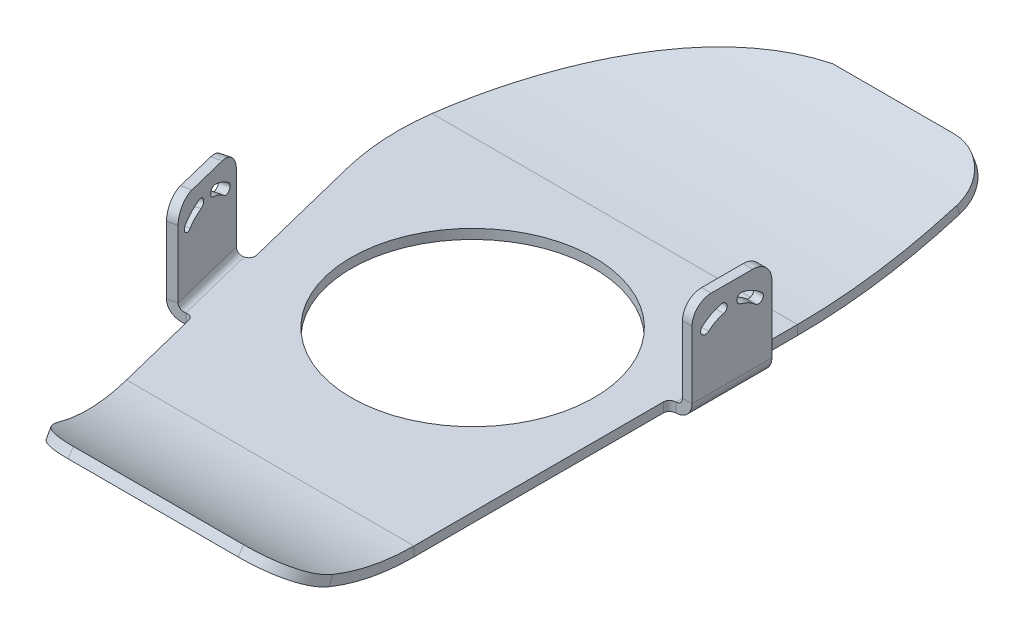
ISO-10303-21;
HEADER;
FILE_DESCRIPTION(('STEP AP214'),'2;1');
FILE_NAME('part.step','',(''),(''),'','','');
FILE_SCHEMA(('AUTOMOTIVE_DESIGN { 1 0 10303 214 1 1 1 1 }'));
ENDSEC;
DATA;
#1=APPLICATION_CONTEXT('core data for automotive mechanical design processes');
#2=APPLICATION_PROTOCOL_DEFINITION('international standard','automotive_design',2000,#1);
#3=PRODUCT_CONTEXT('',#1,'mechanical');
#4=PRODUCT('Part','Part','',(#3));
#5=PRODUCT_RELATED_PRODUCT_CATEGORY('part','',(#4));
#6=PRODUCT_DEFINITION_FORMATION('','',#4);
#7=PRODUCT_DEFINITION_CONTEXT('part definition',#1,'design');
#8=PRODUCT_DEFINITION('design','',#6,#7);
#9=PRODUCT_DEFINITION_SHAPE('','',#8);
#10=(LENGTH_UNIT() NAMED_UNIT(*) SI_UNIT(.MILLI.,.METRE.));
#11=(NAMED_UNIT(*) PLANE_ANGLE_UNIT() SI_UNIT($,.RADIAN.));
#12=(NAMED_UNIT(*) SI_UNIT($,.STERADIAN.) SOLID_ANGLE_UNIT());
#13=UNCERTAINTY_MEASURE_WITH_UNIT(LENGTH_MEASURE(1.E-05),#10,'distance_accuracy_value','');
#14=(GEOMETRIC_REPRESENTATION_CONTEXT(3) GLOBAL_UNCERTAINTY_ASSIGNED_CONTEXT((#13)) GLOBAL_UNIT_ASSIGNED_CONTEXT((#10,
#11,#12)) REPRESENTATION_CONTEXT('',''));
#15=CARTESIAN_POINT('',(0.,0.,0.));
#16=DIRECTION('',(0.,0.,1.));
#17=DIRECTION('',(1.,0.,0.));
#18=AXIS2_PLACEMENT_3D('',#15,#16,#17);
#19=CARTESIAN_POINT('',(-15.715516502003,26.,-94.2899017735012));
#20=DIRECTION('',(-0.97047368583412,0.,0.241207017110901));
#21=DIRECTION('',(-0.23408506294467,-0.241207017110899,-0.941819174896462));
#22=AXIS2_PLACEMENT_3D('',#19,#20,#21);
#23=CYLINDRICAL_SURFACE('',#22,6.);
#24=CARTESIAN_POINT('',(-102.213628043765,26.,-72.7911720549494));
#25=DIRECTION('',(0.97047368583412,0.,-0.241207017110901));
#26=DIRECTION('',(0.23408506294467,0.241207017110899,0.941819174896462));
#27=AXIS2_PLACEMENT_3D('',#24,#25,#26);
#28=CIRCLE('',#27,6.);
#29=CARTESIAN_POINT('',(-102.213628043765,32.,-72.7911720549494));
#30=VERTEX_POINT('',#29);
#31=CARTESIAN_POINT('',(-100.7663859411,26.,-66.9683299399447));
#32=VERTEX_POINT('',#31);
#33=EDGE_CURVE('E618',#30,#32,#28,.T.);
#34=ORIENTED_EDGE('',*,*,#33,.F.);
#35=DIRECTION('',(-0.97047368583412,0.,0.241207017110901));
#36=VECTOR('',#35,1.);
#37=CARTESIAN_POINT('',(-15.715516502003,32.,-94.2899017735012));
#38=LINE('',#37,#36);
#39=CARTESIAN_POINT('',(-105.125049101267,32.,-72.0675510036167));
#40=VERTEX_POINT('',#39);
#41=EDGE_CURVE('E151',#40,#30,#38,.F.);
#42=ORIENTED_EDGE('',*,*,#41,.F.);
#43=CARTESIAN_POINT('',(-105.125049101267,26.,-72.0675510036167));
#44=DIRECTION('',(0.97047368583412,0.,-0.241207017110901));
#45=DIRECTION('',(0.23408506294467,0.241207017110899,0.941819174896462));
#46=AXIS2_PLACEMENT_3D('',#43,#44,#45);
#47=CIRCLE('',#46,6.);
#48=CARTESIAN_POINT('',(-103.677806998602,26.,-66.244708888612));
#49=VERTEX_POINT('',#48);
#50=EDGE_CURVE('E157',#49,#40,#47,.F.);
#51=ORIENTED_EDGE('',*,*,#50,.F.);
#52=DIRECTION('',(-0.97047368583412,0.,0.241207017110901));
#53=VECTOR('',#52,1.);
#54=CARTESIAN_POINT('',(-14.2682743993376,26.,-88.4670596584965));
#55=LINE('',#54,#53);
#56=EDGE_CURVE('E622',#32,#49,#55,.T.);
#57=ORIENTED_EDGE('',*,*,#56,.F.);
#58=EDGE_LOOP('',(#34,#42,#51,#57));
#59=FACE_BOUND('',#58,.T.);
#60=ADVANCED_FACE('F59',(#59),#23,.T.);
#61=CARTESIAN_POINT('',(-20.2984498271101,32.0000000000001,-112.728901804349));
#62=DIRECTION('',(0.,1.,0.));
#63=DIRECTION('',(0.241207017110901,0.,0.97047368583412));
#64=AXIS2_PLACEMENT_3D('',#61,#62,#63);
#65=PLANE('',#64);
#66=DIRECTION('',(-0.241207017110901,0.,-0.97047368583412));
#67=VECTOR('',#66,1.);
#68=CARTESIAN_POINT('',(-106.796561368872,32.0000000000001,-91.2301720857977));
#69=LINE('',#68,#67);
#70=CARTESIAN_POINT('',(-105.349319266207,32.,-85.407329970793));
#71=VERTEX_POINT('',#70);
#72=EDGE_CURVE('E488',#30,#71,#69,.T.);
#73=ORIENTED_EDGE('',*,*,#72,.T.);
#74=DIRECTION('',(-0.97047368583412,0.,0.241207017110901));
#75=VECTOR('',#74,1.);
#76=CARTESIAN_POINT('',(-18.8512077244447,32.,-106.906059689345));
#77=LINE('',#76,#75);
#78=CARTESIAN_POINT('',(-108.260740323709,32.,-84.6837089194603));
#79=VERTEX_POINT('',#78);
#80=EDGE_CURVE('E485',#71,#79,#77,.T.);
#81=ORIENTED_EDGE('',*,*,#80,.T.);
#82=DIRECTION('',(-0.241207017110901,0.,-0.97047368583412));
#83=VECTOR('',#82,1.);
#84=CARTESIAN_POINT('',(-109.707982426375,32.0000000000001,-90.506551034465));
#85=LINE('',#84,#83);
#86=EDGE_CURVE('E433',#40,#79,#85,.T.);
#87=ORIENTED_EDGE('',*,*,#86,.F.);
#88=ORIENTED_EDGE('',*,*,#41,.T.);
#89=EDGE_LOOP('',(#73,#81,#87,#88));
#90=FACE_BOUND('',#89,.T.);
#91=ADVANCED_FACE('F636',(#90),#65,.T.);
#92=CARTESIAN_POINT('',(36.7131452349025,23.2041740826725,-105.456985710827));
#93=DIRECTION('',(-0.97047368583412,0.,0.241207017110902));
#94=DIRECTION('',(0.241207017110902,0.,0.97047368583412));
#95=AXIS2_PLACEMENT_3D('',#92,#93,#94);
#96=CYLINDRICAL_SURFACE('',#95,1.49999999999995);
#97=DIRECTION('',(-0.97047368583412,0.,0.241207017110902));
#98=VECTOR('',#97,1.);
#99=CARTESIAN_POINT('',(36.47264833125,22.0835138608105,-106.42460232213));
#100=LINE('',#99,#98);
#101=CARTESIAN_POINT('',(-102.017829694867,22.0835138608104,-72.0033958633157));
#102=VERTEX_POINT('',#101);
#103=CARTESIAN_POINT('',(-104.92925075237,22.0835138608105,-71.2797748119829));
#104=VERTEX_POINT('',#103);
#105=EDGE_CURVE('E481',#102,#104,#100,.T.);
#106=ORIENTED_EDGE('',*,*,#105,.T.);
#107=CARTESIAN_POINT('',(-104.688753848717,23.2041740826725,-70.3121582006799));
#108=DIRECTION('',(-0.97047368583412,0.,0.241207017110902));
#109=DIRECTION('',(-0.241207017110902,0.,-0.97047368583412));
#110=AXIS2_PLACEMENT_3D('',#107,#108,#109);
#111=CIRCLE('',#110,1.49999999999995);
#112=CARTESIAN_POINT('',(-104.448256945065,24.3248343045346,-69.344541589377));
#113=VERTEX_POINT('',#112);
#114=EDGE_CURVE('E478',#104,#113,#111,.T.);
#115=ORIENTED_EDGE('',*,*,#114,.T.);
#116=DIRECTION('',(-0.97047368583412,0.,0.241207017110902));
#117=VECTOR('',#116,1.);
#118=CARTESIAN_POINT('',(36.953642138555,24.3248343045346,-104.489369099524));
#119=LINE('',#118,#117);
#120=CARTESIAN_POINT('',(-101.536835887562,24.3248343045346,-70.0681626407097));
#121=VERTEX_POINT('',#120);
#122=EDGE_CURVE('E475',#121,#113,#119,.T.);
#123=ORIENTED_EDGE('',*,*,#122,.F.);
#124=CARTESIAN_POINT('',(-101.777332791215,23.2041740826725,-71.0357792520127));
#125=DIRECTION('',(0.97047368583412,0.,-0.241207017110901));
#126=DIRECTION('',(-0.241207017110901,0.,-0.97047368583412));
#127=AXIS2_PLACEMENT_3D('',#124,#125,#126);
#128=CIRCLE('',#127,1.49999999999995);
#129=EDGE_CURVE('E69',#102,#121,#128,.F.);
#130=ORIENTED_EDGE('',*,*,#129,.F.);
#131=EDGE_LOOP('',(#106,#115,#123,#130));
#132=FACE_BOUND('',#131,.T.);
#133=ADVANCED_FACE('F655',(#132),#96,.F.);
#134=CARTESIAN_POINT('',(34.7090043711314,13.8653389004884,-113.520457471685));
#135=DIRECTION('',(-0.97047368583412,0.,0.241207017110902));
#136=DIRECTION('',(0.241207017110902,0.,0.97047368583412));
#137=AXIS2_PLACEMENT_3D('',#134,#135,#136);
#138=CYLINDRICAL_SURFACE('',#137,13.9999999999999);
#139=ORIENTED_EDGE('',*,*,#122,.T.);
#140=CARTESIAN_POINT('',(-106.692894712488,13.8653389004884,-78.3756299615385));
#141=DIRECTION('',(-0.97047368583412,0.,0.241207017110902));
#142=DIRECTION('',(-0.241207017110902,0.,-0.97047368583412));
#143=AXIS2_PLACEMENT_3D('',#140,#141,#142);
#144=CIRCLE('',#143,13.9999999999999);
#145=CARTESIAN_POINT('',(-105.882439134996,27.4561593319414,-75.1148383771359));
#146=VERTEX_POINT('',#145);
#147=EDGE_CURVE('E472',#113,#146,#144,.T.);
#148=ORIENTED_EDGE('',*,*,#147,.T.);
#149=DIRECTION('',(-0.97047368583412,0.,0.241207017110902));
#150=VECTOR('',#149,1.);
#151=CARTESIAN_POINT('',(35.5194599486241,27.4561593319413,-110.259665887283));
#152=LINE('',#151,#150);
#153=CARTESIAN_POINT('',(-102.971018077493,27.4561593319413,-75.8384594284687));
#154=VERTEX_POINT('',#153);
#155=EDGE_CURVE('E469',#154,#146,#152,.T.);
#156=ORIENTED_EDGE('',*,*,#155,.F.);
#157=CARTESIAN_POINT('',(-103.781473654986,13.8653389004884,-79.0992510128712));
#158=DIRECTION('',(0.97047368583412,0.,-0.241207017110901));
#159=DIRECTION('',(-0.241207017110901,0.,-0.97047368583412));
#160=AXIS2_PLACEMENT_3D('',#157,#158,#159);
#161=CIRCLE('',#160,13.9999999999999);
#162=EDGE_CURVE('E14',#121,#154,#161,.F.);
#163=ORIENTED_EDGE('',*,*,#162,.F.);
#164=EDGE_LOOP('',(#139,#148,#156,#163));
#165=FACE_BOUND('',#164,.T.);
#166=ADVANCED_FACE('F663',(#165),#138,.F.);
#167=CARTESIAN_POINT('',(35.4326254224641,26.,-110.609036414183));
#168=DIRECTION('',(-0.97047368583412,0.,0.241207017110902));
#169=DIRECTION('',(0.241207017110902,0.,0.97047368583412));
#170=AXIS2_PLACEMENT_3D('',#167,#168,#169);
#171=CYLINDRICAL_SURFACE('',#170,1.49999999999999);
#172=ORIENTED_EDGE('',*,*,#155,.T.);
#173=CARTESIAN_POINT('',(-105.969273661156,26.,-75.4642089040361));
#174=DIRECTION('',(-0.97047368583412,0.,0.241207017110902));
#175=DIRECTION('',(-0.241207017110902,0.,-0.97047368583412));
#176=AXIS2_PLACEMENT_3D('',#173,#174,#175);
#177=CIRCLE('',#176,1.49999999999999);
#178=CARTESIAN_POINT('',(-106.056108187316,24.5438406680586,-75.8135794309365));
#179=VERTEX_POINT('',#178);
#180=EDGE_CURVE('E466',#146,#179,#177,.T.);
#181=ORIENTED_EDGE('',*,*,#180,.T.);
#182=DIRECTION('',(-0.97047368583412,0.,0.241207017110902));
#183=VECTOR('',#182,1.);
#184=CARTESIAN_POINT('',(35.3457908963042,24.5438406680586,-110.958406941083));
#185=LINE('',#184,#183);
#186=CARTESIAN_POINT('',(-103.144687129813,24.5438406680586,-76.5372004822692));
#187=VERTEX_POINT('',#186);
#188=EDGE_CURVE('E463',#187,#179,#185,.T.);
#189=ORIENTED_EDGE('',*,*,#188,.F.);
#190=CARTESIAN_POINT('',(-103.057852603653,26.,-76.1878299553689));
#191=DIRECTION('',(0.97047368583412,0.,-0.241207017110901));
#192=DIRECTION('',(-0.241207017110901,0.,-0.97047368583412));
#193=AXIS2_PLACEMENT_3D('',#190,#191,#192);
#194=CIRCLE('',#193,1.49999999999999);
#195=EDGE_CURVE('E607',#154,#187,#194,.F.);
#196=ORIENTED_EDGE('',*,*,#195,.F.);
#197=EDGE_LOOP('',(#172,#181,#189,#196));
#198=FACE_BOUND('',#197,.T.);
#199=ADVANCED_FACE('F667',(#198),#171,.F.);
#200=CARTESIAN_POINT('',(34.7090043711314,13.8653389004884,-113.520457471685));
#201=DIRECTION('',(-0.97047368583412,0.,0.241207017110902));
#202=DIRECTION('',(0.241207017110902,0.,0.97047368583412));
#203=AXIS2_PLACEMENT_3D('',#200,#201,#202);
#204=CYLINDRICAL_SURFACE('',#203,11.);
#205=ORIENTED_EDGE('',*,*,#188,.T.);
#206=CARTESIAN_POINT('',(-106.692894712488,13.8653389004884,-78.3756299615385));
#207=DIRECTION('',(0.97047368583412,0.,-0.241207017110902));
#208=DIRECTION('',(-0.241207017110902,0.,-0.97047368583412));
#209=AXIS2_PLACEMENT_3D('',#206,#207,#208);
#210=CIRCLE('',#209,11.);
#211=EDGE_CURVE('E461',#179,#104,#210,.T.);
#212=ORIENTED_EDGE('',*,*,#211,.T.);
#213=ORIENTED_EDGE('',*,*,#105,.F.);
#214=CARTESIAN_POINT('',(-103.781473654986,13.8653389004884,-79.0992510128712));
#215=DIRECTION('',(0.97047368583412,0.,-0.241207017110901));
#216=DIRECTION('',(-0.241207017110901,0.,-0.97047368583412));
#217=AXIS2_PLACEMENT_3D('',#214,#215,#216);
#218=CIRCLE('',#217,11.);
#219=EDGE_CURVE('E605',#187,#102,#218,.T.);
#220=ORIENTED_EDGE('',*,*,#219,.F.);
#221=EDGE_LOOP('',(#205,#212,#213,#220));
#222=FACE_BOUND('',#221,.T.);
#223=ADVANCED_FACE('F671',(#222),#204,.T.);
#224=CARTESIAN_POINT('',(34.7090043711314,13.8653389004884,-113.520457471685));
#225=DIRECTION('',(-0.97047368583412,0.,0.241207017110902));
#226=DIRECTION('',(0.241207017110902,0.,0.97047368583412));
#227=AXIS2_PLACEMENT_3D('',#224,#225,#226);
#228=CYLINDRICAL_SURFACE('',#227,11.);
#229=DIRECTION('',(-0.97047368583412,0.,0.241207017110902));
#230=VECTOR('',#229,1.);
#231=CARTESIAN_POINT('',(32.9453604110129,22.0835138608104,-120.616312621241));
#232=LINE('',#231,#230);
#233=CARTESIAN_POINT('',(-105.545117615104,22.0835138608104,-86.1951061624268));
#234=VERTEX_POINT('',#233);
#235=CARTESIAN_POINT('',(-108.456538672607,22.0835138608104,-85.4714851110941));
#236=VERTEX_POINT('',#235);
#237=EDGE_CURVE('E459',#234,#236,#232,.T.);
#238=ORIENTED_EDGE('',*,*,#237,.T.);
#239=CARTESIAN_POINT('',(-106.692894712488,13.8653389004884,-78.3756299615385));
#240=DIRECTION('',(0.97047368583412,0.,-0.241207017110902));
#241=DIRECTION('',(0.241207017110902,0.,0.97047368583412));
#242=AXIS2_PLACEMENT_3D('',#239,#240,#241);
#243=CIRCLE('',#242,11.);
#244=CARTESIAN_POINT('',(-107.329681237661,24.5438406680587,-80.9376804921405));
#245=VERTEX_POINT('',#244);
#246=EDGE_CURVE('E456',#236,#245,#243,.T.);
#247=ORIENTED_EDGE('',*,*,#246,.T.);
#248=DIRECTION('',(-0.97047368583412,0.,0.241207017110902));
#249=VECTOR('',#248,1.);
#250=CARTESIAN_POINT('',(34.0722178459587,24.5438406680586,-116.082508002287));
#251=LINE('',#250,#249);
#252=CARTESIAN_POINT('',(-104.418260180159,24.5438406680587,-81.6613015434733));
#253=VERTEX_POINT('',#252);
#254=EDGE_CURVE('E454',#253,#245,#251,.T.);
#255=ORIENTED_EDGE('',*,*,#254,.F.);
#256=CARTESIAN_POINT('',(-103.781473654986,13.8653389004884,-79.0992510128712));
#257=DIRECTION('',(0.97047368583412,0.,-0.241207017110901));
#258=DIRECTION('',(-0.241207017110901,0.,-0.97047368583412));
#259=AXIS2_PLACEMENT_3D('',#256,#257,#258);
#260=CIRCLE('',#259,11.);
#261=EDGE_CURVE('E612',#234,#253,#260,.T.);
#262=ORIENTED_EDGE('',*,*,#261,.F.);
#263=EDGE_LOOP('',(#238,#247,#255,#262));
#264=FACE_BOUND('',#263,.T.);
#265=ADVANCED_FACE('F675',(#264),#228,.T.);
#266=CARTESIAN_POINT('',(33.9853833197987,26.,-116.431878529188));
#267=DIRECTION('',(-0.97047368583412,0.,0.241207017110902));
#268=DIRECTION('',(0.241207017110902,0.,0.97047368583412));
#269=AXIS2_PLACEMENT_3D('',#266,#267,#268);
#270=CYLINDRICAL_SURFACE('',#269,1.49999999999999);
#271=ORIENTED_EDGE('',*,*,#254,.T.);
#272=CARTESIAN_POINT('',(-107.416515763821,26.,-81.2870510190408));
#273=DIRECTION('',(-0.97047368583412,0.,0.241207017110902));
#274=DIRECTION('',(0.241207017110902,0.,0.97047368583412));
#275=AXIS2_PLACEMENT_3D('',#272,#273,#274);
#276=CIRCLE('',#275,1.49999999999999);
#277=CARTESIAN_POINT('',(-107.503350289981,27.4561593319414,-81.6364215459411));
#278=VERTEX_POINT('',#277);
#279=EDGE_CURVE('E451',#245,#278,#276,.T.);
#280=ORIENTED_EDGE('',*,*,#279,.T.);
#281=DIRECTION('',(-0.97047368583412,0.,0.241207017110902));
#282=VECTOR('',#281,1.);
#283=CARTESIAN_POINT('',(33.8985487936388,27.4561593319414,-116.781249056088));
#284=LINE('',#283,#282);
#285=CARTESIAN_POINT('',(-104.591929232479,27.4561593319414,-82.3600425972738));
#286=VERTEX_POINT('',#285);
#287=EDGE_CURVE('E449',#286,#278,#284,.T.);
#288=ORIENTED_EDGE('',*,*,#287,.F.);
#289=CARTESIAN_POINT('',(-104.505094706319,26.,-82.0106720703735));
#290=DIRECTION('',(0.97047368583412,0.,-0.241207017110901));
#291=DIRECTION('',(-0.241207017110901,0.,-0.97047368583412));
#292=AXIS2_PLACEMENT_3D('',#289,#290,#291);
#293=CIRCLE('',#292,1.49999999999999);
#294=EDGE_CURVE('E609',#253,#286,#293,.F.);
#295=ORIENTED_EDGE('',*,*,#294,.F.);
#296=EDGE_LOOP('',(#271,#280,#288,#295));
#297=FACE_BOUND('',#296,.T.);
#298=ADVANCED_FACE('F679',(#297),#270,.F.);
#299=CARTESIAN_POINT('',(34.7090043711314,13.8653389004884,-113.520457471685));
#300=DIRECTION('',(-0.97047368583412,0.,0.241207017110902));
#301=DIRECTION('',(0.241207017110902,0.,0.97047368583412));
#302=AXIS2_PLACEMENT_3D('',#299,#300,#301);
#303=CYLINDRICAL_SURFACE('',#302,14.);
#304=ORIENTED_EDGE('',*,*,#287,.T.);
#305=CARTESIAN_POINT('',(-106.692894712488,13.8653389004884,-78.3756299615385));
#306=DIRECTION('',(-0.97047368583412,0.,0.241207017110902));
#307=DIRECTION('',(0.241207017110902,0.,0.97047368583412));
#308=AXIS2_PLACEMENT_3D('',#305,#306,#307);
#309=CIRCLE('',#308,14.);
#310=CARTESIAN_POINT('',(-108.937532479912,24.3248343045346,-87.4067183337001));
#311=VERTEX_POINT('',#310);
#312=EDGE_CURVE('E447',#278,#311,#309,.T.);
#313=ORIENTED_EDGE('',*,*,#312,.T.);
#314=DIRECTION('',(-0.97047368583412,0.,0.241207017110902));
#315=VECTOR('',#314,1.);
#316=CARTESIAN_POINT('',(32.4643666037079,24.3248343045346,-122.551545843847));
#317=LINE('',#316,#315);
#318=CARTESIAN_POINT('',(-106.02611142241,24.3248343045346,-88.1303393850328));
#319=VERTEX_POINT('',#318);
#320=EDGE_CURVE('E444',#319,#311,#317,.T.);
#321=ORIENTED_EDGE('',*,*,#320,.F.);
#322=CARTESIAN_POINT('',(-103.781473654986,13.8653389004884,-79.0992510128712));
#323=DIRECTION('',(0.97047368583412,0.,-0.241207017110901));
#324=DIRECTION('',(-0.241207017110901,0.,-0.97047368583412));
#325=AXIS2_PLACEMENT_3D('',#322,#323,#324);
#326=CIRCLE('',#325,14.);
#327=EDGE_CURVE('E616',#286,#319,#326,.F.);
#328=ORIENTED_EDGE('',*,*,#327,.F.);
#329=EDGE_LOOP('',(#304,#313,#321,#328));
#330=FACE_BOUND('',#329,.T.);
#331=ADVANCED_FACE('F647',(#330),#303,.F.);
#332=CARTESIAN_POINT('',(32.7048635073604,23.2041740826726,-121.583929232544));
#333=DIRECTION('',(-0.97047368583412,0.,0.241207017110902));
#334=DIRECTION('',(0.241207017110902,0.,0.97047368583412));
#335=AXIS2_PLACEMENT_3D('',#332,#333,#334);
#336=CYLINDRICAL_SURFACE('',#335,1.49999999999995);
#337=ORIENTED_EDGE('',*,*,#320,.T.);
#338=CARTESIAN_POINT('',(-108.697035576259,23.2041740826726,-86.439101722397));
#339=DIRECTION('',(-0.97047368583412,0.,0.241207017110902));
#340=DIRECTION('',(0.241207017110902,0.,0.97047368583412));
#341=AXIS2_PLACEMENT_3D('',#338,#339,#340);
#342=CIRCLE('',#341,1.49999999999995);
#343=EDGE_CURVE('E441',#311,#236,#342,.T.);
#344=ORIENTED_EDGE('',*,*,#343,.T.);
#345=ORIENTED_EDGE('',*,*,#237,.F.);
#346=CARTESIAN_POINT('',(-105.785614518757,23.2041740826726,-87.1627227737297));
#347=DIRECTION('',(0.97047368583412,0.,-0.241207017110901));
#348=DIRECTION('',(-0.241207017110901,0.,-0.97047368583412));
#349=AXIS2_PLACEMENT_3D('',#346,#347,#348);
#350=CIRCLE('',#349,1.49999999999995);
#351=EDGE_CURVE('E614',#319,#234,#350,.F.);
#352=ORIENTED_EDGE('',*,*,#351,.F.);
#353=EDGE_LOOP('',(#337,#344,#345,#352));
#354=FACE_BOUND('',#353,.T.);
#355=ADVANCED_FACE('F640',(#354),#336,.F.);
#356=CARTESIAN_POINT('',(-18.8512077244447,26.,-106.906059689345));
#357=DIRECTION('',(-0.97047368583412,0.,0.241207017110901));
#358=DIRECTION('',(-0.23408506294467,-0.241207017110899,-0.941819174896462));
#359=AXIS2_PLACEMENT_3D('',#356,#357,#358);
#360=CYLINDRICAL_SURFACE('',#359,6.);
#361=CARTESIAN_POINT('',(-105.349319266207,26.,-85.407329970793));
#362=DIRECTION('',(0.97047368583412,0.,-0.241207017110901));
#363=DIRECTION('',(0.23408506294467,0.241207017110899,0.941819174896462));
#364=AXIS2_PLACEMENT_3D('',#361,#362,#363);
#365=CIRCLE('',#364,6.);
#366=CARTESIAN_POINT('',(-106.796561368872,26.,-91.2301720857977));
#367=VERTEX_POINT('',#366);
#368=EDGE_CURVE('E620',#367,#71,#365,.T.);
#369=ORIENTED_EDGE('',*,*,#368,.F.);
#370=DIRECTION('',(-0.97047368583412,0.,0.241207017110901));
#371=VECTOR('',#370,1.);
#372=CARTESIAN_POINT('',(-20.2984498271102,26.,-112.728901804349));
#373=LINE('',#372,#371);
#374=CARTESIAN_POINT('',(-109.707982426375,26.,-90.506551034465));
#375=VERTEX_POINT('',#374);
#376=EDGE_CURVE('E436',#375,#367,#373,.F.);
#377=ORIENTED_EDGE('',*,*,#376,.F.);
#378=CARTESIAN_POINT('',(-108.260740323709,26.,-84.6837089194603));
#379=DIRECTION('',(0.97047368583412,0.,-0.241207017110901));
#380=DIRECTION('',(0.23408506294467,0.241207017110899,0.941819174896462));
#381=AXIS2_PLACEMENT_3D('',#378,#379,#380);
#382=CIRCLE('',#381,6.);
#383=EDGE_CURVE('E424',#79,#375,#382,.F.);
#384=ORIENTED_EDGE('',*,*,#383,.F.);
#385=ORIENTED_EDGE('',*,*,#80,.F.);
#386=EDGE_LOOP('',(#369,#377,#384,#385));
#387=FACE_BOUND('',#386,.T.);
#388=ADVANCED_FACE('F638',(#387),#360,.T.);
#389=CARTESIAN_POINT('',(-20.2984498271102,0.,-112.72890180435));
#390=DIRECTION('',(-0.241207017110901,0.,-0.97047368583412));
#391=DIRECTION('',(0.,1.,0.));
#392=AXIS2_PLACEMENT_3D('',#389,#390,#391);
#393=PLANE('',#392);
#394=DIRECTION('',(0.,-1.,0.));
#395=VECTOR('',#394,1.);
#396=CARTESIAN_POINT('',(-109.707982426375,0.,-90.5065510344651));
#397=LINE('',#396,#395);
#398=CARTESIAN_POINT('',(-109.707982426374,5.00000000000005,-90.5065510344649));
#399=VERTEX_POINT('',#398);
#400=EDGE_CURVE('E410',#375,#399,#397,.T.);
#401=ORIENTED_EDGE('',*,*,#400,.F.);
#402=ORIENTED_EDGE('',*,*,#376,.T.);
#403=DIRECTION('',(0.,-1.,0.));
#404=VECTOR('',#403,1.);
#405=CARTESIAN_POINT('',(-106.796561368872,0.,-91.2301720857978));
#406=LINE('',#405,#404);
#407=CARTESIAN_POINT('',(-106.796561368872,5.00000000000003,-91.2301720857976));
#408=VERTEX_POINT('',#407);
#409=EDGE_CURVE('E431',#367,#408,#406,.T.);
#410=ORIENTED_EDGE('',*,*,#409,.T.);
#411=DIRECTION('',(-0.97047368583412,0.,0.241207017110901));
#412=VECTOR('',#411,1.);
#413=CARTESIAN_POINT('',(-20.2984498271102,5.00000000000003,-112.72890180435));
#414=LINE('',#413,#412);
#415=EDGE_CURVE('E415',#408,#399,#414,.T.);
#416=ORIENTED_EDGE('',*,*,#415,.T.);
#417=EDGE_LOOP('',(#401,#402,#410,#416));
#418=FACE_BOUND('',#417,.T.);
#419=ADVANCED_FACE('F429',(#418),#393,.T.);
#420=CARTESIAN_POINT('',(-109.707982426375,32.0000000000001,-90.506551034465));
#421=DIRECTION('',(0.97047368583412,0.,-0.241207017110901));
#422=DIRECTION('',(-0.241207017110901,0.,-0.97047368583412));
#423=AXIS2_PLACEMENT_3D('',#420,#421,#422);
#424=PLANE('',#423);
#425=ORIENTED_EDGE('',*,*,#343,.F.);
#426=ORIENTED_EDGE('',*,*,#312,.F.);
#427=ORIENTED_EDGE('',*,*,#279,.F.);
#428=ORIENTED_EDGE('',*,*,#246,.F.);
#429=EDGE_LOOP('',(#425,#426,#427,#428));
#430=FACE_BOUND('',#429,.T.);
#431=ORIENTED_EDGE('',*,*,#211,.F.);
#432=ORIENTED_EDGE('',*,*,#180,.F.);
#433=ORIENTED_EDGE('',*,*,#147,.F.);
#434=ORIENTED_EDGE('',*,*,#114,.F.);
#435=EDGE_LOOP('',(#431,#432,#433,#434));
#436=FACE_BOUND('',#435,.T.);
#437=ORIENTED_EDGE('',*,*,#86,.T.);
#438=ORIENTED_EDGE('',*,*,#383,.T.);
#439=ORIENTED_EDGE('',*,*,#400,.T.);
#440=DIRECTION('',(0.241207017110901,0.,0.97047368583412));
#441=VECTOR('',#440,1.);
#442=CARTESIAN_POINT('',(-109.707982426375,5.00000000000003,-90.5065510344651));
#443=LINE('',#442,#441);
#444=CARTESIAN_POINT('',(-103.677806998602,4.99999999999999,-66.244708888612));
#445=VERTEX_POINT('',#444);
#446=EDGE_CURVE('E397',#399,#445,#443,.T.);
#447=ORIENTED_EDGE('',*,*,#446,.T.);
#448=DIRECTION('',(0.,1.,0.));
#449=VECTOR('',#448,1.);
#450=CARTESIAN_POINT('',(-103.677806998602,0.,-66.244708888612));
#451=LINE('',#450,#449);
#452=EDGE_CURVE('E409',#445,#49,#451,.T.);
#453=ORIENTED_EDGE('',*,*,#452,.T.);
#454=ORIENTED_EDGE('',*,*,#50,.T.);
#455=EDGE_LOOP('',(#437,#438,#439,#447,#453,#454));
#456=FACE_BOUND('',#455,.T.);
#457=ADVANCED_FACE('F423',(#430,#436,#456),#424,.F.);
#458=CARTESIAN_POINT('',(-14.2682743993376,0.,-88.4670596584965));
#459=DIRECTION('',(0.241207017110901,0.,0.97047368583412));
#460=DIRECTION('',(0.,-1.,0.));
#461=AXIS2_PLACEMENT_3D('',#458,#459,#460);
#462=PLANE('',#461);
#463=DIRECTION('',(0.,1.,0.));
#464=VECTOR('',#463,1.);
#465=CARTESIAN_POINT('',(-100.7663859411,0.,-66.9683299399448));
#466=LINE('',#465,#464);
#467=CARTESIAN_POINT('',(-100.7663859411,5.00000000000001,-66.9683299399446));
#468=VERTEX_POINT('',#467);
#469=EDGE_CURVE('E624',#468,#32,#466,.T.);
#470=ORIENTED_EDGE('',*,*,#469,.T.);
#471=ORIENTED_EDGE('',*,*,#56,.T.);
#472=ORIENTED_EDGE('',*,*,#452,.F.);
#473=DIRECTION('',(-0.97047368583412,0.,0.241207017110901));
#474=VECTOR('',#473,1.);
#475=CARTESIAN_POINT('',(-14.2682743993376,4.99999999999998,-88.4670596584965));
#476=LINE('',#475,#474);
#477=EDGE_CURVE('E489',#468,#445,#476,.T.);
#478=ORIENTED_EDGE('',*,*,#477,.F.);
#479=EDGE_LOOP('',(#470,#471,#472,#478));
#480=FACE_BOUND('',#479,.T.);
#481=ADVANCED_FACE('F629',(#480),#462,.T.);
#482=CARTESIAN_POINT('',(-106.796561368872,32.0000000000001,-91.2301720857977));
#483=DIRECTION('',(0.97047368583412,0.,-0.241207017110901));
#484=DIRECTION('',(-0.241207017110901,0.,-0.97047368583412));
#485=AXIS2_PLACEMENT_3D('',#482,#483,#484);
#486=PLANE('',#485);
#487=ORIENTED_EDGE('',*,*,#409,.F.);
#488=ORIENTED_EDGE('',*,*,#368,.T.);
#489=ORIENTED_EDGE('',*,*,#72,.F.);
#490=ORIENTED_EDGE('',*,*,#33,.T.);
#491=ORIENTED_EDGE('',*,*,#469,.F.);
#492=DIRECTION('',(0.241207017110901,0.,0.97047368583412));
#493=VECTOR('',#492,1.);
#494=CARTESIAN_POINT('',(-106.796561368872,5.00000000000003,-91.2301720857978));
#495=LINE('',#494,#493);
#496=EDGE_CURVE('E63',#408,#468,#495,.T.);
#497=ORIENTED_EDGE('',*,*,#496,.F.);
#498=EDGE_LOOP('',(#487,#488,#489,#490,#491,#497));
#499=FACE_BOUND('',#498,.T.);
#500=ORIENTED_EDGE('',*,*,#327,.T.);
#501=ORIENTED_EDGE('',*,*,#351,.T.);
#502=ORIENTED_EDGE('',*,*,#261,.T.);
#503=ORIENTED_EDGE('',*,*,#294,.T.);
#504=EDGE_LOOP('',(#500,#501,#502,#503));
#505=FACE_BOUND('',#504,.T.);
#506=ORIENTED_EDGE('',*,*,#195,.T.);
#507=ORIENTED_EDGE('',*,*,#219,.T.);
#508=ORIENTED_EDGE('',*,*,#129,.T.);
#509=ORIENTED_EDGE('',*,*,#162,.T.);
#510=EDGE_LOOP('',(#506,#507,#508,#509));
#511=FACE_BOUND('',#510,.T.);
#512=ADVANCED_FACE('F61',(#499,#505,#511),#486,.T.);
#513=CARTESIAN_POINT('',(-69.5934779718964,32.,-120.));
#514=DIRECTION('',(0.,1.,0.));
#515=DIRECTION('',(0.,0.,-1.));
#516=AXIS2_PLACEMENT_3D('',#513,#514,#515);
#517=PLANE('',#516);
#518=DIRECTION('',(0.,0.,1.));
#519=VECTOR('',#518,1.);
#520=CARTESIAN_POINT('',(7.,32.,-120.));
#521=LINE('',#520,#519);
#522=CARTESIAN_POINT('',(7.,32.,-139.));
#523=VERTEX_POINT('',#522);
#524=CARTESIAN_POINT('',(7.,32.,-126.));
#525=VERTEX_POINT('',#524);
#526=EDGE_CURVE('E533',#523,#525,#521,.T.);
#527=ORIENTED_EDGE('',*,*,#526,.F.);
#528=DIRECTION('',(1.,0.,0.));
#529=VECTOR('',#528,1.);
#530=CARTESIAN_POINT('',(-69.5934779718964,32.,-139.));
#531=LINE('',#530,#529);
#532=CARTESIAN_POINT('',(4.,32.,-139.));
#533=VERTEX_POINT('',#532);
#534=EDGE_CURVE('E246',#523,#533,#531,.F.);
#535=ORIENTED_EDGE('',*,*,#534,.T.);
#536=DIRECTION('',(0.,0.,1.));
#537=VECTOR('',#536,1.);
#538=CARTESIAN_POINT('',(3.99999999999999,32.,-120.));
#539=LINE('',#538,#537);
#540=CARTESIAN_POINT('',(4.,32.,-126.));
#541=VERTEX_POINT('',#540);
#542=EDGE_CURVE('E596',#533,#541,#539,.T.);
#543=ORIENTED_EDGE('',*,*,#542,.T.);
#544=DIRECTION('',(1.,0.,0.));
#545=VECTOR('',#544,1.);
#546=CARTESIAN_POINT('',(-69.5934779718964,32.,-126.));
#547=LINE('',#546,#545);
#548=EDGE_CURVE('E593',#541,#525,#547,.T.);
#549=ORIENTED_EDGE('',*,*,#548,.T.);
#550=EDGE_LOOP('',(#527,#535,#543,#549));
#551=FACE_BOUND('',#550,.T.);
#552=ADVANCED_FACE('F702',(#551),#517,.T.);
#553=CARTESIAN_POINT('',(-69.5934779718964,26.,-139.));
#554=DIRECTION('',(1.,0.,0.));
#555=DIRECTION('',(0.,0.,-1.));
#556=AXIS2_PLACEMENT_3D('',#553,#554,#555);
#557=CYLINDRICAL_SURFACE('',#556,6.);
#558=CARTESIAN_POINT('',(3.99999999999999,26.,-139.));
#559=DIRECTION('',(-1.,0.,0.));
#560=DIRECTION('',(0.,0.,1.));
#561=AXIS2_PLACEMENT_3D('',#558,#559,#560);
#562=CIRCLE('',#561,6.);
#563=CARTESIAN_POINT('',(3.99999999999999,26.,-145.));
#564=VERTEX_POINT('',#563);
#565=EDGE_CURVE('E518',#533,#564,#562,.T.);
#566=ORIENTED_EDGE('',*,*,#565,.F.);
#567=ORIENTED_EDGE('',*,*,#534,.F.);
#568=CARTESIAN_POINT('',(6.99999999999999,26.,-139.));
#569=DIRECTION('',(-1.,0.,0.));
#570=DIRECTION('',(0.,0.,1.));
#571=AXIS2_PLACEMENT_3D('',#568,#569,#570);
#572=CIRCLE('',#571,6.);
#573=CARTESIAN_POINT('',(6.99999999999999,26.,-145.));
#574=VERTEX_POINT('',#573);
#575=EDGE_CURVE('E240',#574,#523,#572,.F.);
#576=ORIENTED_EDGE('',*,*,#575,.F.);
#577=DIRECTION('',(1.,0.,0.));
#578=VECTOR('',#577,1.);
#579=CARTESIAN_POINT('',(-69.5934779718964,26.,-145.));
#580=LINE('',#579,#578);
#581=EDGE_CURVE('E520',#564,#574,#580,.T.);
#582=ORIENTED_EDGE('',*,*,#581,.F.);
#583=EDGE_LOOP('',(#566,#567,#576,#582));
#584=FACE_BOUND('',#583,.T.);
#585=ADVANCED_FACE('F726',(#584),#557,.T.);
#586=CARTESIAN_POINT('',(-115.001,23.2041740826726,-140.8088));
#587=DIRECTION('',(1.,0.,0.));
#588=DIRECTION('',(0.,0.,-1.));
#589=AXIS2_PLACEMENT_3D('',#586,#587,#588);
#590=CYLINDRICAL_SURFACE('',#589,1.49999999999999);
#591=DIRECTION('',(1.,0.,0.));
#592=VECTOR('',#591,1.);
#593=CARTESIAN_POINT('',(-115.001,22.0835138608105,-139.811744));
#594=LINE('',#593,#592);
#595=CARTESIAN_POINT('',(4.,22.0835138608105,-139.811744));
#596=VERTEX_POINT('',#595);
#597=CARTESIAN_POINT('',(7.,22.0835138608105,-139.811744));
#598=VERTEX_POINT('',#597);
#599=EDGE_CURVE('E590',#596,#598,#594,.T.);
#600=ORIENTED_EDGE('',*,*,#599,.T.);
#601=CARTESIAN_POINT('',(7.,23.2041740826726,-140.8088));
#602=DIRECTION('',(1.,0.,0.));
#603=DIRECTION('',(0.,0.,1.));
#604=AXIS2_PLACEMENT_3D('',#601,#602,#603);
#605=CIRCLE('',#604,1.49999999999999);
#606=CARTESIAN_POINT('',(7.,24.3248343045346,-141.805856));
#607=VERTEX_POINT('',#606);
#608=EDGE_CURVE('E587',#598,#607,#605,.T.);
#609=ORIENTED_EDGE('',*,*,#608,.T.);
#610=DIRECTION('',(1.,0.,0.));
#611=VECTOR('',#610,1.);
#612=CARTESIAN_POINT('',(-115.001,24.3248343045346,-141.805856));
#613=LINE('',#612,#611);
#614=CARTESIAN_POINT('',(4.,24.3248343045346,-141.805856));
#615=VERTEX_POINT('',#614);
#616=EDGE_CURVE('E584',#615,#607,#613,.T.);
#617=ORIENTED_EDGE('',*,*,#616,.F.);
#618=CARTESIAN_POINT('',(4.,23.2041740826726,-140.8088));
#619=DIRECTION('',(-1.,0.,0.));
#620=DIRECTION('',(0.,0.,1.));
#621=AXIS2_PLACEMENT_3D('',#618,#619,#620);
#622=CIRCLE('',#621,1.49999999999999);
#623=EDGE_CURVE('E166',#596,#615,#622,.F.);
#624=ORIENTED_EDGE('',*,*,#623,.F.);
#625=EDGE_LOOP('',(#600,#609,#617,#624));
#626=FACE_BOUND('',#625,.T.);
#627=ADVANCED_FACE('F733',(#626),#590,.F.);
#628=CARTESIAN_POINT('',(-115.001,13.8653389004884,-132.5));
#629=DIRECTION('',(1.,0.,0.));
#630=DIRECTION('',(0.,0.,-1.));
#631=AXIS2_PLACEMENT_3D('',#628,#629,#630);
#632=CYLINDRICAL_SURFACE('',#631,14.);
#633=ORIENTED_EDGE('',*,*,#616,.T.);
#634=CARTESIAN_POINT('',(7.,13.8653389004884,-132.5));
#635=DIRECTION('',(1.,0.,0.));
#636=DIRECTION('',(0.,0.,1.));
#637=AXIS2_PLACEMENT_3D('',#634,#635,#636);
#638=CIRCLE('',#637,14.);
#639=CARTESIAN_POINT('',(7.,27.4561593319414,-135.86));
#640=VERTEX_POINT('',#639);
#641=EDGE_CURVE('E581',#607,#640,#638,.T.);
#642=ORIENTED_EDGE('',*,*,#641,.T.);
#643=DIRECTION('',(1.,0.,0.));
#644=VECTOR('',#643,1.);
#645=CARTESIAN_POINT('',(-115.001,27.4561593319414,-135.86));
#646=LINE('',#645,#644);
#647=CARTESIAN_POINT('',(4.,27.4561593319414,-135.86));
#648=VERTEX_POINT('',#647);
#649=EDGE_CURVE('E578',#648,#640,#646,.T.);
#650=ORIENTED_EDGE('',*,*,#649,.F.);
#651=CARTESIAN_POINT('',(4.,13.8653389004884,-132.5));
#652=DIRECTION('',(-1.,0.,0.));
#653=DIRECTION('',(0.,0.,1.));
#654=AXIS2_PLACEMENT_3D('',#651,#652,#653);
#655=CIRCLE('',#654,14.);
#656=EDGE_CURVE('E493',#615,#648,#655,.F.);
#657=ORIENTED_EDGE('',*,*,#656,.F.);
#658=EDGE_LOOP('',(#633,#642,#650,#657));
#659=FACE_BOUND('',#658,.T.);
#660=ADVANCED_FACE('F740',(#659),#632,.F.);
#661=CARTESIAN_POINT('',(-115.001,26.,-135.5));
#662=DIRECTION('',(1.,0.,0.));
#663=DIRECTION('',(0.,0.,-1.));
#664=AXIS2_PLACEMENT_3D('',#661,#662,#663);
#665=CYLINDRICAL_SURFACE('',#664,1.5);
#666=ORIENTED_EDGE('',*,*,#649,.T.);
#667=CARTESIAN_POINT('',(7.,26.,-135.5));
#668=DIRECTION('',(1.,0.,0.));
#669=DIRECTION('',(0.,0.,1.));
#670=AXIS2_PLACEMENT_3D('',#667,#668,#669);
#671=CIRCLE('',#670,1.5);
#672=CARTESIAN_POINT('',(7.,24.5438406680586,-135.14));
#673=VERTEX_POINT('',#672);
#674=EDGE_CURVE('E575',#640,#673,#671,.T.);
#675=ORIENTED_EDGE('',*,*,#674,.T.);
#676=DIRECTION('',(1.,0.,0.));
#677=VECTOR('',#676,1.);
#678=CARTESIAN_POINT('',(-115.001,24.5438406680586,-135.14));
#679=LINE('',#678,#677);
#680=CARTESIAN_POINT('',(4.,24.5438406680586,-135.14));
#681=VERTEX_POINT('',#680);
#682=EDGE_CURVE('E572',#681,#673,#679,.T.);
#683=ORIENTED_EDGE('',*,*,#682,.F.);
#684=CARTESIAN_POINT('',(4.,26.,-135.5));
#685=DIRECTION('',(-1.,0.,0.));
#686=DIRECTION('',(0.,0.,1.));
#687=AXIS2_PLACEMENT_3D('',#684,#685,#686);
#688=CIRCLE('',#687,1.5);
#689=EDGE_CURVE('E505',#648,#681,#688,.F.);
#690=ORIENTED_EDGE('',*,*,#689,.F.);
#691=EDGE_LOOP('',(#666,#675,#683,#690));
#692=FACE_BOUND('',#691,.T.);
#693=ADVANCED_FACE('F748',(#692),#665,.F.);
#694=CARTESIAN_POINT('',(-115.001,13.8653389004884,-132.5));
#695=DIRECTION('',(1.,0.,0.));
#696=DIRECTION('',(0.,0.,-1.));
#697=AXIS2_PLACEMENT_3D('',#694,#695,#696);
#698=CYLINDRICAL_SURFACE('',#697,11.);
#699=ORIENTED_EDGE('',*,*,#682,.T.);
#700=CARTESIAN_POINT('',(7.,13.8653389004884,-132.5));
#701=DIRECTION('',(-1.,0.,0.));
#702=DIRECTION('',(0.,0.,1.));
#703=AXIS2_PLACEMENT_3D('',#700,#701,#702);
#704=CIRCLE('',#703,11.);
#705=EDGE_CURVE('E570',#673,#598,#704,.T.);
#706=ORIENTED_EDGE('',*,*,#705,.T.);
#707=ORIENTED_EDGE('',*,*,#599,.F.);
#708=CARTESIAN_POINT('',(4.,13.8653389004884,-132.5));
#709=DIRECTION('',(-1.,0.,0.));
#710=DIRECTION('',(0.,0.,1.));
#711=AXIS2_PLACEMENT_3D('',#708,#709,#710);
#712=CIRCLE('',#711,11.);
#713=EDGE_CURVE('E498',#681,#596,#712,.T.);
#714=ORIENTED_EDGE('',*,*,#713,.F.);
#715=EDGE_LOOP('',(#699,#706,#707,#714));
#716=FACE_BOUND('',#715,.T.);
#717=ADVANCED_FACE('F756',(#716),#698,.T.);
#718=CARTESIAN_POINT('',(-115.001,23.2041740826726,-124.1912));
#719=DIRECTION('',(1.,0.,0.));
#720=DIRECTION('',(0.,0.,-1.));
#721=AXIS2_PLACEMENT_3D('',#718,#719,#720);
#722=CYLINDRICAL_SURFACE('',#721,1.49999999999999);
#723=DIRECTION('',(1.,0.,0.));
#724=VECTOR('',#723,1.);
#725=CARTESIAN_POINT('',(-115.001,24.3248343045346,-123.194144));
#726=LINE('',#725,#724);
#727=CARTESIAN_POINT('',(4.,24.3248343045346,-123.194144));
#728=VERTEX_POINT('',#727);
#729=CARTESIAN_POINT('',(7.,24.3248343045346,-123.194144));
#730=VERTEX_POINT('',#729);
#731=EDGE_CURVE('E568',#728,#730,#726,.T.);
#732=ORIENTED_EDGE('',*,*,#731,.T.);
#733=CARTESIAN_POINT('',(7.,23.2041740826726,-124.1912));
#734=DIRECTION('',(1.,0.,0.));
#735=DIRECTION('',(0.,0.,-1.));
#736=AXIS2_PLACEMENT_3D('',#733,#734,#735);
#737=CIRCLE('',#736,1.49999999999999);
#738=CARTESIAN_POINT('',(7.,22.0835138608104,-125.188256));
#739=VERTEX_POINT('',#738);
#740=EDGE_CURVE('E565',#730,#739,#737,.T.);
#741=ORIENTED_EDGE('',*,*,#740,.T.);
#742=DIRECTION('',(1.,0.,0.));
#743=VECTOR('',#742,1.);
#744=CARTESIAN_POINT('',(-115.001,22.0835138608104,-125.188256));
#745=LINE('',#744,#743);
#746=CARTESIAN_POINT('',(4.,22.0835138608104,-125.188256));
#747=VERTEX_POINT('',#746);
#748=EDGE_CURVE('E563',#747,#739,#745,.T.);
#749=ORIENTED_EDGE('',*,*,#748,.F.);
#750=CARTESIAN_POINT('',(4.,23.2041740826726,-124.1912));
#751=DIRECTION('',(-1.,0.,0.));
#752=DIRECTION('',(0.,0.,1.));
#753=AXIS2_PLACEMENT_3D('',#750,#751,#752);
#754=CIRCLE('',#753,1.49999999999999);
#755=EDGE_CURVE('E510',#728,#747,#754,.F.);
#756=ORIENTED_EDGE('',*,*,#755,.F.);
#757=EDGE_LOOP('',(#732,#741,#749,#756));
#758=FACE_BOUND('',#757,.T.);
#759=ADVANCED_FACE('F764',(#758),#722,.F.);
#760=CARTESIAN_POINT('',(-115.001,13.8653389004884,-132.5));
#761=DIRECTION('',(1.,0.,0.));
#762=DIRECTION('',(0.,0.,-1.));
#763=AXIS2_PLACEMENT_3D('',#760,#761,#762);
#764=CYLINDRICAL_SURFACE('',#763,11.);
#765=ORIENTED_EDGE('',*,*,#748,.T.);
#766=CARTESIAN_POINT('',(7.,13.8653389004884,-132.5));
#767=DIRECTION('',(-1.,0.,0.));
#768=DIRECTION('',(0.,0.,-1.));
#769=AXIS2_PLACEMENT_3D('',#766,#767,#768);
#770=CIRCLE('',#769,11.);
#771=CARTESIAN_POINT('',(7.,24.5438406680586,-129.86));
#772=VERTEX_POINT('',#771);
#773=EDGE_CURVE('E560',#739,#772,#770,.T.);
#774=ORIENTED_EDGE('',*,*,#773,.T.);
#775=DIRECTION('',(1.,0.,0.));
#776=VECTOR('',#775,1.);
#777=CARTESIAN_POINT('',(-115.001,24.5438406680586,-129.86));
#778=LINE('',#777,#776);
#779=CARTESIAN_POINT('',(4.,24.5438406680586,-129.86));
#780=VERTEX_POINT('',#779);
#781=EDGE_CURVE('E558',#780,#772,#778,.T.);
#782=ORIENTED_EDGE('',*,*,#781,.F.);
#783=CARTESIAN_POINT('',(4.,13.8653389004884,-132.5));
#784=DIRECTION('',(-1.,0.,0.));
#785=DIRECTION('',(0.,0.,1.));
#786=AXIS2_PLACEMENT_3D('',#783,#784,#785);
#787=CIRCLE('',#786,11.);
#788=EDGE_CURVE('E507',#747,#780,#787,.T.);
#789=ORIENTED_EDGE('',*,*,#788,.F.);
#790=EDGE_LOOP('',(#765,#774,#782,#789));
#791=FACE_BOUND('',#790,.T.);
#792=ADVANCED_FACE('F772',(#791),#764,.T.);
#793=CARTESIAN_POINT('',(-115.001,26.,-129.5));
#794=DIRECTION('',(1.,0.,0.));
#795=DIRECTION('',(0.,0.,-1.));
#796=AXIS2_PLACEMENT_3D('',#793,#794,#795);
#797=CYLINDRICAL_SURFACE('',#796,1.5);
#798=ORIENTED_EDGE('',*,*,#781,.T.);
#799=CARTESIAN_POINT('',(7.,26.,-129.5));
#800=DIRECTION('',(1.,0.,0.));
#801=DIRECTION('',(0.,0.,-1.));
#802=AXIS2_PLACEMENT_3D('',#799,#800,#801);
#803=CIRCLE('',#802,1.5);
#804=CARTESIAN_POINT('',(7.,27.4561593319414,-129.14));
#805=VERTEX_POINT('',#804);
#806=EDGE_CURVE('E556',#772,#805,#803,.T.);
#807=ORIENTED_EDGE('',*,*,#806,.T.);
#808=DIRECTION('',(1.,0.,0.));
#809=VECTOR('',#808,1.);
#810=CARTESIAN_POINT('',(-115.001,27.4561593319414,-129.14));
#811=LINE('',#810,#809);
#812=CARTESIAN_POINT('',(4.,27.4561593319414,-129.14));
#813=VERTEX_POINT('',#812);
#814=EDGE_CURVE('E553',#813,#805,#811,.T.);
#815=ORIENTED_EDGE('',*,*,#814,.F.);
#816=CARTESIAN_POINT('',(4.,26.,-129.5));
#817=DIRECTION('',(-1.,0.,0.));
#818=DIRECTION('',(0.,0.,1.));
#819=AXIS2_PLACEMENT_3D('',#816,#817,#818);
#820=CIRCLE('',#819,1.5);
#821=EDGE_CURVE('E514',#780,#813,#820,.F.);
#822=ORIENTED_EDGE('',*,*,#821,.F.);
#823=EDGE_LOOP('',(#798,#807,#815,#822));
#824=FACE_BOUND('',#823,.T.);
#825=ADVANCED_FACE('F780',(#824),#797,.F.);
#826=CARTESIAN_POINT('',(-115.001,13.8653389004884,-132.5));
#827=DIRECTION('',(1.,0.,0.));
#828=DIRECTION('',(0.,0.,-1.));
#829=AXIS2_PLACEMENT_3D('',#826,#827,#828);
#830=CYLINDRICAL_SURFACE('',#829,14.);
#831=ORIENTED_EDGE('',*,*,#814,.T.);
#832=CARTESIAN_POINT('',(7.,13.8653389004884,-132.5));
#833=DIRECTION('',(1.,0.,0.));
#834=DIRECTION('',(0.,0.,-1.));
#835=AXIS2_PLACEMENT_3D('',#832,#833,#834);
#836=CIRCLE('',#835,14.);
#837=EDGE_CURVE('E550',#805,#730,#836,.T.);
#838=ORIENTED_EDGE('',*,*,#837,.T.);
#839=ORIENTED_EDGE('',*,*,#731,.F.);
#840=CARTESIAN_POINT('',(4.,13.8653389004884,-132.5));
#841=DIRECTION('',(-1.,0.,0.));
#842=DIRECTION('',(0.,0.,1.));
#843=AXIS2_PLACEMENT_3D('',#840,#841,#842);
#844=CIRCLE('',#843,14.);
#845=EDGE_CURVE('E512',#813,#728,#844,.F.);
#846=ORIENTED_EDGE('',*,*,#845,.F.);
#847=EDGE_LOOP('',(#831,#838,#839,#846));
#848=FACE_BOUND('',#847,.T.);
#849=ADVANCED_FACE('F788',(#848),#830,.F.);
#850=CARTESIAN_POINT('',(-69.5934779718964,26.,-126.));
#851=DIRECTION('',(1.,0.,0.));
#852=DIRECTION('',(0.,0.,-1.));
#853=AXIS2_PLACEMENT_3D('',#850,#851,#852);
#854=CYLINDRICAL_SURFACE('',#853,6.);
#855=CARTESIAN_POINT('',(3.99999999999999,26.,-126.));
#856=DIRECTION('',(-1.,0.,0.));
#857=DIRECTION('',(0.,0.,1.));
#858=AXIS2_PLACEMENT_3D('',#855,#856,#857);
#859=CIRCLE('',#858,6.);
#860=CARTESIAN_POINT('',(3.99999999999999,26.,-120.));
#861=VERTEX_POINT('',#860);
#862=EDGE_CURVE('E516',#861,#541,#859,.T.);
#863=ORIENTED_EDGE('',*,*,#862,.F.);
#864=DIRECTION('',(1.,0.,0.));
#865=VECTOR('',#864,1.);
#866=CARTESIAN_POINT('',(-69.5934779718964,26.,-120.));
#867=LINE('',#866,#865);
#868=CARTESIAN_POINT('',(7.,26.,-120.));
#869=VERTEX_POINT('',#868);
#870=EDGE_CURVE('E546',#869,#861,#867,.F.);
#871=ORIENTED_EDGE('',*,*,#870,.F.);
#872=CARTESIAN_POINT('',(6.99999999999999,26.,-126.));
#873=DIRECTION('',(-1.,0.,0.));
#874=DIRECTION('',(0.,0.,1.));
#875=AXIS2_PLACEMENT_3D('',#872,#873,#874);
#876=CIRCLE('',#875,6.);
#877=EDGE_CURVE('E531',#525,#869,#876,.F.);
#878=ORIENTED_EDGE('',*,*,#877,.F.);
#879=ORIENTED_EDGE('',*,*,#548,.F.);
#880=EDGE_LOOP('',(#863,#871,#878,#879));
#881=FACE_BOUND('',#880,.T.);
#882=ADVANCED_FACE('F796',(#881),#854,.T.);
#883=CARTESIAN_POINT('',(-69.5934779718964,0.,-120.));
#884=DIRECTION('',(0.,0.,1.));
#885=DIRECTION('',(1.,0.,0.));
#886=AXIS2_PLACEMENT_3D('',#883,#884,#885);
#887=PLANE('',#886);
#888=DIRECTION('',(0.,-1.,0.));
#889=VECTOR('',#888,1.);
#890=CARTESIAN_POINT('',(7.,0.,-120.));
#891=LINE('',#890,#889);
#892=CARTESIAN_POINT('',(7.,5.,-120.));
#893=VERTEX_POINT('',#892);
#894=EDGE_CURVE('E528',#869,#893,#891,.T.);
#895=ORIENTED_EDGE('',*,*,#894,.F.);
#896=ORIENTED_EDGE('',*,*,#870,.T.);
#897=DIRECTION('',(0.,-1.,0.));
#898=VECTOR('',#897,1.);
#899=CARTESIAN_POINT('',(3.99999999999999,0.,-120.));
#900=LINE('',#899,#898);
#901=CARTESIAN_POINT('',(4.,5.,-120.));
#902=VERTEX_POINT('',#901);
#903=EDGE_CURVE('E543',#861,#902,#900,.T.);
#904=ORIENTED_EDGE('',*,*,#903,.T.);
#905=DIRECTION('',(1.,0.,0.));
#906=VECTOR('',#905,1.);
#907=CARTESIAN_POINT('',(-69.5934779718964,5.00000000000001,-120.));
#908=LINE('',#907,#906);
#909=EDGE_CURVE('E540',#902,#893,#908,.T.);
#910=ORIENTED_EDGE('',*,*,#909,.T.);
#911=EDGE_LOOP('',(#895,#896,#904,#910));
#912=FACE_BOUND('',#911,.T.);
#913=ADVANCED_FACE('F804',(#912),#887,.T.);
#914=CARTESIAN_POINT('',(7.,32.,-120.));
#915=DIRECTION('',(-1.,0.,0.));
#916=DIRECTION('',(0.,0.,1.));
#917=AXIS2_PLACEMENT_3D('',#914,#915,#916);
#918=PLANE('',#917);
#919=ORIENTED_EDGE('',*,*,#837,.F.);
#920=ORIENTED_EDGE('',*,*,#806,.F.);
#921=ORIENTED_EDGE('',*,*,#773,.F.);
#922=ORIENTED_EDGE('',*,*,#740,.F.);
#923=EDGE_LOOP('',(#919,#920,#921,#922));
#924=FACE_BOUND('',#923,.T.);
#925=ORIENTED_EDGE('',*,*,#705,.F.);
#926=ORIENTED_EDGE('',*,*,#674,.F.);
#927=ORIENTED_EDGE('',*,*,#641,.F.);
#928=ORIENTED_EDGE('',*,*,#608,.F.);
#929=EDGE_LOOP('',(#925,#926,#927,#928));
#930=FACE_BOUND('',#929,.T.);
#931=DIRECTION('',(0.,1.,0.));
#932=VECTOR('',#931,1.);
#933=CARTESIAN_POINT('',(6.99999999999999,0.,-145.));
#934=LINE('',#933,#932);
#935=CARTESIAN_POINT('',(7.,5.,-145.));
#936=VERTEX_POINT('',#935);
#937=EDGE_CURVE('E537',#936,#574,#934,.T.);
#938=ORIENTED_EDGE('',*,*,#937,.T.);
#939=ORIENTED_EDGE('',*,*,#575,.T.);
#940=ORIENTED_EDGE('',*,*,#526,.T.);
#941=ORIENTED_EDGE('',*,*,#877,.T.);
#942=ORIENTED_EDGE('',*,*,#894,.T.);
#943=DIRECTION('',(0.,0.,-1.));
#944=VECTOR('',#943,1.);
#945=CARTESIAN_POINT('',(6.99999999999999,5.00000000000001,-120.));
#946=LINE('',#945,#944);
#947=EDGE_CURVE('E525',#893,#936,#946,.T.);
#948=ORIENTED_EDGE('',*,*,#947,.T.);
#949=EDGE_LOOP('',(#938,#939,#940,#941,#942,#948));
#950=FACE_BOUND('',#949,.T.);
#951=ADVANCED_FACE('F812',(#924,#930,#950),#918,.F.);
#952=CARTESIAN_POINT('',(-69.5934779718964,0.,-145.));
#953=DIRECTION('',(0.,0.,-1.));
#954=DIRECTION('',(0.,-1.,0.));
#955=AXIS2_PLACEMENT_3D('',#952,#953,#954);
#956=PLANE('',#955);
#957=DIRECTION('',(0.,1.,0.));
#958=VECTOR('',#957,1.);
#959=CARTESIAN_POINT('',(3.99999999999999,0.,-145.));
#960=LINE('',#959,#958);
#961=CARTESIAN_POINT('',(4.,5.,-145.));
#962=VERTEX_POINT('',#961);
#963=EDGE_CURVE('E522',#962,#564,#960,.T.);
#964=ORIENTED_EDGE('',*,*,#963,.T.);
#965=ORIENTED_EDGE('',*,*,#581,.T.);
#966=ORIENTED_EDGE('',*,*,#937,.F.);
#967=DIRECTION('',(1.,0.,0.));
#968=VECTOR('',#967,1.);
#969=CARTESIAN_POINT('',(-69.5934779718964,5.,-145.));
#970=LINE('',#969,#968);
#971=EDGE_CURVE('E599',#962,#936,#970,.T.);
#972=ORIENTED_EDGE('',*,*,#971,.F.);
#973=EDGE_LOOP('',(#964,#965,#966,#972));
#974=FACE_BOUND('',#973,.T.);
#975=ADVANCED_FACE('F820',(#974),#956,.T.);
#976=CARTESIAN_POINT('',(3.99999999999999,32.,-120.));
#977=DIRECTION('',(-1.,0.,0.));
#978=DIRECTION('',(0.,0.,1.));
#979=AXIS2_PLACEMENT_3D('',#976,#977,#978);
#980=PLANE('',#979);
#981=ORIENTED_EDGE('',*,*,#542,.F.);
#982=ORIENTED_EDGE('',*,*,#565,.T.);
#983=ORIENTED_EDGE('',*,*,#963,.F.);
#984=DIRECTION('',(0.,0.,-1.));
#985=VECTOR('',#984,1.);
#986=CARTESIAN_POINT('',(3.99999999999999,5.00000000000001,-120.));
#987=LINE('',#986,#985);
#988=EDGE_CURVE('E602',#902,#962,#987,.T.);
#989=ORIENTED_EDGE('',*,*,#988,.F.);
#990=ORIENTED_EDGE('',*,*,#903,.F.);
#991=ORIENTED_EDGE('',*,*,#862,.T.);
#992=EDGE_LOOP('',(#981,#982,#983,#989,#990,#991));
#993=FACE_BOUND('',#992,.T.);
#994=ORIENTED_EDGE('',*,*,#821,.T.);
#995=ORIENTED_EDGE('',*,*,#845,.T.);
#996=ORIENTED_EDGE('',*,*,#755,.T.);
#997=ORIENTED_EDGE('',*,*,#788,.T.);
#998=EDGE_LOOP('',(#994,#995,#996,#997));
#999=FACE_BOUND('',#998,.T.);
#1000=ORIENTED_EDGE('',*,*,#689,.T.);
#1001=ORIENTED_EDGE('',*,*,#713,.T.);
#1002=ORIENTED_EDGE('',*,*,#623,.T.);
#1003=ORIENTED_EDGE('',*,*,#656,.T.);
#1004=EDGE_LOOP('',(#1000,#1001,#1002,#1003));
#1005=FACE_BOUND('',#1004,.T.);
#1006=ADVANCED_FACE('F658',(#993,#999,#1005),#980,.T.);
#1007=CARTESIAN_POINT('',(-80.,338.195465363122,0.));
#1008=DIRECTION('',(0.97047368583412,0.,-0.241207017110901));
#1009=DIRECTION('',(-0.241207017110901,0.,-0.97047368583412));
#1010=AXIS2_PLACEMENT_3D('',#1007,#1008,#1009);
#1011=PLANE('',#1010);
#1012=DIRECTION('',(0.241207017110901,0.,0.97047368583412));
#1013=VECTOR('',#1012,1.);
#1014=CARTESIAN_POINT('',(-80.,3.00000000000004,0.));
#1015=LINE('',#1014,#1013);
#1016=CARTESIAN_POINT('',(-96.4020771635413,3.00000000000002,-65.9922106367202));
#1017=VERTEX_POINT('',#1016);
#1018=CARTESIAN_POINT('',(-89.9418261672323,3.,-40.));
#1019=VERTEX_POINT('',#1018);
#1020=EDGE_CURVE('E1519',#1017,#1019,#1015,.T.);
#1021=ORIENTED_EDGE('',*,*,#1020,.F.);
#1022=DIRECTION('',(0.,-1.,0.));
#1023=VECTOR('',#1022,1.);
#1024=CARTESIAN_POINT('',(-96.4020771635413,0.,-65.9922106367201));
#1025=LINE('',#1024,#1023);
#1026=CARTESIAN_POINT('',(-96.4020771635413,0.,-65.9922106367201));
#1027=VERTEX_POINT('',#1026);
#1028=EDGE_CURVE('E1547',#1017,#1027,#1025,.T.);
#1029=ORIENTED_EDGE('',*,*,#1028,.T.);
#1030=DIRECTION('',(0.241207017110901,0.,0.97047368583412));
#1031=VECTOR('',#1030,1.);
#1032=CARTESIAN_POINT('',(-80.,0.,0.));
#1033=LINE('',#1032,#1031);
#1034=CARTESIAN_POINT('',(-89.9418261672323,0.,-40.));
#1035=VERTEX_POINT('',#1034);
#1036=EDGE_CURVE('E1661',#1027,#1035,#1033,.T.);
#1037=ORIENTED_EDGE('',*,*,#1036,.T.);
#1038=CARTESIAN_POINT('',(-89.9418261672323,3.00000000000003,-40.));
#1039=CARTESIAN_POINT('',(-89.9418261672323,0.,-40.));
#1040=B_SPLINE_CURVE_WITH_KNOTS('',1,(#1038,#1039),.UNSPECIFIED.,.F.,.F.,(2,2),(0.,1.),.UNSPECIFIED.);
#1041=EDGE_CURVE('E1458',#1019,#1035,#1040,.T.);
#1042=ORIENTED_EDGE('',*,*,#1041,.F.);
#1043=EDGE_LOOP('',(#1021,#1029,#1037,#1042));
#1044=FACE_BOUND('',#1043,.T.);
#1045=ADVANCED_FACE('F834',(#1044),#1011,.F.);
#1046=CARTESIAN_POINT('',(0.,338.195465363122,-40.0000000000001));
#1047=DIRECTION('',(1.,0.,0.));
#1048=DIRECTION('',(0.,0.,-1.));
#1049=AXIS2_PLACEMENT_3D('',#1046,#1047,#1048);
#1050=PLANE('',#1049);
#1051=DIRECTION('',(0.,0.,-1.));
#1052=VECTOR('',#1051,1.);
#1053=CARTESIAN_POINT('',(0.,0.,0.));
#1054=LINE('',#1053,#1052);
#1055=CARTESIAN_POINT('',(0.,0.,-40.));
#1056=VERTEX_POINT('',#1055);
#1057=CARTESIAN_POINT('',(0.,0.,-118.));
#1058=VERTEX_POINT('',#1057);
#1059=EDGE_CURVE('E1675',#1056,#1058,#1054,.T.);
#1060=ORIENTED_EDGE('',*,*,#1059,.T.);
#1061=DIRECTION('',(0.,-1.,0.));
#1062=VECTOR('',#1061,1.);
#1063=CARTESIAN_POINT('',(0.,3.00000000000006,-118.));
#1064=LINE('',#1063,#1062);
#1065=CARTESIAN_POINT('',(0.,3.00000000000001,-118.));
#1066=VERTEX_POINT('',#1065);
#1067=EDGE_CURVE('E1543',#1058,#1066,#1064,.F.);
#1068=ORIENTED_EDGE('',*,*,#1067,.T.);
#1069=DIRECTION('',(0.,0.,1.));
#1070=VECTOR('',#1069,1.);
#1071=CARTESIAN_POINT('',(0.,3.00000000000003,-40.));
#1072=LINE('',#1071,#1070);
#1073=CARTESIAN_POINT('',(0.,3.,-40.));
#1074=VERTEX_POINT('',#1073);
#1075=EDGE_CURVE('E1518',#1066,#1074,#1072,.T.);
#1076=ORIENTED_EDGE('',*,*,#1075,.T.);
#1077=DIRECTION('',(0.,-1.,0.));
#1078=VECTOR('',#1077,1.);
#1079=CARTESIAN_POINT('',(0.,338.195465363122,-40.0000000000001));
#1080=LINE('',#1079,#1078);
#1081=EDGE_CURVE('E1463',#1074,#1056,#1080,.T.);
#1082=ORIENTED_EDGE('',*,*,#1081,.T.);
#1083=EDGE_LOOP('',(#1060,#1068,#1076,#1082));
#1084=FACE_BOUND('',#1083,.T.);
#1085=ADVANCED_FACE('F841',(#1084),#1050,.T.);
#1086=CARTESIAN_POINT('',(0.,3.00000000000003,-160.));
#1087=VERTEX_POINT('',#1086);
#1088=CARTESIAN_POINT('',(0.,3.,-147.));
#1089=VERTEX_POINT('',#1088);
#1090=EDGE_CURVE('E1520',#1087,#1089,#1072,.T.);
#1091=ORIENTED_EDGE('',*,*,#1090,.T.);
#1092=DIRECTION('',(0.,-1.,0.));
#1093=VECTOR('',#1092,1.);
#1094=CARTESIAN_POINT('',(0.,338.195465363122,-147.));
#1095=LINE('',#1094,#1093);
#1096=CARTESIAN_POINT('',(0.,0.,-147.));
#1097=VERTEX_POINT('',#1096);
#1098=EDGE_CURVE('E1541',#1089,#1097,#1095,.T.);
#1099=ORIENTED_EDGE('',*,*,#1098,.T.);
#1100=CARTESIAN_POINT('',(0.,0.,-160.));
#1101=VERTEX_POINT('',#1100);
#1102=EDGE_CURVE('E1575',#1097,#1101,#1054,.T.);
#1103=ORIENTED_EDGE('',*,*,#1102,.T.);
#1104=DIRECTION('',(0.,-1.,0.));
#1105=VECTOR('',#1104,1.);
#1106=CARTESIAN_POINT('',(0.,338.195465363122,-160.));
#1107=LINE('',#1106,#1105);
#1108=EDGE_CURVE('E1692',#1087,#1101,#1107,.T.);
#1109=ORIENTED_EDGE('',*,*,#1108,.F.);
#1110=EDGE_LOOP('',(#1091,#1099,#1103,#1109));
#1111=FACE_BOUND('',#1110,.T.);
#1112=ADVANCED_FACE('F850',(#1111),#1050,.T.);
#1113=CARTESIAN_POINT('',(-40.,338.195465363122,-150.));
#1114=DIRECTION('',(0.,-1.,0.));
#1115=DIRECTION('',(0.,0.,-1.));
#1116=AXIS2_PLACEMENT_3D('',#1113,#1114,#1115);
#1117=CYLINDRICAL_SURFACE('',#1116,75.);
#1118=CARTESIAN_POINT('',(-40.,0.,-150.));
#1119=DIRECTION('',(0.,1.,0.));
#1120=DIRECTION('',(0.,0.,-1.));
#1121=AXIS2_PLACEMENT_3D('',#1118,#1119,#1120);
#1122=CIRCLE('',#1121,75.);
#1123=CARTESIAN_POINT('',(-114.330343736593,0.,-160.));
#1124=VERTEX_POINT('',#1123);
#1125=CARTESIAN_POINT('',(-112.785526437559,0.,-131.909473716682));
#1126=VERTEX_POINT('',#1125);
#1127=EDGE_CURVE('E1566',#1124,#1126,#1122,.T.);
#1128=ORIENTED_EDGE('',*,*,#1127,.T.);
#1129=DIRECTION('',(0.,-1.,0.));
#1130=VECTOR('',#1129,1.);
#1131=CARTESIAN_POINT('',(-112.785526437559,338.195465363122,-131.909473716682));
#1132=LINE('',#1131,#1130);
#1133=CARTESIAN_POINT('',(-112.785526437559,2.99999999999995,-131.909473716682));
#1134=VERTEX_POINT('',#1133);
#1135=EDGE_CURVE('E1823',#1134,#1126,#1132,.T.);
#1136=ORIENTED_EDGE('',*,*,#1135,.F.);
#1137=CARTESIAN_POINT('',(-40.,3.,-150.));
#1138=DIRECTION('',(0.,1.,0.));
#1139=DIRECTION('',(0.,0.,1.));
#1140=AXIS2_PLACEMENT_3D('',#1137,#1138,#1139);
#1141=CIRCLE('',#1140,75.);
#1142=CARTESIAN_POINT('',(-114.330343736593,3.00000000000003,-160.));
#1143=VERTEX_POINT('',#1142);
#1144=EDGE_CURVE('E1532',#1143,#1134,#1141,.T.);
#1145=ORIENTED_EDGE('',*,*,#1144,.F.);
#1146=CARTESIAN_POINT('',(-114.330343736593,0.,-160.));
#1147=CARTESIAN_POINT('',(-114.330343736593,3.00000000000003,-160.));
#1148=B_SPLINE_CURVE_WITH_KNOTS('',1,(#1146,#1147),.UNSPECIFIED.,.F.,.F.,(2,2),(0.,1.),.UNSPECIFIED.);
#1149=EDGE_CURVE('E1581',#1143,#1124,#1148,.F.);
#1150=ORIENTED_EDGE('',*,*,#1149,.T.);
#1151=EDGE_LOOP('',(#1128,#1136,#1145,#1150));
#1152=FACE_BOUND('',#1151,.T.);
#1153=ADVANCED_FACE('F858',(#1152),#1117,.T.);
#1154=CARTESIAN_POINT('',(-103.397080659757,0.,-94.1359475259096));
#1155=VERTEX_POINT('',#1154);
#1156=EDGE_CURVE('E1570',#1126,#1155,#1033,.T.);
#1157=ORIENTED_EDGE('',*,*,#1156,.T.);
#1158=DIRECTION('',(0.,-1.,0.));
#1159=VECTOR('',#1158,1.);
#1160=CARTESIAN_POINT('',(-103.397080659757,338.195465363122,-94.1359475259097));
#1161=LINE('',#1160,#1159);
#1162=CARTESIAN_POINT('',(-103.397080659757,3.00000000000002,-94.1359475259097));
#1163=VERTEX_POINT('',#1162);
#1164=EDGE_CURVE('E1545',#1155,#1163,#1161,.F.);
#1165=ORIENTED_EDGE('',*,*,#1164,.T.);
#1166=EDGE_CURVE('E1522',#1134,#1163,#1015,.T.);
#1167=ORIENTED_EDGE('',*,*,#1166,.F.);
#1168=ORIENTED_EDGE('',*,*,#1135,.T.);
#1169=EDGE_LOOP('',(#1157,#1165,#1167,#1168));
#1170=FACE_BOUND('',#1169,.T.);
#1171=ADVANCED_FACE('F844',(#1170),#1011,.F.);
#1172=CARTESIAN_POINT('',(-115.,3.00000000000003,-40.));
#1173=DIRECTION('',(0.,1.,0.));
#1174=DIRECTION('',(0.,0.,1.));
#1175=AXIS2_PLACEMENT_3D('',#1172,#1173,#1174);
#1176=PLANE('',#1175);
#1177=CARTESIAN_POINT('',(-50.,3.00000000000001,-108.353330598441));
#1178=DIRECTION('',(0.,1.,0.));
#1179=DIRECTION('',(0.,0.,1.));
#1180=AXIS2_PLACEMENT_3D('',#1177,#1178,#1179);
#1181=CIRCLE('',#1180,38.);
#1182=CARTESIAN_POINT('',(-50.,3.00000000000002,-70.3533305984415));
#1183=VERTEX_POINT('',#1182);
#1184=EDGE_CURVE('E1655',#1183,#1183,#1181,.T.);
#1185=ORIENTED_EDGE('',*,*,#1184,.F.);
#1186=EDGE_LOOP('',(#1185));
#1187=FACE_BOUND('',#1186,.T.);
#1188=ORIENTED_EDGE('',*,*,#1166,.T.);
#1189=CARTESIAN_POINT('',(-105.338028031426,3.00000000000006,-93.6535334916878));
#1190=DIRECTION('',(0.,1.,0.));
#1191=DIRECTION('',(0.,0.,1.));
#1192=AXIS2_PLACEMENT_3D('',#1189,#1190,#1191);
#1193=CIRCLE('',#1192,2.);
#1194=CARTESIAN_POINT('',(-104.855613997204,3.00000000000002,-91.7125861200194));
#1195=VERTEX_POINT('',#1194);
#1196=EDGE_CURVE('E1561',#1163,#1195,#1193,.F.);
#1197=ORIENTED_EDGE('',*,*,#1196,.T.);
#1198=DIRECTION('',(0.2412070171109,0.,0.97047368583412));
#1199=VECTOR('',#1198,1.);
#1200=CARTESIAN_POINT('',(-104.855613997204,3.00000000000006,-91.7125861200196));
#1201=LINE('',#1200,#1199);
#1202=CARTESIAN_POINT('',(-98.8254385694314,3.,-67.4507439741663));
#1203=VERTEX_POINT('',#1202);
#1204=EDGE_CURVE('E1826',#1195,#1203,#1201,.T.);
#1205=ORIENTED_EDGE('',*,*,#1204,.T.);
#1206=CARTESIAN_POINT('',(-98.3430245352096,3.,-65.5097966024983));
#1207=DIRECTION('',(0.,1.,0.));
#1208=DIRECTION('',(0.,0.,1.));
#1209=AXIS2_PLACEMENT_3D('',#1206,#1207,#1208);
#1210=CIRCLE('',#1209,2.);
#1211=EDGE_CURVE('E254',#1203,#1017,#1210,.F.);
#1212=ORIENTED_EDGE('',*,*,#1211,.T.);
#1213=ORIENTED_EDGE('',*,*,#1020,.T.);
#1214=DIRECTION('',(1.,0.,0.));
#1215=VECTOR('',#1214,1.);
#1216=CARTESIAN_POINT('',(-115.,3.00000000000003,-40.));
#1217=LINE('',#1216,#1215);
#1218=EDGE_CURVE('E1516',#1019,#1074,#1217,.T.);
#1219=ORIENTED_EDGE('',*,*,#1218,.T.);
#1220=ORIENTED_EDGE('',*,*,#1075,.F.);
#1221=CARTESIAN_POINT('',(2.,3.00000000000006,-118.));
#1222=DIRECTION('',(0.,1.,0.));
#1223=DIRECTION('',(0.,0.,1.));
#1224=AXIS2_PLACEMENT_3D('',#1221,#1222,#1223);
#1225=CIRCLE('',#1224,2.);
#1226=CARTESIAN_POINT('',(2.,3.00000000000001,-120.));
#1227=VERTEX_POINT('',#1226);
#1228=EDGE_CURVE('E1556',#1066,#1227,#1225,.F.);
#1229=ORIENTED_EDGE('',*,*,#1228,.T.);
#1230=DIRECTION('',(0.,0.,-1.));
#1231=VECTOR('',#1230,1.);
#1232=CARTESIAN_POINT('',(2.,3.00000000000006,-120.));
#1233=LINE('',#1232,#1231);
#1234=CARTESIAN_POINT('',(2.,3.,-145.));
#1235=VERTEX_POINT('',#1234);
#1236=EDGE_CURVE('E1827',#1227,#1235,#1233,.T.);
#1237=ORIENTED_EDGE('',*,*,#1236,.T.);
#1238=CARTESIAN_POINT('',(2.,3.,-147.));
#1239=DIRECTION('',(0.,1.,0.));
#1240=DIRECTION('',(0.,0.,1.));
#1241=AXIS2_PLACEMENT_3D('',#1238,#1239,#1240);
#1242=CIRCLE('',#1241,2.);
#1243=EDGE_CURVE('E1552',#1235,#1089,#1242,.F.);
#1244=ORIENTED_EDGE('',*,*,#1243,.T.);
#1245=ORIENTED_EDGE('',*,*,#1090,.F.);
#1246=DIRECTION('',(1.,0.,0.));
#1247=VECTOR('',#1246,1.);
#1248=CARTESIAN_POINT('',(-115.,3.,-160.));
#1249=LINE('',#1248,#1247);
#1250=EDGE_CURVE('E1829',#1143,#1087,#1249,.T.);
#1251=ORIENTED_EDGE('',*,*,#1250,.F.);
#1252=ORIENTED_EDGE('',*,*,#1144,.T.);
#1253=EDGE_LOOP('',(#1188,#1197,#1205,#1212,#1213,#1219,#1220,#1229,#1237,#1244,#1245,#1251,#1252));
#1254=FACE_BOUND('',#1253,.T.);
#1255=ADVANCED_FACE('F872',(#1187,#1254),#1176,.T.);
#1256=CARTESIAN_POINT('',(-40.,0.,-150.));
#1257=DIRECTION('',(0.,-1.,0.));
#1258=DIRECTION('',(0.,0.,-1.));
#1259=AXIS2_PLACEMENT_3D('',#1256,#1257,#1258);
#1260=PLANE('',#1259);
#1261=CARTESIAN_POINT('',(-50.,0.,-108.353330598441));
#1262=DIRECTION('',(0.,1.,0.));
#1263=DIRECTION('',(0.,0.,1.));
#1264=AXIS2_PLACEMENT_3D('',#1261,#1262,#1263);
#1265=CIRCLE('',#1264,38.);
#1266=CARTESIAN_POINT('',(-50.,0.,-70.3533305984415));
#1267=VERTEX_POINT('',#1266);
#1268=EDGE_CURVE('E1646',#1267,#1267,#1265,.T.);
#1269=ORIENTED_EDGE('',*,*,#1268,.T.);
#1270=EDGE_LOOP('',(#1269));
#1271=FACE_BOUND('',#1270,.T.);
#1272=ORIENTED_EDGE('',*,*,#1036,.F.);
#1273=CARTESIAN_POINT('',(-98.3430245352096,0.,-65.5097966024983));
#1274=DIRECTION('',(0.,-1.,0.));
#1275=DIRECTION('',(0.,0.,-1.));
#1276=AXIS2_PLACEMENT_3D('',#1273,#1274,#1275);
#1277=CIRCLE('',#1276,2.);
#1278=CARTESIAN_POINT('',(-98.8254385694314,0.,-67.4507439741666));
#1279=VERTEX_POINT('',#1278);
#1280=EDGE_CURVE('E262',#1027,#1279,#1277,.F.);
#1281=ORIENTED_EDGE('',*,*,#1280,.T.);
#1282=DIRECTION('',(-0.2412070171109,0.,-0.97047368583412));
#1283=VECTOR('',#1282,1.);
#1284=CARTESIAN_POINT('',(-104.855613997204,0.,-91.7125861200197));
#1285=LINE('',#1284,#1283);
#1286=CARTESIAN_POINT('',(-104.855613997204,0.,-91.7125861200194));
#1287=VERTEX_POINT('',#1286);
#1288=EDGE_CURVE('E1533',#1279,#1287,#1285,.T.);
#1289=ORIENTED_EDGE('',*,*,#1288,.T.);
#1290=CARTESIAN_POINT('',(-105.338028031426,0.,-93.6535334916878));
#1291=DIRECTION('',(0.,-1.,0.));
#1292=DIRECTION('',(0.,0.,-1.));
#1293=AXIS2_PLACEMENT_3D('',#1290,#1291,#1292);
#1294=CIRCLE('',#1293,2.);
#1295=EDGE_CURVE('E1559',#1287,#1155,#1294,.F.);
#1296=ORIENTED_EDGE('',*,*,#1295,.T.);
#1297=ORIENTED_EDGE('',*,*,#1156,.F.);
#1298=ORIENTED_EDGE('',*,*,#1127,.F.);
#1299=DIRECTION('',(1.,0.,0.));
#1300=VECTOR('',#1299,1.);
#1301=CARTESIAN_POINT('',(-115.,0.,-160.));
#1302=LINE('',#1301,#1300);
#1303=EDGE_CURVE('E1569',#1124,#1101,#1302,.T.);
#1304=ORIENTED_EDGE('',*,*,#1303,.T.);
#1305=ORIENTED_EDGE('',*,*,#1102,.F.);
#1306=CARTESIAN_POINT('',(2.,0.,-147.));
#1307=DIRECTION('',(0.,-1.,0.));
#1308=DIRECTION('',(0.,0.,-1.));
#1309=AXIS2_PLACEMENT_3D('',#1306,#1307,#1308);
#1310=CIRCLE('',#1309,2.);
#1311=CARTESIAN_POINT('',(2.,0.,-145.));
#1312=VERTEX_POINT('',#1311);
#1313=EDGE_CURVE('E1549',#1097,#1312,#1310,.F.);
#1314=ORIENTED_EDGE('',*,*,#1313,.T.);
#1315=DIRECTION('',(0.,0.,1.));
#1316=VECTOR('',#1315,1.);
#1317=CARTESIAN_POINT('',(2.,0.,-120.));
#1318=LINE('',#1317,#1316);
#1319=CARTESIAN_POINT('',(2.,0.,-120.));
#1320=VERTEX_POINT('',#1319);
#1321=EDGE_CURVE('E1679',#1312,#1320,#1318,.T.);
#1322=ORIENTED_EDGE('',*,*,#1321,.T.);
#1323=CARTESIAN_POINT('',(2.,0.,-118.));
#1324=DIRECTION('',(0.,-1.,0.));
#1325=DIRECTION('',(0.,0.,-1.));
#1326=AXIS2_PLACEMENT_3D('',#1323,#1324,#1325);
#1327=CIRCLE('',#1326,2.);
#1328=EDGE_CURVE('E1554',#1320,#1058,#1327,.F.);
#1329=ORIENTED_EDGE('',*,*,#1328,.T.);
#1330=ORIENTED_EDGE('',*,*,#1059,.F.);
#1331=DIRECTION('',(1.,0.,0.));
#1332=VECTOR('',#1331,1.);
#1333=CARTESIAN_POINT('',(-115.,0.,-40.));
#1334=LINE('',#1333,#1332);
#1335=EDGE_CURVE('E1654',#1035,#1056,#1334,.T.);
#1336=ORIENTED_EDGE('',*,*,#1335,.F.);
#1337=EDGE_LOOP('',(#1272,#1281,#1289,#1296,#1297,#1298,#1304,#1305,#1314,#1322,#1329,#1330,#1336));
#1338=FACE_BOUND('',#1337,.T.);
#1339=ADVANCED_FACE('F879',(#1271,#1338),#1260,.T.);
#1340=CARTESIAN_POINT('',(2.,338.195465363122,-147.));
#1341=DIRECTION('',(0.,-1.,0.));
#1342=DIRECTION('',(0.,0.,-1.));
#1343=AXIS2_PLACEMENT_3D('',#1340,#1341,#1342);
#1344=CYLINDRICAL_SURFACE('',#1343,2.);
#1345=ORIENTED_EDGE('',*,*,#1243,.F.);
#1346=DIRECTION('',(0.,-1.,0.));
#1347=VECTOR('',#1346,1.);
#1348=CARTESIAN_POINT('',(2.,338.195465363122,-145.));
#1349=LINE('',#1348,#1347);
#1350=EDGE_CURVE('E1682',#1235,#1312,#1349,.T.);
#1351=ORIENTED_EDGE('',*,*,#1350,.T.);
#1352=ORIENTED_EDGE('',*,*,#1313,.F.);
#1353=ORIENTED_EDGE('',*,*,#1098,.F.);
#1354=EDGE_LOOP('',(#1345,#1351,#1352,#1353));
#1355=FACE_BOUND('',#1354,.T.);
#1356=ADVANCED_FACE('F887',(#1355),#1344,.F.);
#1357=CARTESIAN_POINT('',(2.,338.195465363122,-118.));
#1358=DIRECTION('',(0.,1.,0.));
#1359=DIRECTION('',(0.,0.,1.));
#1360=AXIS2_PLACEMENT_3D('',#1357,#1358,#1359);
#1361=CYLINDRICAL_SURFACE('',#1360,2.);
#1362=ORIENTED_EDGE('',*,*,#1228,.F.);
#1363=ORIENTED_EDGE('',*,*,#1067,.F.);
#1364=ORIENTED_EDGE('',*,*,#1328,.F.);
#1365=DIRECTION('',(0.,-1.,0.));
#1366=VECTOR('',#1365,1.);
#1367=CARTESIAN_POINT('',(2.,338.195465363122,-120.));
#1368=LINE('',#1367,#1366);
#1369=EDGE_CURVE('E1680',#1227,#1320,#1368,.T.);
#1370=ORIENTED_EDGE('',*,*,#1369,.F.);
#1371=EDGE_LOOP('',(#1362,#1363,#1364,#1370));
#1372=FACE_BOUND('',#1371,.T.);
#1373=ADVANCED_FACE('F895',(#1372),#1361,.F.);
#1374=CARTESIAN_POINT('',(-105.338028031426,338.195465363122,-93.6535334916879));
#1375=DIRECTION('',(0.,-1.,0.));
#1376=DIRECTION('',(0.,0.,-1.));
#1377=AXIS2_PLACEMENT_3D('',#1374,#1375,#1376);
#1378=CYLINDRICAL_SURFACE('',#1377,2.);
#1379=ORIENTED_EDGE('',*,*,#1196,.F.);
#1380=ORIENTED_EDGE('',*,*,#1164,.F.);
#1381=ORIENTED_EDGE('',*,*,#1295,.F.);
#1382=DIRECTION('',(0.,-1.,0.));
#1383=VECTOR('',#1382,1.);
#1384=CARTESIAN_POINT('',(-104.855613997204,338.195465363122,-91.7125861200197));
#1385=LINE('',#1384,#1383);
#1386=EDGE_CURVE('E418',#1195,#1287,#1385,.T.);
#1387=ORIENTED_EDGE('',*,*,#1386,.F.);
#1388=EDGE_LOOP('',(#1379,#1380,#1381,#1387));
#1389=FACE_BOUND('',#1388,.T.);
#1390=ADVANCED_FACE('F903',(#1389),#1378,.F.);
#1391=CARTESIAN_POINT('',(-98.3430245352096,338.195465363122,-65.5097966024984));
#1392=DIRECTION('',(0.,1.,0.));
#1393=DIRECTION('',(0.,0.,1.));
#1394=AXIS2_PLACEMENT_3D('',#1391,#1392,#1393);
#1395=CYLINDRICAL_SURFACE('',#1394,2.);
#1396=ORIENTED_EDGE('',*,*,#1211,.F.);
#1397=DIRECTION('',(0.,-1.,0.));
#1398=VECTOR('',#1397,1.);
#1399=CARTESIAN_POINT('',(-98.8254385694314,338.195465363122,-67.4507439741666));
#1400=LINE('',#1399,#1398);
#1401=EDGE_CURVE('E1462',#1203,#1279,#1400,.T.);
#1402=ORIENTED_EDGE('',*,*,#1401,.T.);
#1403=ORIENTED_EDGE('',*,*,#1280,.F.);
#1404=ORIENTED_EDGE('',*,*,#1028,.F.);
#1405=EDGE_LOOP('',(#1396,#1402,#1403,#1404));
#1406=FACE_BOUND('',#1405,.T.);
#1407=ADVANCED_FACE('F911',(#1406),#1395,.F.);
#1408=CARTESIAN_POINT('',(-50.,0.,-108.353330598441));
#1409=DIRECTION('',(0.,1.,0.));
#1410=DIRECTION('',(0.,0.,1.));
#1411=AXIS2_PLACEMENT_3D('',#1408,#1409,#1410);
#1412=CYLINDRICAL_SURFACE('',#1411,38.);
#1413=ORIENTED_EDGE('',*,*,#1268,.F.);
#1414=EDGE_LOOP('',(#1413));
#1415=FACE_BOUND('',#1414,.T.);
#1416=ORIENTED_EDGE('',*,*,#1184,.T.);
#1417=EDGE_LOOP('',(#1416));
#1418=FACE_BOUND('',#1417,.T.);
#1419=ADVANCED_FACE('F919',(#1415,#1418),#1412,.F.);
#1420=CARTESIAN_POINT('',(-33.9355716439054,13.8930099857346,-224.44365192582));
#1421=DIRECTION('',(0.,0.370898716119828,-0.92867332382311));
#1422=DIRECTION('',(1.,0.,0.));
#1423=AXIS2_PLACEMENT_3D('',#1420,#1421,#1422);
#1424=PLANE('',#1423);
#1425=CARTESIAN_POINT('',(-52.8711432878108,15.2860199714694,-223.887303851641));
#1426=CARTESIAN_POINT('',(-52.8711432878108,12.5,-225.));
#1427=B_SPLINE_CURVE_WITH_KNOTS('',1,(#1425,#1426),.UNSPECIFIED.,.F.,.F.,(2,2),(0.,1.),.UNSPECIFIED.);
#1428=CARTESIAN_POINT('',(-52.8711432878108,15.2860199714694,-223.887303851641));
#1429=VERTEX_POINT('',#1428);
#1430=CARTESIAN_POINT('',(-52.8711432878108,12.5,-225.));
#1431=VERTEX_POINT('',#1430);
#1432=EDGE_CURVE('E1630',#1429,#1431,#1427,.T.);
#1433=ORIENTED_EDGE('',*,*,#1432,.F.);
#1434=DIRECTION('',(-1.,0.,0.));
#1435=VECTOR('',#1434,1.);
#1436=CARTESIAN_POINT('',(283.924304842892,15.2860199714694,-223.887303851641));
#1437=LINE('',#1436,#1435);
#1438=CARTESIAN_POINT('',(-15.,15.2860199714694,-223.887303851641));
#1439=VERTEX_POINT('',#1438);
#1440=EDGE_CURVE('E1733',#1429,#1439,#1437,.F.);
#1441=ORIENTED_EDGE('',*,*,#1440,.T.);
#1442=CARTESIAN_POINT('',(-15.,12.5,-225.));
#1443=CARTESIAN_POINT('',(-15.,15.2860199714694,-223.887303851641));
#1444=B_SPLINE_CURVE_WITH_KNOTS('',1,(#1442,#1443),.UNSPECIFIED.,.F.,.F.,(2,2),(0.,1.),.UNSPECIFIED.);
#1445=CARTESIAN_POINT('',(-15.,12.5,-225.));
#1446=VERTEX_POINT('',#1445);
#1447=EDGE_CURVE('E1785',#1439,#1446,#1444,.F.);
#1448=ORIENTED_EDGE('',*,*,#1447,.T.);
#1449=DIRECTION('',(-1.,0.,0.));
#1450=VECTOR('',#1449,1.);
#1451=CARTESIAN_POINT('',(283.924304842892,12.5,-225.));
#1452=LINE('',#1451,#1450);
#1453=EDGE_CURVE('E1704',#1431,#1446,#1452,.F.);
#1454=ORIENTED_EDGE('',*,*,#1453,.F.);
#1455=EDGE_LOOP('',(#1433,#1441,#1448,#1454));
#1456=FACE_BOUND('',#1455,.T.);
#1457=ADVANCED_FACE('F926',(#1456),#1424,.T.);
#1458=CARTESIAN_POINT('',(-15.,12.5,-225.));
#1459=CARTESIAN_POINT('',(-14.0142399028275,12.4999491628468,-224.999872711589));
#1460=CARTESIAN_POINT('',(-13.0394432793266,12.4639612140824,-224.909980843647));
#1461=CARTESIAN_POINT('',(-11.1078476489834,12.3208395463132,-224.549893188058));
#1462=CARTESIAN_POINT('',(-10.1695586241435,12.2150191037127,-224.282983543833));
#1463=CARTESIAN_POINT('',(-8.34993925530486,11.9377139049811,-223.575185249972));
#1464=CARTESIAN_POINT('',(-7.48528354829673,11.7687467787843,-223.140691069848));
#1465=CARTESIAN_POINT('',(-5.84761047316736,11.3743510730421,-222.109892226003));
#1466=CARTESIAN_POINT('',(-5.08977441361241,11.1525623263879,-221.523058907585));
#1467=CARTESIAN_POINT('',(-3.69702312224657,10.6646931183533,-220.205752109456));
#1468=CARTESIAN_POINT('',(-3.07510718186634,10.4031535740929,-219.487493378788));
#1469=CARTESIAN_POINT('',(-1.98080522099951,9.84978152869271,-217.931100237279));
#1470=CARTESIAN_POINT('',(-1.51869815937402,9.56313115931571,-217.107497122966));
#1471=CARTESIAN_POINT('',(-0.764916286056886,8.97412407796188,-215.3691052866));
#1472=CARTESIAN_POINT('',(-0.479861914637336,8.67653513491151,-214.468225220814));
#1473=CARTESIAN_POINT('',(-0.240310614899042,8.30542807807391,-213.31164433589));
#1474=CARTESIAN_POINT('',(-0.198356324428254,8.231405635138,-213.079294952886));
#1475=CARTESIAN_POINT('',(-0.126359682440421,8.0837820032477,-212.61252680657));
#1476=CARTESIAN_POINT('',(-0.0961246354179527,8.0095937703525,-212.376224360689));
#1477=CARTESIAN_POINT('',(-0.0602841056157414,7.90040613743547,-212.025867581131));
#1478=CARTESIAN_POINT('',(-0.049798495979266,7.86396820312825,-211.908516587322));
#1479=CARTESIAN_POINT('',(-0.0362619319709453,7.80925333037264,-211.731640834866));
#1480=CARTESIAN_POINT('',(-0.032115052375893,7.79100537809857,-211.672540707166));
#1481=CARTESIAN_POINT('',(-0.0264426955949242,7.76361960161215,-211.583678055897));
#1482=CARTESIAN_POINT('',(-0.0246432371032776,7.75448870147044,-211.554021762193));
#1483=CARTESIAN_POINT('',(-0.022081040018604,7.74078897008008,-211.509484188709));
#1484=CARTESIAN_POINT('',(-0.0212498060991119,7.73622182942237,-211.494629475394));
#1485=CARTESIAN_POINT('',(-0.0196330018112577,7.72708643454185,-211.464902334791));
#1486=CARTESIAN_POINT('',(-0.0187193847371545,7.72175118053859,-211.44753167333));
#1487=CARTESIAN_POINT('',(-0.00792962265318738,7.65712050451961,-211.237019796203));
#1488=CARTESIAN_POINT('',(-0.0019013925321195,7.58483124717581,-211.000357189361));
#1489=CARTESIAN_POINT('',(0.,7.50157082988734,-210.725013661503));
#1490=CARTESIAN_POINT('',(-15.,15.2860199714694,-223.887303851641));
#1491=CARTESIAN_POINT('',(-14.0142399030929,15.285970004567,-223.887178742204));
#1492=CARTESIAN_POINT('',(-13.0394432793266,15.2505981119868,-223.798825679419));
#1493=CARTESIAN_POINT('',(-11.1078476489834,15.1099264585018,-223.444902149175));
#1494=CARTESIAN_POINT('',(-10.1695586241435,15.0059174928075,-223.182561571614));
#1495=CARTESIAN_POINT('',(-8.34993925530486,14.7333593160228,-222.486879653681));
#1496=CARTESIAN_POINT('',(-7.48528354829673,14.5672846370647,-222.059823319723));
#1497=CARTESIAN_POINT('',(-5.84761047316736,14.1796403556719,-221.046670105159));
#1498=CARTESIAN_POINT('',(-5.08977441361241,13.9616482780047,-220.469882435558));
#1499=CARTESIAN_POINT('',(-3.69702312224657,13.4821306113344,-219.175125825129));
#1500=CARTESIAN_POINT('',(-3.07510718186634,13.2250682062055,-218.469162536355));
#1501=CARTESIAN_POINT('',(-1.98080522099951,12.6811690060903,-216.939412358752));
#1502=CARTESIAN_POINT('',(-1.51869815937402,12.3994256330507,-216.129908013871));
#1503=CARTESIAN_POINT('',(-0.764916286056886,11.8205014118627,-214.421274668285));
#1504=CARTESIAN_POINT('',(-0.479861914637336,11.5280067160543,-213.535816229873));
#1505=CARTESIAN_POINT('',(-0.240310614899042,11.1632524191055,-212.39903416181));
#1506=CARTESIAN_POINT('',(-0.198356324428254,11.0904971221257,-212.170662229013));
#1507=CARTESIAN_POINT('',(-0.126359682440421,10.9454005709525,-211.711884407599));
#1508=CARTESIAN_POINT('',(-0.0961246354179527,10.8724823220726,-211.479627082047));
#1509=CARTESIAN_POINT('',(-0.0602841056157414,10.7651638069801,-211.135267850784));
#1510=CARTESIAN_POINT('',(-0.049798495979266,10.7293496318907,-211.019925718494));
#1511=CARTESIAN_POINT('',(-0.0362619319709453,10.6755713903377,-210.846077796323));
#1512=CARTESIAN_POINT('',(-0.032115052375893,10.6576358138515,-210.787989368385));
#1513=CARTESIAN_POINT('',(-0.0264426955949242,10.6307188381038,-210.700647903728));
#1514=CARTESIAN_POINT('',(-0.0246432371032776,10.6217442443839,-210.671499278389));
#1515=CARTESIAN_POINT('',(-0.022081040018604,10.6082790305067,-210.627724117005));
#1516=CARTESIAN_POINT('',(-0.0212498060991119,10.603790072,-210.613123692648));
#1517=CARTESIAN_POINT('',(-0.0196330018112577,10.5948110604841,-210.583905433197));
#1518=CARTESIAN_POINT('',(-0.0187193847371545,10.5895671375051,-210.566832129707));
#1519=CARTESIAN_POINT('',(-0.00792962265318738,10.526042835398,-210.359923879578));
#1520=CARTESIAN_POINT('',(-0.00190139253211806,10.4549910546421,-210.127312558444));
#1521=CARTESIAN_POINT('',(0.,10.373155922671,-209.856682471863));
#1522=B_SPLINE_SURFACE_WITH_KNOTS('',1,3,((#1458,#1459,#1460,#1461,#1462,#1463,#1464,#1465,
#1466,#1467,#1468,#1469,#1470,#1471,#1472,#1473,#1474,#1475,#1476,#1477,#1478,#1479,#1480,#1481,
#1482,#1483,#1484,#1485,#1486,#1487,#1488,#1489),(#1490,#1491,#1492,#1493,#1494,#1495,#1496,
#1497,#1498,#1499,#1500,#1501,#1502,#1503,#1504,#1505,#1506,#1507,#1508,#1509,#1510,#1511,#1512,
#1513,#1514,#1515,#1516,#1517,#1518,#1519,#1520,#1521)),.UNSPECIFIED.,.F.,.F.,.F.,(2,2),(4,2,2,
2,2,2,2,2,2,2,2,2,2,2,2,4),(0.,1.),(0.,0.125,0.25,0.375,0.5,0.625,0.75,0.875,0.90625,0.9375,
0.953125,0.9609375,0.96484375,0.966796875,0.96875,1.),.UNSPECIFIED.);
#1523=CARTESIAN_POINT('',(-15.,15.2860199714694,-223.887303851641));
#1524=CARTESIAN_POINT('',(-14.0142399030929,15.285970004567,-223.887178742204));
#1525=CARTESIAN_POINT('',(-13.0394432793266,15.2505981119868,-223.798825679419));
#1526=CARTESIAN_POINT('',(-11.1078476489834,15.1099264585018,-223.444902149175));
#1527=CARTESIAN_POINT('',(-10.1695586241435,15.0059174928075,-223.182561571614));
#1528=CARTESIAN_POINT('',(-8.34993925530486,14.7333593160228,-222.486879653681));
#1529=CARTESIAN_POINT('',(-7.48528354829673,14.5672846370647,-222.059823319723));
#1530=CARTESIAN_POINT('',(-5.84761047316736,14.1796403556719,-221.046670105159));
#1531=CARTESIAN_POINT('',(-5.08977441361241,13.9616482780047,-220.469882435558));
#1532=CARTESIAN_POINT('',(-3.69702312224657,13.4821306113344,-219.175125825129));
#1533=CARTESIAN_POINT('',(-3.07510718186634,13.2250682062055,-218.469162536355));
#1534=CARTESIAN_POINT('',(-1.98080522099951,12.6811690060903,-216.939412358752));
#1535=CARTESIAN_POINT('',(-1.51869815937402,12.3994256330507,-216.129908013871));
#1536=CARTESIAN_POINT('',(-0.764916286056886,11.8205014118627,-214.421274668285));
#1537=CARTESIAN_POINT('',(-0.479861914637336,11.5280067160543,-213.535816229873));
#1538=CARTESIAN_POINT('',(-0.240310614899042,11.1632524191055,-212.39903416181));
#1539=CARTESIAN_POINT('',(-0.198356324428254,11.0904971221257,-212.170662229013));
#1540=CARTESIAN_POINT('',(-0.126359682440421,10.9454005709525,-211.711884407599));
#1541=CARTESIAN_POINT('',(-0.0961246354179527,10.8724823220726,-211.479627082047));
#1542=CARTESIAN_POINT('',(-0.0602841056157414,10.7651638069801,-211.135267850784));
#1543=CARTESIAN_POINT('',(-0.049798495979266,10.7293496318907,-211.019925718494));
#1544=CARTESIAN_POINT('',(-0.0362619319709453,10.6755713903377,-210.846077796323));
#1545=CARTESIAN_POINT('',(-0.032115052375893,10.6576358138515,-210.787989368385));
#1546=CARTESIAN_POINT('',(-0.0264426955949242,10.6307188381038,-210.700647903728));
#1547=CARTESIAN_POINT('',(-0.0246432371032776,10.6217442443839,-210.671499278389));
#1548=CARTESIAN_POINT('',(-0.022081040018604,10.6082790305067,-210.627724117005));
#1549=CARTESIAN_POINT('',(-0.0212498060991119,10.603790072,-210.613123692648));
#1550=CARTESIAN_POINT('',(-0.0196330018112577,10.5948110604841,-210.583905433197));
#1551=CARTESIAN_POINT('',(-0.0187193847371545,10.5895671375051,-210.566832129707));
#1552=CARTESIAN_POINT('',(-0.00792962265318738,10.526042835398,-210.359923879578));
#1553=CARTESIAN_POINT('',(-0.00190139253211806,10.4549910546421,-210.127312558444));
#1554=CARTESIAN_POINT('',(0.,10.373155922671,-209.856682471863));
#1555=B_SPLINE_CURVE_WITH_KNOTS('',3,(#1523,#1524,#1525,#1526,#1527,#1528,#1529,#1530,#1531,
#1532,#1533,#1534,#1535,#1536,#1537,#1538,#1539,#1540,#1541,#1542,#1543,#1544,#1545,#1546,#1547,
#1548,#1549,#1550,#1551,#1552,#1553,#1554),.UNSPECIFIED.,.F.,.F.,(4,2,2,2,2,2,2,2,2,2,2,2,2,2,2,
4),(0.,0.125,0.25,0.375,0.5,0.625,0.75,0.875,0.90625,0.9375,0.953125,0.9609375,0.96484375,
0.966796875,0.96875,1.),.UNSPECIFIED.);
#1556=CARTESIAN_POINT('',(0.,10.373155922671,-209.856682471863));
#1557=VERTEX_POINT('',#1556);
#1558=EDGE_CURVE('E1740',#1439,#1557,#1555,.T.);
#1559=CARTESIAN_POINT('',(0.,10.373155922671,-209.856682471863));
#1560=CARTESIAN_POINT('',(0.,7.50157082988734,-210.725013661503));
#1561=B_SPLINE_CURVE_WITH_KNOTS('',1,(#1559,#1560),.UNSPECIFIED.,.F.,.F.,(2,2),(0.,1.),.UNSPECIFIED.);
#1562=CARTESIAN_POINT('',(0.,7.50157082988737,-210.725013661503));
#1563=VERTEX_POINT('',#1562);
#1564=EDGE_CURVE('E1703',#1557,#1563,#1561,.T.);
#1565=CARTESIAN_POINT('',(0.,7.50157082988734,-210.725013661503));
#1566=CARTESIAN_POINT('',(-0.0019013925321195,7.58483124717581,-211.000357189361));
#1567=CARTESIAN_POINT('',(-0.00792962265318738,7.65712050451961,-211.237019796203));
#1568=CARTESIAN_POINT('',(-0.0187193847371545,7.72175118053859,-211.44753167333));
#1569=CARTESIAN_POINT('',(-0.0196330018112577,7.72708643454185,-211.464902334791));
#1570=CARTESIAN_POINT('',(-0.0212498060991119,7.73622182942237,-211.494629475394));
#1571=CARTESIAN_POINT('',(-0.022081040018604,7.74078897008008,-211.509484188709));
#1572=CARTESIAN_POINT('',(-0.0246432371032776,7.75448870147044,-211.554021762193));
#1573=CARTESIAN_POINT('',(-0.0264426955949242,7.76361960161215,-211.583678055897));
#1574=CARTESIAN_POINT('',(-0.032115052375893,7.79100537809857,-211.672540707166));
#1575=CARTESIAN_POINT('',(-0.0362619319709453,7.80925333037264,-211.731640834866));
#1576=CARTESIAN_POINT('',(-0.049798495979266,7.86396820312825,-211.908516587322));
#1577=CARTESIAN_POINT('',(-0.0602841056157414,7.90040613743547,-212.025867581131));
#1578=CARTESIAN_POINT('',(-0.0961246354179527,8.0095937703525,-212.376224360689));
#1579=CARTESIAN_POINT('',(-0.126359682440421,8.0837820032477,-212.61252680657));
#1580=CARTESIAN_POINT('',(-0.198356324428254,8.231405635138,-213.079294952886));
#1581=CARTESIAN_POINT('',(-0.240310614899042,8.30542807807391,-213.31164433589));
#1582=CARTESIAN_POINT('',(-0.479861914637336,8.67653513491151,-214.468225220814));
#1583=CARTESIAN_POINT('',(-0.764916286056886,8.97412407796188,-215.3691052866));
#1584=CARTESIAN_POINT('',(-1.51869815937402,9.56313115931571,-217.107497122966));
#1585=CARTESIAN_POINT('',(-1.98080522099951,9.84978152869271,-217.931100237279));
#1586=CARTESIAN_POINT('',(-3.07510718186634,10.4031535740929,-219.487493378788));
#1587=CARTESIAN_POINT('',(-3.69702312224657,10.6646931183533,-220.205752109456));
#1588=CARTESIAN_POINT('',(-5.08977441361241,11.1525623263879,-221.523058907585));
#1589=CARTESIAN_POINT('',(-5.84761047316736,11.3743510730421,-222.109892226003));
#1590=CARTESIAN_POINT('',(-7.48528354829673,11.7687467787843,-223.140691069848));
#1591=CARTESIAN_POINT('',(-8.34993925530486,11.9377139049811,-223.575185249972));
#1592=CARTESIAN_POINT('',(-10.1695586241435,12.2150191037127,-224.282983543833));
#1593=CARTESIAN_POINT('',(-11.1078476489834,12.3208395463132,-224.549893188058));
#1594=CARTESIAN_POINT('',(-13.0394432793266,12.4639612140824,-224.909980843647));
#1595=CARTESIAN_POINT('',(-14.0142399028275,12.4999491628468,-224.999872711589));
#1596=CARTESIAN_POINT('',(-15.,12.5,-225.));
#1597=B_SPLINE_CURVE_WITH_KNOTS('',3,(#1565,#1566,#1567,#1568,#1569,#1570,#1571,#1572,#1573,
#1574,#1575,#1576,#1577,#1578,#1579,#1580,#1581,#1582,#1583,#1584,#1585,#1586,#1587,#1588,#1589,
#1590,#1591,#1592,#1593,#1594,#1595,#1596),.UNSPECIFIED.,.F.,.F.,(4,2,2,2,2,2,2,2,2,2,2,2,2,2,2,
4),(0.,0.03125,0.033203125,0.03515625,0.0390625,0.046875,0.0625,0.09375,0.125,0.25,0.375,0.5,
0.625,0.75,0.875,1.),.UNSPECIFIED.);
#1598=EDGE_CURVE('E1745',#1446,#1563,#1597,.F.);
#1599=ORIENTED_EDGE('',*,*,#1447,.F.);
#1600=ORIENTED_EDGE('',*,*,#1558,.T.);
#1601=ORIENTED_EDGE('',*,*,#1564,.T.);
#1602=ORIENTED_EDGE('',*,*,#1598,.F.);
#1603=EDGE_LOOP('',(#1599,#1600,#1601,#1602));
#1604=FACE_BOUND('',#1603,.T.);
#1605=ADVANCED_FACE('F934',(#1604),#1522,.T.);
#1606=CARTESIAN_POINT('',(0.,175.25,-160.));
#1607=DIRECTION('',(1.,0.,0.));
#1608=DIRECTION('',(0.,0.,-1.));
#1609=AXIS2_PLACEMENT_3D('',#1606,#1607,#1608);
#1610=PLANE('',#1609);
#1611=ORIENTED_EDGE('',*,*,#1564,.F.);
#1612=CARTESIAN_POINT('',(0.,175.25,-160.));
#1613=DIRECTION('',(-1.,0.,0.));
#1614=DIRECTION('',(0.,0.,1.));
#1615=AXIS2_PLACEMENT_3D('',#1612,#1613,#1614);
#1616=CIRCLE('',#1615,172.25);
#1617=EDGE_CURVE('E1801',#1557,#1087,#1616,.T.);
#1618=ORIENTED_EDGE('',*,*,#1617,.T.);
#1619=ORIENTED_EDGE('',*,*,#1108,.T.);
#1620=CARTESIAN_POINT('',(0.,175.25,-160.));
#1621=DIRECTION('',(-1.,0.,0.));
#1622=DIRECTION('',(0.,0.,1.));
#1623=AXIS2_PLACEMENT_3D('',#1620,#1621,#1622);
#1624=CIRCLE('',#1623,175.25);
#1625=EDGE_CURVE('E1702',#1563,#1101,#1624,.T.);
#1626=ORIENTED_EDGE('',*,*,#1625,.F.);
#1627=EDGE_LOOP('',(#1611,#1618,#1619,#1626));
#1628=FACE_BOUND('',#1627,.T.);
#1629=ADVANCED_FACE('F942',(#1628),#1610,.T.);
#1630=CARTESIAN_POINT('',(-52.8711432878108,12.5,-225.));
#1631=CARTESIAN_POINT('',(-53.1529748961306,12.47975558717,-224.949311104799));
#1632=CARTESIAN_POINT('',(-53.4166975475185,12.4604550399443,-224.900916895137));
#1633=CARTESIAN_POINT('',(-53.7851180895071,12.4329107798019,-224.831771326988));
#1634=CARTESIAN_POINT('',(-53.9033976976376,12.4239637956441,-224.809297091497));
#1635=CARTESIAN_POINT('',(-54.0740262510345,12.4108939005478,-224.776447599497));
#1636=CARTESIAN_POINT('',(-54.1297706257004,12.406595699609,-224.765641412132));
#1637=CARTESIAN_POINT('',(-54.2116894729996,12.4002359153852,-224.749647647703));
#1638=CARTESIAN_POINT('',(-54.2387128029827,12.3981305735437,-224.744352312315));
#1639=CARTESIAN_POINT('',(-54.2788233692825,12.3949944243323,-224.73646319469));
#1640=CARTESIAN_POINT('',(-54.2921228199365,12.3939526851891,-224.733842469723));
#1641=CARTESIAN_POINT('',(-54.3185802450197,12.3918764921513,-224.728618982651));
#1642=CARTESIAN_POINT('',(-54.3294661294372,12.3910209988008,-224.726466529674));
#1643=CARTESIAN_POINT('',(-54.83632389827,12.3510984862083,-224.626011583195));
#1644=CARTESIAN_POINT('',(-55.3247217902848,12.3106923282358,-224.524086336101));
#1645=CARTESIAN_POINT('',(-56.7861776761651,12.1839895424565,-224.203516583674));
#1646=CARTESIAN_POINT('',(-57.7569290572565,12.0920761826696,-223.969747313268));
#1647=CARTESIAN_POINT('',(-59.6897294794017,11.8940368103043,-223.462319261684));
#1648=CARTESIAN_POINT('',(-60.6492599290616,11.7883542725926,-223.189796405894));
#1649=CARTESIAN_POINT('',(-62.0782509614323,11.6202569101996,-222.752641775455));
#1650=CARTESIAN_POINT('',(-62.5528638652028,11.5626294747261,-222.602194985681));
#1651=CARTESIAN_POINT('',(-63.4986547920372,11.44426212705,-222.291815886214));
#1652=CARTESIAN_POINT('',(-63.9717021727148,11.3832743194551,-222.131227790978));
#1653=CARTESIAN_POINT('',(-66.309658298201,11.0732390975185,-221.311057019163));
#1654=CARTESIAN_POINT('',(-68.1515018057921,10.801906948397,-220.581504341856));
#1655=CARTESIAN_POINT('',(-70.8714849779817,10.3643128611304,-219.375546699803));
#1656=CARTESIAN_POINT('',(-71.7710156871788,10.2133581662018,-218.954953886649));
#1657=CARTESIAN_POINT('',(-73.1096162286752,9.97992074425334,-218.295949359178));
#1658=CARTESIAN_POINT('',(-73.5540338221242,9.90094129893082,-218.071595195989));
#1659=CARTESIAN_POINT('',(-74.2179863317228,9.78080572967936,-217.728008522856));
#1660=CARTESIAN_POINT('',(-74.4388581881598,9.74048284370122,-217.612303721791));
#1661=CARTESIAN_POINT('',(-74.879710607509,9.65929613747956,-217.378537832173));
#1662=CARTESIAN_POINT('',(-75.102249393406,9.6179530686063,-217.259087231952));
#1663=CARTESIAN_POINT('',(-77.0550396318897,9.25212413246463,-216.198419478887));
#1664=CARTESIAN_POINT('',(-78.7513768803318,8.91276918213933,-215.188519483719));
#1665=CARTESIAN_POINT('',(-81.2366683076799,8.38785465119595,-213.571523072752));
#1666=CARTESIAN_POINT('',(-82.0552297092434,8.21024377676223,-213.015499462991));
#1667=CARTESIAN_POINT('',(-83.2682682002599,7.94061020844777,-212.15573600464));
#1668=CARTESIAN_POINT('',(-83.6701470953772,7.85019662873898,-211.864860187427));
#1669=CARTESIAN_POINT('',(-84.2692645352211,7.71386978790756,-211.422090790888));
#1670=CARTESIAN_POINT('',(-84.4683535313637,7.66830979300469,-211.273425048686));
#1671=CARTESIAN_POINT('',(-84.8652978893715,7.57697092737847,-210.973937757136));
#1672=CARTESIAN_POINT('',(-85.0647459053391,7.53082158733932,-210.821889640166));
#1673=CARTESIAN_POINT('',(-86.8255589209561,7.1212366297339,-209.465816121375));
#1674=CARTESIAN_POINT('',(-88.341220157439,6.75336412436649,-208.201007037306));
#1675=CARTESIAN_POINT('',(-90.5404531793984,6.20164756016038,-206.213523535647));
#1676=CARTESIAN_POINT('',(-91.2611543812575,6.01776323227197,-205.53598517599));
#1677=CARTESIAN_POINT('',(-92.6778038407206,5.65107183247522,-204.150645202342));
#1678=CARTESIAN_POINT('',(-93.3757425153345,5.46773560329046,-203.440738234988));
#1679=CARTESIAN_POINT('',(-95.4204866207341,4.92414064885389,-201.278012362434));
#1680=CARTESIAN_POINT('',(-96.7246271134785,4.56852874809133,-199.785657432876));
#1681=CARTESIAN_POINT('',(-99.2148636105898,3.87837609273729,-196.699178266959));
#1682=CARTESIAN_POINT('',(-100.399188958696,3.54433822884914,-195.107636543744));
#1683=CARTESIAN_POINT('',(-102.656877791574,2.9033340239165,-191.812059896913));
#1684=CARTESIAN_POINT('',(-103.718976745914,2.59948612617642,-190.123618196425));
#1685=CARTESIAN_POINT('',(-105.212006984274,2.17366592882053,-187.5302113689));
#1686=CARTESIAN_POINT('',(-105.692997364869,2.03672013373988,-186.655620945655));
#1687=CARTESIAN_POINT('',(-106.389453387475,1.83943470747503,-185.328606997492));
#1688=CARTESIAN_POINT('',(-106.617433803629,1.77502858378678,-184.883747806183));
#1689=CARTESIAN_POINT('',(-107.065051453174,1.64903635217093,-183.988998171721));
#1690=CARTESIAN_POINT('',(-107.283929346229,1.58766212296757,-183.540702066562));
#1691=CARTESIAN_POINT('',(-109.229954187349,1.04466415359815,-179.454755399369));
#1692=CARTESIAN_POINT('',(-110.667155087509,0.66194070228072,-175.703129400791));
#1693=CARTESIAN_POINT('',(-112.384369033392,0.269339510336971,-169.903787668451));
#1694=CARTESIAN_POINT('',(-112.881312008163,0.169118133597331,-167.946907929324));
#1695=CARTESIAN_POINT('',(-113.406985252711,0.0849365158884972,-165.477879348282));
#1696=CARTESIAN_POINT('',(-113.507271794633,0.0701554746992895,-164.983033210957));
#1697=CARTESIAN_POINT('',(-113.650429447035,0.0511045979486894,-164.239228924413));
#1698=CARTESIAN_POINT('',(-113.696936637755,0.0452744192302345,-163.99103832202));
#1699=CARTESIAN_POINT('',(-113.787526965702,0.0346605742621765,-163.494149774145));
#1700=CARTESIAN_POINT('',(-113.832011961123,0.0298370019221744,-163.243118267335));
#1701=CARTESIAN_POINT('',(-113.916950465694,0.0214022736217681,-162.749886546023));
#1702=CARTESIAN_POINT('',(-113.958396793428,0.0176825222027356,-162.501916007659));
#1703=CARTESIAN_POINT('',(-114.019031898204,0.0128750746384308,-162.127931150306));
#1704=CARTESIAN_POINT('',(-114.038987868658,0.0114012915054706,-162.002931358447));
#1705=CARTESIAN_POINT('',(-114.068538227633,0.00938691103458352,-161.814924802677));
#1706=CARTESIAN_POINT('',(-114.078324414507,0.00874816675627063,-161.752171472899));
#1707=CARTESIAN_POINT('',(-114.092907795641,0.0078395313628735,-161.65791481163));
#1708=CARTESIAN_POINT('',(-114.09775293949,0.00754489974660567,-161.626474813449));
#1709=CARTESIAN_POINT('',(-114.104996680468,0.00711537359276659,-161.579283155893));
#1710=CARTESIAN_POINT('',(-114.107407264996,0.00697426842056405,-161.563547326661));
#1711=CARTESIAN_POINT('',(-114.112220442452,0.00669620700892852,-161.532065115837));
#1712=CARTESIAN_POINT('',(-114.11504772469,0.00653536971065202,-161.513529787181));
#1713=CARTESIAN_POINT('',(-114.180186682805,0.00287248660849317,-161.085760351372));
#1714=CARTESIAN_POINT('',(-114.251293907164,0.,-160.585569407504));
#1715=CARTESIAN_POINT('',(-114.330343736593,0.,-160.));
#1716=CARTESIAN_POINT('',(-52.8711432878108,15.2860199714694,-223.887303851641));
#1717=CARTESIAN_POINT('',(-53.1529748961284,15.2661221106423,-223.837482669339));
#1718=CARTESIAN_POINT('',(-53.4166975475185,15.2471519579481,-223.789916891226));
#1719=CARTESIAN_POINT('',(-53.7851180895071,15.2200792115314,-223.721954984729));
#1720=CARTESIAN_POINT('',(-53.9033976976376,15.2112853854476,-223.699865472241));
#1721=CARTESIAN_POINT('',(-54.0740262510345,15.1984392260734,-223.667578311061));
#1722=CARTESIAN_POINT('',(-54.1297706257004,15.1942146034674,-223.656957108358));
#1723=CARTESIAN_POINT('',(-54.2116894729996,15.1879636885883,-223.641237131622));
#1724=CARTESIAN_POINT('',(-54.2387128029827,15.1858943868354,-223.636032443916));
#1725=CARTESIAN_POINT('',(-54.2788233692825,15.1828119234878,-223.62827837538));
#1726=CARTESIAN_POINT('',(-54.2921228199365,15.1817880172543,-223.625702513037));
#1727=CARTESIAN_POINT('',(-54.3185802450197,15.1797473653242,-223.620568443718));
#1728=CARTESIAN_POINT('',(-54.3294661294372,15.178906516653,-223.618452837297));
#1729=CARTESIAN_POINT('',(-54.83632389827,15.1396674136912,-223.519717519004));
#1730=CARTESIAN_POINT('',(-55.3247217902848,15.0999529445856,-223.419537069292));
#1731=CARTESIAN_POINT('',(-56.7861776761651,14.9754191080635,-223.104454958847));
#1732=CARTESIAN_POINT('',(-57.7569290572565,14.8850791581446,-222.874687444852));
#1733=CARTESIAN_POINT('',(-59.6897294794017,14.6904299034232,-222.375945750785));
#1734=CARTESIAN_POINT('',(-60.6492599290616,14.5865564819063,-222.108088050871));
#1735=CARTESIAN_POINT('',(-62.0782509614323,14.4213366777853,-221.678416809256));
#1736=CARTESIAN_POINT('',(-62.5528638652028,14.3646957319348,-221.530545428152));
#1737=CARTESIAN_POINT('',(-63.4986547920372,14.2483546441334,-221.225479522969));
#1738=CARTESIAN_POINT('',(-63.9717021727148,14.1884108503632,-221.067640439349));
#1739=CARTESIAN_POINT('',(-66.309658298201,13.8836829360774,-220.261509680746));
#1740=CARTESIAN_POINT('',(-68.1515018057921,13.6169955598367,-219.544445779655));
#1741=CARTESIAN_POINT('',(-70.8714849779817,13.1868923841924,-218.359132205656));
#1742=CARTESIAN_POINT('',(-71.7710156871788,13.038521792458,-217.945739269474));
#1743=CARTESIAN_POINT('',(-73.1096162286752,12.8090804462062,-217.29801584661));
#1744=CARTESIAN_POINT('',(-73.5540338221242,12.7314530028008,-217.07750226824));
#1745=CARTESIAN_POINT('',(-74.2179863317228,12.6133739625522,-216.739797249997));
#1746=CARTESIAN_POINT('',(-74.4388581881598,12.5737413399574,-216.626073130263));
#1747=CARTESIAN_POINT('',(-74.879710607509,12.4939444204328,-216.396308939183));
#1748=CARTESIAN_POINT('',(-75.102249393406,12.4533090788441,-216.278903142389));
#1749=CARTESIAN_POINT('',(-77.0550396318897,12.0937425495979,-215.236392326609));
#1750=CARTESIAN_POINT('',(-78.7513768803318,11.7601968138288,-214.243780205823));
#1751=CARTESIAN_POINT('',(-81.2366683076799,11.24426798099,-212.654464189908));
#1752=CARTESIAN_POINT('',(-82.0552297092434,11.0696975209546,-212.107958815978));
#1753=CARTESIAN_POINT('',(-83.2682682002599,10.8046796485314,-211.262913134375));
#1754=CARTESIAN_POINT('',(-83.6701470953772,10.7158138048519,-210.977016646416));
#1755=CARTESIAN_POINT('',(-84.2692645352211,10.5818206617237,-210.541826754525));
#1756=CARTESIAN_POINT('',(-84.4683535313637,10.5370405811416,-210.395705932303));
#1757=CARTESIAN_POINT('',(-84.8652978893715,10.4472652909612,-210.101345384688));
#1758=CARTESIAN_POINT('',(-85.0647459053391,10.4019059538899,-209.951900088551));
#1759=CARTESIAN_POINT('',(-86.8255589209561,9.99933243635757,-208.619040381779));
#1760=CARTESIAN_POINT('',(-88.341220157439,9.6377573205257,-207.375882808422));
#1761=CARTESIAN_POINT('',(-90.5404531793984,9.09548526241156,-205.422421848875));
#1762=CARTESIAN_POINT('',(-91.2611543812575,8.91474874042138,-204.756481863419));
#1763=CARTESIAN_POINT('',(-92.6778038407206,8.55433451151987,-203.394856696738));
#1764=CARTESIAN_POINT('',(-93.3757425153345,8.37413670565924,-202.697102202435));
#1765=CARTESIAN_POINT('',(-95.4204866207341,7.83984722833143,-200.571398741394));
#1766=CARTESIAN_POINT('',(-96.7246271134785,7.49032283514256,-199.104590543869));
#1767=CARTESIAN_POINT('',(-99.2148636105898,6.81198449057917,-196.07094696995));
#1768=CARTESIAN_POINT('',(-100.399188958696,6.48366482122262,-194.506649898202));
#1769=CARTESIAN_POINT('',(-102.656877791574,5.85363358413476,-191.267488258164));
#1770=CARTESIAN_POINT('',(-103.718976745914,5.55498707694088,-189.607949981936));
#1771=CARTESIAN_POINT('',(-105.212006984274,5.13645624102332,-187.058938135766));
#1772=CARTESIAN_POINT('',(-105.692997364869,5.00185473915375,-186.199319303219));
#1773=CARTESIAN_POINT('',(-106.389453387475,4.80794652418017,-184.895021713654));
#1774=CARTESIAN_POINT('',(-106.617433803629,4.74464293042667,-184.457777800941));
#1775=CARTESIAN_POINT('',(-107.065051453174,4.62080748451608,-183.578344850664));
#1776=CARTESIAN_POINT('',(-107.283929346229,4.560483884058,-183.137722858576));
#1777=CARTESIAN_POINT('',(-109.229954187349,4.0267811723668,-179.121721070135));
#1778=CARTESIAN_POINT('',(-110.667155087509,3.65060933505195,-175.434316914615));
#1779=CARTESIAN_POINT('',(-112.384369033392,3.26472884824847,-169.734250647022));
#1780=CARTESIAN_POINT('',(-112.881312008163,3.16622310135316,-167.810869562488));
#1781=CARTESIAN_POINT('',(-113.406985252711,3.08348253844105,-165.384106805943));
#1782=CARTESIAN_POINT('',(-113.507271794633,3.06895452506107,-164.897731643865));
#1783=CARTESIAN_POINT('',(-113.650429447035,3.05022976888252,-164.166660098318));
#1784=CARTESIAN_POINT('',(-113.696936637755,3.04449939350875,-163.922718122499));
#1785=CARTESIAN_POINT('',(-113.787526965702,3.03406724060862,-163.434335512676));
#1786=CARTESIAN_POINT('',(-113.832011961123,3.02932624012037,-163.187601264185));
#1787=CARTESIAN_POINT('',(-113.916950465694,3.02103590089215,-162.702812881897));
#1788=CARTESIAN_POINT('',(-113.958396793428,3.0173798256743,-162.459087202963));
#1789=CARTESIAN_POINT('',(-114.019031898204,3.01265467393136,-162.091504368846));
#1790=CARTESIAN_POINT('',(-114.038987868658,3.01120611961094,-161.968644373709));
#1791=CARTESIAN_POINT('',(-114.068538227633,3.00922622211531,-161.783856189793));
#1792=CARTESIAN_POINT('',(-114.078324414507,3.00859841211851,-161.722177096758));
#1793=CARTESIAN_POINT('',(-114.092907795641,3.0077053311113,-161.629533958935));
#1794=CARTESIAN_POINT('',(-114.09775293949,3.00741574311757,-161.59863216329));
#1795=CARTESIAN_POINT('',(-114.104996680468,3.00699356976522,-161.552248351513));
#1796=CARTESIAN_POINT('',(-114.107407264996,3.00685488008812,-161.536781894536));
#1797=CARTESIAN_POINT('',(-114.112220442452,3.00658157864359,-161.505838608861));
#1798=CARTESIAN_POINT('',(-114.11504772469,3.00642349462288,-161.487620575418));
#1799=CARTESIAN_POINT('',(-114.180186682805,3.00282331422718,-161.067173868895));
#1800=CARTESIAN_POINT('',(-114.251293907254,3.00000000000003,-160.575545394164));
#1801=CARTESIAN_POINT('',(-114.330343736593,3.00000000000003,-160.));
#1802=B_SPLINE_SURFACE_WITH_KNOTS('',1,3,((#1630,#1631,#1632,#1633,#1634,#1635,#1636,#1637,
#1638,#1639,#1640,#1641,#1642,#1643,#1644,#1645,#1646,#1647,#1648,#1649,#1650,#1651,#1652,#1653,
#1654,#1655,#1656,#1657,#1658,#1659,#1660,#1661,#1662,#1663,#1664,#1665,#1666,#1667,#1668,#1669,
#1670,#1671,#1672,#1673,#1674,#1675,#1676,#1677,#1678,#1679,#1680,#1681,#1682,#1683,#1684,#1685,
#1686,#1687,#1688,#1689,#1690,#1691,#1692,#1693,#1694,#1695,#1696,#1697,#1698,#1699,#1700,#1701,
#1702,#1703,#1704,#1705,#1706,#1707,#1708,#1709,#1710,#1711,#1712,#1713,#1714,#1715),(#1716,
#1717,#1718,#1719,#1720,#1721,#1722,#1723,#1724,#1725,#1726,#1727,#1728,#1729,#1730,#1731,#1732,
#1733,#1734,#1735,#1736,#1737,#1738,#1739,#1740,#1741,#1742,#1743,#1744,#1745,#1746,#1747,#1748,
#1749,#1750,#1751,#1752,#1753,#1754,#1755,#1756,#1757,#1758,#1759,#1760,#1761,#1762,#1763,#1764,
#1765,#1766,#1767,#1768,#1769,#1770,#1771,#1772,#1773,#1774,#1775,#1776,#1777,#1778,#1779,#1780,
#1781,#1782,#1783,#1784,#1785,#1786,#1787,#1788,#1789,#1790,#1791,#1792,#1793,#1794,#1795,#1796,
#1797,#1798,#1799,#1800,#1801)),.UNSPECIFIED.,.F.,.F.,.F.,(2,2),(4,2,2,2,2,2,2,2,2,2,2,2,2,2,2,
2,2,2,2,2,2,2,2,2,2,2,2,2,2,2,2,2,2,2,2,2,2,2,2,2,2,2,4),(0.,1.),(0.,0.0078125,0.01171875,
0.013671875,0.0146484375,0.01513671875,0.015625,0.03125,0.0625,0.09375,0.109375,0.125,0.1875,
0.21875,0.234375,0.2421875,0.25,0.3125,0.34375,0.359375,0.3671875,0.375,0.4375,0.46875,0.5,
0.5625,0.625,0.6875,0.71875,0.734375,0.75,0.875,0.9375,0.953125,0.9609375,0.96875,0.9765625,
0.98046875,0.982421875,0.9833984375,0.98388671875,0.984375,1.),.UNSPECIFIED.);
#1803=CARTESIAN_POINT('',(-114.330343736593,3.00000000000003,-160.));
#1804=CARTESIAN_POINT('',(-114.251293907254,3.00000000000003,-160.575545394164));
#1805=CARTESIAN_POINT('',(-114.180186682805,3.00282331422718,-161.067173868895));
#1806=CARTESIAN_POINT('',(-114.11504772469,3.00642349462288,-161.487620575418));
#1807=CARTESIAN_POINT('',(-114.112220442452,3.00658157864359,-161.505838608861));
#1808=CARTESIAN_POINT('',(-114.107407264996,3.00685488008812,-161.536781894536));
#1809=CARTESIAN_POINT('',(-114.104996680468,3.00699356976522,-161.552248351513));
#1810=CARTESIAN_POINT('',(-114.09775293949,3.00741574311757,-161.59863216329));
#1811=CARTESIAN_POINT('',(-114.092907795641,3.0077053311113,-161.629533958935));
#1812=CARTESIAN_POINT('',(-114.078324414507,3.00859841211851,-161.722177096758));
#1813=CARTESIAN_POINT('',(-114.068538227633,3.00922622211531,-161.783856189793));
#1814=CARTESIAN_POINT('',(-114.038987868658,3.01120611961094,-161.968644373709));
#1815=CARTESIAN_POINT('',(-114.019031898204,3.01265467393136,-162.091504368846));
#1816=CARTESIAN_POINT('',(-113.958396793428,3.0173798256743,-162.459087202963));
#1817=CARTESIAN_POINT('',(-113.916950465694,3.02103590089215,-162.702812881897));
#1818=CARTESIAN_POINT('',(-113.832011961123,3.02932624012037,-163.187601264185));
#1819=CARTESIAN_POINT('',(-113.787526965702,3.03406724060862,-163.434335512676));
#1820=CARTESIAN_POINT('',(-113.696936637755,3.04449939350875,-163.922718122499));
#1821=CARTESIAN_POINT('',(-113.650429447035,3.05022976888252,-164.166660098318));
#1822=CARTESIAN_POINT('',(-113.507271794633,3.06895452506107,-164.897731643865));
#1823=CARTESIAN_POINT('',(-113.406985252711,3.08348253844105,-165.384106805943));
#1824=CARTESIAN_POINT('',(-112.881312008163,3.16622310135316,-167.810869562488));
#1825=CARTESIAN_POINT('',(-112.384369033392,3.26472884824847,-169.734250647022));
#1826=CARTESIAN_POINT('',(-110.667155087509,3.65060933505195,-175.434316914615));
#1827=CARTESIAN_POINT('',(-109.229954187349,4.0267811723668,-179.121721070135));
#1828=CARTESIAN_POINT('',(-107.283929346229,4.560483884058,-183.137722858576));
#1829=CARTESIAN_POINT('',(-107.065051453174,4.62080748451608,-183.578344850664));
#1830=CARTESIAN_POINT('',(-106.617433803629,4.74464293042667,-184.457777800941));
#1831=CARTESIAN_POINT('',(-106.389453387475,4.80794652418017,-184.895021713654));
#1832=CARTESIAN_POINT('',(-105.692997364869,5.00185473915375,-186.199319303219));
#1833=CARTESIAN_POINT('',(-105.212006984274,5.13645624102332,-187.058938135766));
#1834=CARTESIAN_POINT('',(-103.718976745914,5.55498707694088,-189.607949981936));
#1835=CARTESIAN_POINT('',(-102.656877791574,5.85363358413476,-191.267488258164));
#1836=CARTESIAN_POINT('',(-100.399188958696,6.48366482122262,-194.506649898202));
#1837=CARTESIAN_POINT('',(-99.2148636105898,6.81198449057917,-196.07094696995));
#1838=CARTESIAN_POINT('',(-96.7246271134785,7.49032283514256,-199.104590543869));
#1839=CARTESIAN_POINT('',(-95.4204866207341,7.83984722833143,-200.571398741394));
#1840=CARTESIAN_POINT('',(-93.3757425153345,8.37413670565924,-202.697102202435));
#1841=CARTESIAN_POINT('',(-92.6778038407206,8.55433451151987,-203.394856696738));
#1842=CARTESIAN_POINT('',(-91.2611543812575,8.91474874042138,-204.756481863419));
#1843=CARTESIAN_POINT('',(-90.5404531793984,9.09548526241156,-205.422421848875));
#1844=CARTESIAN_POINT('',(-88.341220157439,9.6377573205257,-207.375882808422));
#1845=CARTESIAN_POINT('',(-86.8255589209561,9.99933243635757,-208.619040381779));
#1846=CARTESIAN_POINT('',(-85.0647459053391,10.4019059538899,-209.951900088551));
#1847=CARTESIAN_POINT('',(-84.8652978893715,10.4472652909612,-210.101345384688));
#1848=CARTESIAN_POINT('',(-84.4683535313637,10.5370405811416,-210.395705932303));
#1849=CARTESIAN_POINT('',(-84.2692645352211,10.5818206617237,-210.541826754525));
#1850=CARTESIAN_POINT('',(-83.6701470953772,10.7158138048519,-210.977016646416));
#1851=CARTESIAN_POINT('',(-83.2682682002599,10.8046796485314,-211.262913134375));
#1852=CARTESIAN_POINT('',(-82.0552297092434,11.0696975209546,-212.107958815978));
#1853=CARTESIAN_POINT('',(-81.2366683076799,11.24426798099,-212.654464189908));
#1854=CARTESIAN_POINT('',(-78.7513768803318,11.7601968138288,-214.243780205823));
#1855=CARTESIAN_POINT('',(-77.0550396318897,12.0937425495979,-215.236392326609));
#1856=CARTESIAN_POINT('',(-75.102249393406,12.4533090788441,-216.278903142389));
#1857=CARTESIAN_POINT('',(-74.879710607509,12.4939444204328,-216.396308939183));
#1858=CARTESIAN_POINT('',(-74.4388581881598,12.5737413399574,-216.626073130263));
#1859=CARTESIAN_POINT('',(-74.2179863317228,12.6133739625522,-216.739797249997));
#1860=CARTESIAN_POINT('',(-73.5540338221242,12.7314530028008,-217.07750226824));
#1861=CARTESIAN_POINT('',(-73.1096162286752,12.8090804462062,-217.29801584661));
#1862=CARTESIAN_POINT('',(-71.7710156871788,13.038521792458,-217.945739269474));
#1863=CARTESIAN_POINT('',(-70.8714849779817,13.1868923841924,-218.359132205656));
#1864=CARTESIAN_POINT('',(-68.1515018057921,13.6169955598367,-219.544445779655));
#1865=CARTESIAN_POINT('',(-66.309658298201,13.8836829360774,-220.261509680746));
#1866=CARTESIAN_POINT('',(-63.9717021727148,14.1884108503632,-221.067640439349));
#1867=CARTESIAN_POINT('',(-63.4986547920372,14.2483546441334,-221.225479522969));
#1868=CARTESIAN_POINT('',(-62.5528638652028,14.3646957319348,-221.530545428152));
#1869=CARTESIAN_POINT('',(-62.0782509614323,14.4213366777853,-221.678416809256));
#1870=CARTESIAN_POINT('',(-60.6492599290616,14.5865564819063,-222.108088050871));
#1871=CARTESIAN_POINT('',(-59.6897294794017,14.6904299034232,-222.375945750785));
#1872=CARTESIAN_POINT('',(-57.7569290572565,14.8850791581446,-222.874687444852));
#1873=CARTESIAN_POINT('',(-56.7861776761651,14.9754191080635,-223.104454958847));
#1874=CARTESIAN_POINT('',(-55.3247217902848,15.0999529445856,-223.419537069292));
#1875=CARTESIAN_POINT('',(-54.83632389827,15.1396674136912,-223.519717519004));
#1876=CARTESIAN_POINT('',(-54.3294661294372,15.178906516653,-223.618452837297));
#1877=CARTESIAN_POINT('',(-54.3185802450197,15.1797473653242,-223.620568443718));
#1878=CARTESIAN_POINT('',(-54.2921228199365,15.1817880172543,-223.625702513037));
#1879=CARTESIAN_POINT('',(-54.2788233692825,15.1828119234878,-223.62827837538));
#1880=CARTESIAN_POINT('',(-54.2387128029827,15.1858943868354,-223.636032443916));
#1881=CARTESIAN_POINT('',(-54.2116894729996,15.1879636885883,-223.641237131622));
#1882=CARTESIAN_POINT('',(-54.1297706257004,15.1942146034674,-223.656957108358));
#1883=CARTESIAN_POINT('',(-54.0740262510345,15.1984392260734,-223.667578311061));
#1884=CARTESIAN_POINT('',(-53.9033976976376,15.2112853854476,-223.699865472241));
#1885=CARTESIAN_POINT('',(-53.7851180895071,15.2200792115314,-223.721954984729));
#1886=CARTESIAN_POINT('',(-53.4166975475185,15.2471519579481,-223.789916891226));
#1887=CARTESIAN_POINT('',(-53.1529748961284,15.2661221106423,-223.837482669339));
#1888=CARTESIAN_POINT('',(-52.8711432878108,15.2860199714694,-223.887303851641));
#1889=B_SPLINE_CURVE_WITH_KNOTS('',3,(#1803,#1804,#1805,#1806,#1807,#1808,#1809,#1810,#1811,
#1812,#1813,#1814,#1815,#1816,#1817,#1818,#1819,#1820,#1821,#1822,#1823,#1824,#1825,#1826,#1827,
#1828,#1829,#1830,#1831,#1832,#1833,#1834,#1835,#1836,#1837,#1838,#1839,#1840,#1841,#1842,#1843,
#1844,#1845,#1846,#1847,#1848,#1849,#1850,#1851,#1852,#1853,#1854,#1855,#1856,#1857,#1858,#1859,
#1860,#1861,#1862,#1863,#1864,#1865,#1866,#1867,#1868,#1869,#1870,#1871,#1872,#1873,#1874,#1875,
#1876,#1877,#1878,#1879,#1880,#1881,#1882,#1883,#1884,#1885,#1886,#1887,#1888),.UNSPECIFIED.,
.F.,.F.,(4,2,2,2,2,2,2,2,2,2,2,2,2,2,2,2,2,2,2,2,2,2,2,2,2,2,2,2,2,2,2,2,2,2,2,2,2,2,2,2,2,2,4),
(0.,0.015625,0.01611328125,0.0166015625,0.017578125,0.01953125,0.0234375,0.03125,0.0390625,
0.046875,0.0625,0.125,0.25,0.265625,0.28125,0.3125,0.375,0.4375,0.5,0.53125,0.5625,0.625,
0.6328125,0.640625,0.65625,0.6875,0.75,0.7578125,0.765625,0.78125,0.8125,0.875,0.890625,0.90625,
0.9375,0.96875,0.984375,0.98486328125,0.9853515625,0.986328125,0.98828125,0.9921875,1.),.UNSPECIFIED.);
#1890=EDGE_CURVE('E1709',#1429,#1143,#1889,.F.);
#1891=CARTESIAN_POINT('',(-52.8711432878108,12.5,-225.));
#1892=CARTESIAN_POINT('',(-53.1529748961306,12.47975558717,-224.949311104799));
#1893=CARTESIAN_POINT('',(-53.4166975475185,12.4604550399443,-224.900916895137));
#1894=CARTESIAN_POINT('',(-53.7851180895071,12.4329107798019,-224.831771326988));
#1895=CARTESIAN_POINT('',(-53.9033976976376,12.4239637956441,-224.809297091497));
#1896=CARTESIAN_POINT('',(-54.0740262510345,12.4108939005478,-224.776447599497));
#1897=CARTESIAN_POINT('',(-54.1297706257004,12.406595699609,-224.765641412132));
#1898=CARTESIAN_POINT('',(-54.2116894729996,12.4002359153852,-224.749647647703));
#1899=CARTESIAN_POINT('',(-54.2387128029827,12.3981305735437,-224.744352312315));
#1900=CARTESIAN_POINT('',(-54.2788233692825,12.3949944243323,-224.73646319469));
#1901=CARTESIAN_POINT('',(-54.2921228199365,12.3939526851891,-224.733842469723));
#1902=CARTESIAN_POINT('',(-54.3185802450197,12.3918764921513,-224.728618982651));
#1903=CARTESIAN_POINT('',(-54.3294661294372,12.3910209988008,-224.726466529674));
#1904=CARTESIAN_POINT('',(-54.83632389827,12.3510984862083,-224.626011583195));
#1905=CARTESIAN_POINT('',(-55.3247217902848,12.3106923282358,-224.524086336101));
#1906=CARTESIAN_POINT('',(-56.7861776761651,12.1839895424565,-224.203516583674));
#1907=CARTESIAN_POINT('',(-57.7569290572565,12.0920761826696,-223.969747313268));
#1908=CARTESIAN_POINT('',(-59.6897294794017,11.8940368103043,-223.462319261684));
#1909=CARTESIAN_POINT('',(-60.6492599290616,11.7883542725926,-223.189796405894));
#1910=CARTESIAN_POINT('',(-62.0782509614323,11.6202569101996,-222.752641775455));
#1911=CARTESIAN_POINT('',(-62.5528638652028,11.5626294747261,-222.602194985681));
#1912=CARTESIAN_POINT('',(-63.4986547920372,11.44426212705,-222.291815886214));
#1913=CARTESIAN_POINT('',(-63.9717021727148,11.3832743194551,-222.131227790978));
#1914=CARTESIAN_POINT('',(-66.309658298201,11.0732390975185,-221.311057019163));
#1915=CARTESIAN_POINT('',(-68.1515018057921,10.801906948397,-220.581504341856));
#1916=CARTESIAN_POINT('',(-70.8714849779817,10.3643128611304,-219.375546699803));
#1917=CARTESIAN_POINT('',(-71.7710156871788,10.2133581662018,-218.954953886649));
#1918=CARTESIAN_POINT('',(-73.1096162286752,9.97992074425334,-218.295949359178));
#1919=CARTESIAN_POINT('',(-73.5540338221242,9.90094129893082,-218.071595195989));
#1920=CARTESIAN_POINT('',(-74.2179863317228,9.78080572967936,-217.728008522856));
#1921=CARTESIAN_POINT('',(-74.4388581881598,9.74048284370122,-217.612303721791));
#1922=CARTESIAN_POINT('',(-74.879710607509,9.65929613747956,-217.378537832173));
#1923=CARTESIAN_POINT('',(-75.102249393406,9.6179530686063,-217.259087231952));
#1924=CARTESIAN_POINT('',(-77.0550396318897,9.25212413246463,-216.198419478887));
#1925=CARTESIAN_POINT('',(-78.7513768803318,8.91276918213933,-215.188519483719));
#1926=CARTESIAN_POINT('',(-81.2366683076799,8.38785465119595,-213.571523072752));
#1927=CARTESIAN_POINT('',(-82.0552297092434,8.21024377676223,-213.015499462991));
#1928=CARTESIAN_POINT('',(-83.2682682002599,7.94061020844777,-212.15573600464));
#1929=CARTESIAN_POINT('',(-83.6701470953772,7.85019662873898,-211.864860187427));
#1930=CARTESIAN_POINT('',(-84.2692645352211,7.71386978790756,-211.422090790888));
#1931=CARTESIAN_POINT('',(-84.4683535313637,7.66830979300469,-211.273425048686));
#1932=CARTESIAN_POINT('',(-84.8652978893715,7.57697092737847,-210.973937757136));
#1933=CARTESIAN_POINT('',(-85.0647459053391,7.53082158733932,-210.821889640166));
#1934=CARTESIAN_POINT('',(-86.8255589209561,7.1212366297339,-209.465816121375));
#1935=CARTESIAN_POINT('',(-88.341220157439,6.75336412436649,-208.201007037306));
#1936=CARTESIAN_POINT('',(-90.5404531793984,6.20164756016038,-206.213523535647));
#1937=CARTESIAN_POINT('',(-91.2611543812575,6.01776323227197,-205.53598517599));
#1938=CARTESIAN_POINT('',(-92.6778038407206,5.65107183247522,-204.150645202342));
#1939=CARTESIAN_POINT('',(-93.3757425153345,5.46773560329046,-203.440738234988));
#1940=CARTESIAN_POINT('',(-95.4204866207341,4.92414064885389,-201.278012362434));
#1941=CARTESIAN_POINT('',(-96.7246271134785,4.56852874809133,-199.785657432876));
#1942=CARTESIAN_POINT('',(-99.2148636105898,3.87837609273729,-196.699178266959));
#1943=CARTESIAN_POINT('',(-100.399188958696,3.54433822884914,-195.107636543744));
#1944=CARTESIAN_POINT('',(-102.656877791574,2.9033340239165,-191.812059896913));
#1945=CARTESIAN_POINT('',(-103.718976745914,2.59948612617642,-190.123618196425));
#1946=CARTESIAN_POINT('',(-105.212006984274,2.17366592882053,-187.5302113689));
#1947=CARTESIAN_POINT('',(-105.692997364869,2.03672013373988,-186.655620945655));
#1948=CARTESIAN_POINT('',(-106.389453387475,1.83943470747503,-185.328606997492));
#1949=CARTESIAN_POINT('',(-106.617433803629,1.77502858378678,-184.883747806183));
#1950=CARTESIAN_POINT('',(-107.065051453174,1.64903635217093,-183.988998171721));
#1951=CARTESIAN_POINT('',(-107.283929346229,1.58766212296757,-183.540702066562));
#1952=CARTESIAN_POINT('',(-109.229954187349,1.04466415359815,-179.454755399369));
#1953=CARTESIAN_POINT('',(-110.667155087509,0.66194070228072,-175.703129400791));
#1954=CARTESIAN_POINT('',(-112.384369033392,0.269339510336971,-169.903787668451));
#1955=CARTESIAN_POINT('',(-112.881312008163,0.169118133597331,-167.946907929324));
#1956=CARTESIAN_POINT('',(-113.406985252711,0.0849365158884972,-165.477879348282));
#1957=CARTESIAN_POINT('',(-113.507271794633,0.0701554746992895,-164.983033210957));
#1958=CARTESIAN_POINT('',(-113.650429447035,0.0511045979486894,-164.239228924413));
#1959=CARTESIAN_POINT('',(-113.696936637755,0.0452744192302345,-163.99103832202));
#1960=CARTESIAN_POINT('',(-113.787526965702,0.0346605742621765,-163.494149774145));
#1961=CARTESIAN_POINT('',(-113.832011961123,0.0298370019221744,-163.243118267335));
#1962=CARTESIAN_POINT('',(-113.916950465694,0.0214022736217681,-162.749886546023));
#1963=CARTESIAN_POINT('',(-113.958396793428,0.0176825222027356,-162.501916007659));
#1964=CARTESIAN_POINT('',(-114.019031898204,0.0128750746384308,-162.127931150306));
#1965=CARTESIAN_POINT('',(-114.038987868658,0.0114012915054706,-162.002931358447));
#1966=CARTESIAN_POINT('',(-114.068538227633,0.00938691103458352,-161.814924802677));
#1967=CARTESIAN_POINT('',(-114.078324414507,0.00874816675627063,-161.752171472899));
#1968=CARTESIAN_POINT('',(-114.092907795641,0.0078395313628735,-161.65791481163));
#1969=CARTESIAN_POINT('',(-114.09775293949,0.00754489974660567,-161.626474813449));
#1970=CARTESIAN_POINT('',(-114.104996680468,0.00711537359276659,-161.579283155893));
#1971=CARTESIAN_POINT('',(-114.107407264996,0.00697426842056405,-161.563547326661));
#1972=CARTESIAN_POINT('',(-114.112220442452,0.00669620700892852,-161.532065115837));
#1973=CARTESIAN_POINT('',(-114.11504772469,0.00653536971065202,-161.513529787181));
#1974=CARTESIAN_POINT('',(-114.180186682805,0.00287248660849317,-161.085760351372));
#1975=CARTESIAN_POINT('',(-114.251293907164,0.,-160.585569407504));
#1976=CARTESIAN_POINT('',(-114.330343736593,0.,-160.));
#1977=B_SPLINE_CURVE_WITH_KNOTS('',3,(#1891,#1892,#1893,#1894,#1895,#1896,#1897,#1898,#1899,
#1900,#1901,#1902,#1903,#1904,#1905,#1906,#1907,#1908,#1909,#1910,#1911,#1912,#1913,#1914,#1915,
#1916,#1917,#1918,#1919,#1920,#1921,#1922,#1923,#1924,#1925,#1926,#1927,#1928,#1929,#1930,#1931,
#1932,#1933,#1934,#1935,#1936,#1937,#1938,#1939,#1940,#1941,#1942,#1943,#1944,#1945,#1946,#1947,
#1948,#1949,#1950,#1951,#1952,#1953,#1954,#1955,#1956,#1957,#1958,#1959,#1960,#1961,#1962,#1963,
#1964,#1965,#1966,#1967,#1968,#1969,#1970,#1971,#1972,#1973,#1974,#1975,#1976),.UNSPECIFIED.,
.F.,.F.,(4,2,2,2,2,2,2,2,2,2,2,2,2,2,2,2,2,2,2,2,2,2,2,2,2,2,2,2,2,2,2,2,2,2,2,2,2,2,2,2,2,2,4),
(0.,0.0078125,0.01171875,0.013671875,0.0146484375,0.01513671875,0.015625,0.03125,0.0625,0.09375,
0.109375,0.125,0.1875,0.21875,0.234375,0.2421875,0.25,0.3125,0.34375,0.359375,0.3671875,0.375,
0.4375,0.46875,0.5,0.5625,0.625,0.6875,0.71875,0.734375,0.75,0.875,0.9375,0.953125,0.9609375,
0.96875,0.9765625,0.98046875,0.982421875,0.9833984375,0.98388671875,0.984375,1.),.UNSPECIFIED.);
#1978=EDGE_CURVE('E1698',#1431,#1124,#1977,.T.);
#1979=ORIENTED_EDGE('',*,*,#1890,.F.);
#1980=ORIENTED_EDGE('',*,*,#1432,.T.);
#1981=ORIENTED_EDGE('',*,*,#1978,.T.);
#1982=ORIENTED_EDGE('',*,*,#1149,.F.);
#1983=EDGE_LOOP('',(#1979,#1980,#1981,#1982));
#1984=FACE_BOUND('',#1983,.T.);
#1985=ADVANCED_FACE('F950',(#1984),#1802,.F.);
#1986=CARTESIAN_POINT('',(283.924304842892,175.25,-160.));
#1987=DIRECTION('',(-1.,0.,0.));
#1988=DIRECTION('',(0.,0.,1.));
#1989=AXIS2_PLACEMENT_3D('',#1986,#1987,#1988);
#1990=CYLINDRICAL_SURFACE('',#1989,175.25);
#1991=ORIENTED_EDGE('',*,*,#1303,.F.);
#1992=ORIENTED_EDGE('',*,*,#1978,.F.);
#1993=ORIENTED_EDGE('',*,*,#1453,.T.);
#1994=ORIENTED_EDGE('',*,*,#1598,.T.);
#1995=ORIENTED_EDGE('',*,*,#1625,.T.);
#1996=EDGE_LOOP('',(#1991,#1992,#1993,#1994,#1995));
#1997=FACE_BOUND('',#1996,.T.);
#1998=ADVANCED_FACE('F953',(#1997),#1990,.T.);
#1999=CARTESIAN_POINT('',(283.924304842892,175.25,-160.));
#2000=DIRECTION('',(-1.,0.,0.));
#2001=DIRECTION('',(0.,0.,1.));
#2002=AXIS2_PLACEMENT_3D('',#1999,#2000,#2001);
#2003=CYLINDRICAL_SURFACE('',#2002,172.25);
#2004=ORIENTED_EDGE('',*,*,#1250,.T.);
#2005=ORIENTED_EDGE('',*,*,#1617,.F.);
#2006=ORIENTED_EDGE('',*,*,#1558,.F.);
#2007=ORIENTED_EDGE('',*,*,#1440,.F.);
#2008=ORIENTED_EDGE('',*,*,#1890,.T.);
#2009=EDGE_LOOP('',(#2004,#2005,#2006,#2007,#2008));
#2010=FACE_BOUND('',#2009,.T.);
#2011=ADVANCED_FACE('F961',(#2010),#2003,.F.);
#2012=CARTESIAN_POINT('',(0.,70.2500000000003,-40.));
#2013=DIRECTION('',(1.,0.,0.));
#2014=DIRECTION('',(0.,1.,0.));
#2015=AXIS2_PLACEMENT_3D('',#2012,#2013,#2014);
#2016=PLANE('',#2015);
#2017=ORIENTED_EDGE('',*,*,#1081,.F.);
#2018=CARTESIAN_POINT('',(0.,70.2500000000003,-40.));
#2019=DIRECTION('',(1.,0.,0.));
#2020=DIRECTION('',(0.,0.,-1.));
#2021=AXIS2_PLACEMENT_3D('',#2018,#2019,#2020);
#2022=CIRCLE('',#2021,67.2500000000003);
#2023=CARTESIAN_POINT('',(0.,7.98837542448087,-14.582435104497));
#2024=VERTEX_POINT('',#2023);
#2025=EDGE_CURVE('E1327',#1074,#2024,#2022,.F.);
#2026=ORIENTED_EDGE('',*,*,#2025,.T.);
#2027=CARTESIAN_POINT('',(0.,5.21090518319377,-13.4485660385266));
#2028=CARTESIAN_POINT('',(0.,7.98837542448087,-14.582435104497));
#2029=B_SPLINE_CURVE_WITH_KNOTS('',1,(#2027,#2028),.UNSPECIFIED.,.F.,.F.,(2,2),(0.,1.),.UNSPECIFIED.);
#2030=CARTESIAN_POINT('',(0.,5.21090518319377,-13.4485660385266));
#2031=VERTEX_POINT('',#2030);
#2032=EDGE_CURVE('E1512',#2024,#2031,#2029,.F.);
#2033=ORIENTED_EDGE('',*,*,#2032,.T.);
#2034=CARTESIAN_POINT('',(0.,70.2500000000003,-40.));
#2035=DIRECTION('',(1.,0.,0.));
#2036=DIRECTION('',(0.,0.,-1.));
#2037=AXIS2_PLACEMENT_3D('',#2034,#2035,#2036);
#2038=CIRCLE('',#2037,70.2500000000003);
#2039=EDGE_CURVE('E1308',#1056,#2031,#2038,.F.);
#2040=ORIENTED_EDGE('',*,*,#2039,.F.);
#2041=EDGE_LOOP('',(#2017,#2026,#2033,#2040));
#2042=FACE_BOUND('',#2041,.T.);
#2043=ADVANCED_FACE('F974',(#2042),#2016,.T.);
#2044=CARTESIAN_POINT('',(-15.,12.5,0.));
#2045=CARTESIAN_POINT('',(-14.8574854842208,12.4994471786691,-0.000798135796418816));
#2046=CARTESIAN_POINT('',(-14.7248936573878,12.498293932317,-0.00246312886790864));
#2047=CARTESIAN_POINT('',(-14.5408899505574,12.495663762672,-0.00626113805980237));
#2048=CARTESIAN_POINT('',(-14.4820360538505,12.4946369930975,-0.00774389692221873));
#2049=CARTESIAN_POINT('',(-14.397476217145,12.4928718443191,-0.0102932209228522));
#2050=CARTESIAN_POINT('',(-14.369909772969,12.4922459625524,-0.0111971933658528));
#2051=CARTESIAN_POINT('',(-14.3294903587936,12.4912509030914,-0.0126344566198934));
#2052=CARTESIAN_POINT('',(-14.3161722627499,12.4909098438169,-0.0131270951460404));
#2053=CARTESIAN_POINT('',(-14.2898461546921,12.4902089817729,-0.0141394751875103));
#2054=CARTESIAN_POINT('',(-14.2793996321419,12.4899227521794,-0.0145529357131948));
#2055=CARTESIAN_POINT('',(-14.0173538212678,12.4823960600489,-0.0254257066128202));
#2056=CARTESIAN_POINT('',(-13.7741413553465,12.47198885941,-0.0404637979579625));
#2057=CARTESIAN_POINT('',(-13.0409476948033,12.430042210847,-0.10116040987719));
#2058=CARTESIAN_POINT('',(-12.5565930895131,12.3883651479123,-0.161534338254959));
#2059=CARTESIAN_POINT('',(-11.1077527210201,12.2217177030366,-0.404299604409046));
#2060=CARTESIAN_POINT('',(-10.1696331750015,12.0576583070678,-0.644413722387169));
#2061=CARTESIAN_POINT('',(-8.34986805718,11.6296843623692,-1.28476530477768));
#2062=CARTESIAN_POINT('',(-7.48533752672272,11.3697915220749,-1.67903791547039));
#2063=CARTESIAN_POINT('',(-5.84756092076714,10.7673242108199,-2.62104380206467));
#2064=CARTESIAN_POINT('',(-5.08981933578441,10.430460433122,-3.15991895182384));
#2065=CARTESIAN_POINT('',(-3.69698274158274,9.6964577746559,-4.37925590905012));
#2066=CARTESIAN_POINT('',(-3.07513153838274,9.30631640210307,-5.04817454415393));
#2067=CARTESIAN_POINT('',(-1.98078447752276,8.49108703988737,-6.50971270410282));
#2068=CARTESIAN_POINT('',(-1.5187091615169,8.07377931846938,-7.28846471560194));
#2069=CARTESIAN_POINT('',(-0.764907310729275,7.2298314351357,-8.94544618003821));
#2070=CARTESIAN_POINT('',(-0.480239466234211,6.81097309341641,-9.80852237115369));
#2071=CARTESIAN_POINT('',(-0.0962028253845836,5.9883079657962,-11.6015776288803));
#2072=CARTESIAN_POINT('',(-0.000129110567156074,5.59154034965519,-12.516180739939));
#2073=CARTESIAN_POINT('',(0.,5.21090518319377,-13.4485660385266));
#2074=CARTESIAN_POINT('',(-15.,14.9661921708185,-1.7081850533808));
#2075=CARTESIAN_POINT('',(-14.8574854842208,14.965662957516,-1.70894910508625));
#2076=CARTESIAN_POINT('',(-14.7248936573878,14.9645589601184,-1.71054299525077));
#2077=CARTESIAN_POINT('',(-14.5408899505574,14.9620411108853,-1.71417881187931));
#2078=CARTESIAN_POINT('',(-14.4820360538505,14.9610581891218,-1.71559825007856));
#2079=CARTESIAN_POINT('',(-14.397476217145,14.9593684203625,-1.71803870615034));
#2080=CARTESIAN_POINT('',(-14.369909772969,14.9587692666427,-1.71890407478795));
#2081=CARTESIAN_POINT('',(-14.3294903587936,14.9578167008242,-1.72027996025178));
#2082=CARTESIAN_POINT('',(-14.3161722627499,14.9574902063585,-1.72075156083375));
#2083=CARTESIAN_POINT('',(-14.2898461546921,14.9568192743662,-1.72172070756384));
#2084=CARTESIAN_POINT('',(-14.2793996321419,14.9565452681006,-1.72211651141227));
#2085=CARTESIAN_POINT('',(-14.0173538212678,14.949340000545,-1.73252496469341));
#2086=CARTESIAN_POINT('',(-13.7741413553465,14.9393772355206,-1.74692085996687));
#2087=CARTESIAN_POINT('',(-13.0409476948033,14.8992219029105,-1.80502544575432));
#2088=CARTESIAN_POINT('',(-12.5565930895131,14.8593246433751,-1.86282112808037));
#2089=CARTESIAN_POINT('',(-11.1077527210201,14.6997938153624,-2.09521919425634));
#2090=CARTESIAN_POINT('',(-10.1696331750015,14.5427405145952,-2.32507932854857));
#2091=CARTESIAN_POINT('',(-8.34986805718,14.1330430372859,-2.93808493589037));
#2092=CARTESIAN_POINT('',(-7.48533752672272,13.8842488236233,-3.31552028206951));
#2093=CARTESIAN_POINT('',(-5.84756092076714,13.3075096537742,-4.21729815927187));
#2094=CARTESIAN_POINT('',(-5.08981933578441,12.9850315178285,-4.73316084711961));
#2095=CARTESIAN_POINT('',(-3.69698274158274,12.2823741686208,-5.90042647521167));
#2096=CARTESIAN_POINT('',(-3.07513153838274,11.9088936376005,-6.54077918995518));
#2097=CARTESIAN_POINT('',(-1.98078447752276,11.1284783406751,-7.93990290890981));
#2098=CARTESIAN_POINT('',(-1.5187091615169,10.7289915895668,-8.68539860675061));
#2099=CARTESIAN_POINT('',(-0.764907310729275,9.92108418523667,-10.2716192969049));
#2100=CARTESIAN_POINT('',(-0.480239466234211,9.5201130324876,-11.0978381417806));
#2101=CARTESIAN_POINT('',(-0.0962028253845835,8.73257951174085,-12.8143216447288));
#2102=CARTESIAN_POINT('',(-0.000129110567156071,8.35275570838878,-13.6898669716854));
#2103=CARTESIAN_POINT('',(0.,7.98837542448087,-14.582435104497));
#2104=B_SPLINE_SURFACE_WITH_KNOTS('',1,3,((#2044,#2045,#2046,#2047,#2048,#2049,#2050,#2051,
#2052,#2053,#2054,#2055,#2056,#2057,#2058,#2059,#2060,#2061,#2062,#2063,#2064,#2065,#2066,#2067,
#2068,#2069,#2070,#2071,#2072,#2073),(#2074,#2075,#2076,#2077,#2078,#2079,#2080,#2081,#2082,
#2083,#2084,#2085,#2086,#2087,#2088,#2089,#2090,#2091,#2092,#2093,#2094,#2095,#2096,#2097,#2098,
#2099,#2100,#2101,#2102,#2103)),.UNSPECIFIED.,.F.,.F.,.F.,(2,2),(4,2,2,2,2,2,2,2,2,2,2,2,2,2,4),
(0.,1.),(0.,0.015625,0.0234375,0.02734375,0.029296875,0.03125,0.0625,0.125,0.25,0.375,0.5,0.625,
0.75,0.875,1.),.UNSPECIFIED.);
#2105=CARTESIAN_POINT('',(0.,7.98837542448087,-14.582435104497));
#2106=CARTESIAN_POINT('',(-0.000129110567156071,8.35275570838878,-13.6898669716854));
#2107=CARTESIAN_POINT('',(-0.0962028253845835,8.73257951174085,-12.8143216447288));
#2108=CARTESIAN_POINT('',(-0.480239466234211,9.5201130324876,-11.0978381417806));
#2109=CARTESIAN_POINT('',(-0.764907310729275,9.92108418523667,-10.2716192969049));
#2110=CARTESIAN_POINT('',(-1.5187091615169,10.7289915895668,-8.68539860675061));
#2111=CARTESIAN_POINT('',(-1.98078447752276,11.1284783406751,-7.93990290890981));
#2112=CARTESIAN_POINT('',(-3.07513153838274,11.9088936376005,-6.54077918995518));
#2113=CARTESIAN_POINT('',(-3.69698274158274,12.2823741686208,-5.90042647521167));
#2114=CARTESIAN_POINT('',(-5.08981933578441,12.9850315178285,-4.73316084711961));
#2115=CARTESIAN_POINT('',(-5.84756092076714,13.3075096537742,-4.21729815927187));
#2116=CARTESIAN_POINT('',(-7.48533752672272,13.8842488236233,-3.31552028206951));
#2117=CARTESIAN_POINT('',(-8.34986805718,14.1330430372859,-2.93808493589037));
#2118=CARTESIAN_POINT('',(-10.1696331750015,14.5427405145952,-2.32507932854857));
#2119=CARTESIAN_POINT('',(-11.1077527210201,14.6997938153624,-2.09521919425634));
#2120=CARTESIAN_POINT('',(-12.5565930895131,14.8593246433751,-1.86282112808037));
#2121=CARTESIAN_POINT('',(-13.0409476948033,14.8992219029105,-1.80502544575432));
#2122=CARTESIAN_POINT('',(-13.7741413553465,14.9393772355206,-1.74692085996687));
#2123=CARTESIAN_POINT('',(-14.0173538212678,14.949340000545,-1.73252496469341));
#2124=CARTESIAN_POINT('',(-14.2793996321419,14.9565452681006,-1.72211651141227));
#2125=CARTESIAN_POINT('',(-14.2898461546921,14.9568192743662,-1.72172070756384));
#2126=CARTESIAN_POINT('',(-14.3161722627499,14.9574902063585,-1.72075156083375));
#2127=CARTESIAN_POINT('',(-14.3294903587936,14.9578167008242,-1.72027996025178));
#2128=CARTESIAN_POINT('',(-14.369909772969,14.9587692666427,-1.71890407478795));
#2129=CARTESIAN_POINT('',(-14.397476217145,14.9593684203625,-1.71803870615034));
#2130=CARTESIAN_POINT('',(-14.4820360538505,14.9610581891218,-1.71559825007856));
#2131=CARTESIAN_POINT('',(-14.5408899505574,14.9620411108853,-1.71417881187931));
#2132=CARTESIAN_POINT('',(-14.7248936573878,14.9645589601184,-1.71054299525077));
#2133=CARTESIAN_POINT('',(-14.8574854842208,14.965662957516,-1.70894910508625));
#2134=CARTESIAN_POINT('',(-15.,14.9661921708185,-1.7081850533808));
#2135=B_SPLINE_CURVE_WITH_KNOTS('',3,(#2105,#2106,#2107,#2108,#2109,#2110,#2111,#2112,#2113,
#2114,#2115,#2116,#2117,#2118,#2119,#2120,#2121,#2122,#2123,#2124,#2125,#2126,#2127,#2128,#2129,
#2130,#2131,#2132,#2133,#2134),.UNSPECIFIED.,.F.,.F.,(4,2,2,2,2,2,2,2,2,2,2,2,2,2,4),(0.,0.125,
0.25,0.375,0.5,0.625,0.75,0.875,0.9375,0.96875,0.970703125,0.97265625,0.9765625,0.984375,1.),.UNSPECIFIED.);
#2136=CARTESIAN_POINT('',(-15.,14.9661921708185,-1.7081850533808));
#2137=VERTEX_POINT('',#2136);
#2138=EDGE_CURVE('E1325',#2137,#2024,#2135,.F.);
#2139=CARTESIAN_POINT('',(-15.,14.9661921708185,-1.7081850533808));
#2140=CARTESIAN_POINT('',(-15.,12.5,0.));
#2141=B_SPLINE_CURVE_WITH_KNOTS('',1,(#2139,#2140),.UNSPECIFIED.,.F.,.F.,(2,2),(0.,1.),.UNSPECIFIED.);
#2142=CARTESIAN_POINT('',(-15.,12.5,0.));
#2143=VERTEX_POINT('',#2142);
#2144=EDGE_CURVE('E1376',#2137,#2143,#2141,.T.);
#2145=CARTESIAN_POINT('',(-15.,12.5,0.));
#2146=CARTESIAN_POINT('',(-14.8574854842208,12.4994471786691,-0.000798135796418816));
#2147=CARTESIAN_POINT('',(-14.7248936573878,12.498293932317,-0.00246312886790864));
#2148=CARTESIAN_POINT('',(-14.5408899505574,12.495663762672,-0.00626113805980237));
#2149=CARTESIAN_POINT('',(-14.4820360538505,12.4946369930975,-0.00774389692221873));
#2150=CARTESIAN_POINT('',(-14.397476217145,12.4928718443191,-0.0102932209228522));
#2151=CARTESIAN_POINT('',(-14.369909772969,12.4922459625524,-0.0111971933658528));
#2152=CARTESIAN_POINT('',(-14.3294903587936,12.4912509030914,-0.0126344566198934));
#2153=CARTESIAN_POINT('',(-14.3161722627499,12.4909098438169,-0.0131270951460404));
#2154=CARTESIAN_POINT('',(-14.2898461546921,12.4902089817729,-0.0141394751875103));
#2155=CARTESIAN_POINT('',(-14.2793996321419,12.4899227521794,-0.0145529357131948));
#2156=CARTESIAN_POINT('',(-14.0173538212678,12.4823960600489,-0.0254257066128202));
#2157=CARTESIAN_POINT('',(-13.7741413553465,12.47198885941,-0.0404637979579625));
#2158=CARTESIAN_POINT('',(-13.0409476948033,12.430042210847,-0.10116040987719));
#2159=CARTESIAN_POINT('',(-12.5565930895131,12.3883651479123,-0.161534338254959));
#2160=CARTESIAN_POINT('',(-11.1077527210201,12.2217177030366,-0.404299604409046));
#2161=CARTESIAN_POINT('',(-10.1696331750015,12.0576583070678,-0.644413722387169));
#2162=CARTESIAN_POINT('',(-8.34986805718,11.6296843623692,-1.28476530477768));
#2163=CARTESIAN_POINT('',(-7.48533752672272,11.3697915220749,-1.67903791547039));
#2164=CARTESIAN_POINT('',(-5.84756092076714,10.7673242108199,-2.62104380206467));
#2165=CARTESIAN_POINT('',(-5.08981933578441,10.430460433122,-3.15991895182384));
#2166=CARTESIAN_POINT('',(-3.69698274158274,9.6964577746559,-4.37925590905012));
#2167=CARTESIAN_POINT('',(-3.07513153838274,9.30631640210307,-5.04817454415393));
#2168=CARTESIAN_POINT('',(-1.98078447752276,8.49108703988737,-6.50971270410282));
#2169=CARTESIAN_POINT('',(-1.5187091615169,8.07377931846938,-7.28846471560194));
#2170=CARTESIAN_POINT('',(-0.764907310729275,7.2298314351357,-8.94544618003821));
#2171=CARTESIAN_POINT('',(-0.480239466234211,6.81097309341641,-9.80852237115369));
#2172=CARTESIAN_POINT('',(-0.0962028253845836,5.9883079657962,-11.6015776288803));
#2173=CARTESIAN_POINT('',(-0.000129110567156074,5.59154034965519,-12.516180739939));
#2174=CARTESIAN_POINT('',(0.,5.21090518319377,-13.4485660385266));
#2175=B_SPLINE_CURVE_WITH_KNOTS('',3,(#2145,#2146,#2147,#2148,#2149,#2150,#2151,#2152,#2153,
#2154,#2155,#2156,#2157,#2158,#2159,#2160,#2161,#2162,#2163,#2164,#2165,#2166,#2167,#2168,#2169,
#2170,#2171,#2172,#2173,#2174),.UNSPECIFIED.,.F.,.F.,(4,2,2,2,2,2,2,2,2,2,2,2,2,2,4),(0.,
0.015625,0.0234375,0.02734375,0.029296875,0.03125,0.0625,0.125,0.25,0.375,0.5,0.625,0.75,0.875,
1.),.UNSPECIFIED.);
#2176=EDGE_CURVE('E1317',#2143,#2031,#2175,.T.);
#2177=ORIENTED_EDGE('',*,*,#2032,.F.);
#2178=ORIENTED_EDGE('',*,*,#2138,.F.);
#2179=ORIENTED_EDGE('',*,*,#2144,.T.);
#2180=ORIENTED_EDGE('',*,*,#2176,.T.);
#2181=EDGE_LOOP('',(#2177,#2178,#2179,#2180));
#2182=FACE_BOUND('',#2181,.T.);
#2183=ADVANCED_FACE('F982',(#2182),#2104,.F.);
#2184=CARTESIAN_POINT('',(-41.6282688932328,13.7330960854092,-0.854092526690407));
#2185=DIRECTION('',(0.,-0.569395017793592,-0.822064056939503));
#2186=DIRECTION('',(1.,0.,0.));
#2187=AXIS2_PLACEMENT_3D('',#2184,#2185,#2186);
#2188=PLANE('',#2187);
#2189=ORIENTED_EDGE('',*,*,#2144,.F.);
#2190=DIRECTION('',(1.,0.,0.));
#2191=VECTOR('',#2190,1.);
#2192=CARTESIAN_POINT('',(-368.692844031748,14.9661921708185,-1.70818505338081));
#2193=LINE('',#2192,#2191);
#2194=CARTESIAN_POINT('',(-68.2565377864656,14.9661921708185,-1.7081850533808));
#2195=VERTEX_POINT('',#2194);
#2196=EDGE_CURVE('E1439',#2195,#2137,#2193,.T.);
#2197=ORIENTED_EDGE('',*,*,#2196,.F.);
#2198=CARTESIAN_POINT('',(-68.2565377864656,12.5,0.));
#2199=CARTESIAN_POINT('',(-68.2565377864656,14.9661921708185,-1.70818505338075));
#2200=B_SPLINE_CURVE_WITH_KNOTS('',1,(#2198,#2199),.UNSPECIFIED.,.F.,.F.,(2,2),(0.,1.),.UNSPECIFIED.);
#2201=CARTESIAN_POINT('',(-68.2565377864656,12.5,0.));
#2202=VERTEX_POINT('',#2201);
#2203=EDGE_CURVE('E1450',#2195,#2202,#2200,.F.);
#2204=ORIENTED_EDGE('',*,*,#2203,.T.);
#2205=DIRECTION('',(1.,0.,0.));
#2206=VECTOR('',#2205,1.);
#2207=CARTESIAN_POINT('',(-368.692844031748,12.5,0.));
#2208=LINE('',#2207,#2206);
#2209=EDGE_CURVE('E1507',#2202,#2143,#2208,.T.);
#2210=ORIENTED_EDGE('',*,*,#2209,.T.);
#2211=EDGE_LOOP('',(#2189,#2197,#2204,#2210));
#2212=FACE_BOUND('',#2211,.T.);
#2213=ADVANCED_FACE('F990',(#2212),#2188,.F.);
#2214=CARTESIAN_POINT('',(-82.9046564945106,6.52962911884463,-10.423373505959));
#2215=CARTESIAN_POINT('',(-82.8763969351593,6.58306723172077,-10.3082455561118));
#2216=CARTESIAN_POINT('',(-82.8497941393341,6.63220215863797,-10.203199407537));
#2217=CARTESIAN_POINT('',(-82.8123750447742,6.69922773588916,-10.0606512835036));
#2218=CARTESIAN_POINT('',(-82.8003161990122,6.72045723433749,-10.0156389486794));
#2219=CARTESIAN_POINT('',(-82.7828492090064,6.75060917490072,-9.95186498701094));
#2220=CARTESIAN_POINT('',(-82.777130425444,6.76037779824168,-9.93123110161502));
#2221=CARTESIAN_POINT('',(-82.7687075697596,6.77460497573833,-9.90121515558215));
#2222=CARTESIAN_POINT('',(-82.7659258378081,6.77927641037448,-9.89136565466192));
#2223=CARTESIAN_POINT('',(-82.7604141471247,6.78847693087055,-9.87197807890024));
#2224=CARTESIAN_POINT('',(-82.7584271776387,6.79178118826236,-9.86501799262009));
#2225=CARTESIAN_POINT('',(-82.6998271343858,6.88838420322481,-9.66169036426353));
#2226=CARTESIAN_POINT('',(-82.642205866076,6.97702320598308,-9.477294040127));
#2227=CARTESIAN_POINT('',(-82.4534829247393,7.24791906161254,-8.91992626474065));
#2228=CARTESIAN_POINT('',(-82.3112008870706,7.42866177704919,-8.55635090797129));
#2229=CARTESIAN_POINT('',(-81.8319651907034,7.97376251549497,-7.48266366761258));
#2230=CARTESIAN_POINT('',(-81.4485485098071,8.33440553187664,-6.80265353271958));
#2231=CARTESIAN_POINT('',(-80.1068413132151,9.39854481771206,-4.8669456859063));
#2232=CARTESIAN_POINT('',(-78.9742006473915,10.0689323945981,-3.74424055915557));
#2233=CARTESIAN_POINT('',(-76.3298585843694,11.2179311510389,-1.90202317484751));
#2234=CARTESIAN_POINT('',(-74.8366029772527,11.6876098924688,-1.19484489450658));
#2235=CARTESIAN_POINT('',(-72.436892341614,12.1702449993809,-0.479279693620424));
#2236=CARTESIAN_POINT('',(-71.6166711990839,12.2930928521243,-0.300118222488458));
#2237=CARTESIAN_POINT('',(-70.3657878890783,12.4168884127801,-0.120193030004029));
#2238=CARTESIAN_POINT('',(-69.9451930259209,12.4480340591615,-0.0751134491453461));
#2239=CARTESIAN_POINT('',(-69.4189225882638,12.473988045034,-0.0375798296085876));
#2240=CARTESIAN_POINT('',(-69.3135049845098,12.4785328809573,-0.0310103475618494));
#2241=CARTESIAN_POINT('',(-69.155133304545,12.4843797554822,-0.0225609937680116));
#2242=CARTESIAN_POINT('',(-69.1023018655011,12.4861669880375,-0.0199786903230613));
#2243=CARTESIAN_POINT('',(-68.9965572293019,12.4894178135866,-0.01528224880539));
#2244=CARTESIAN_POINT('',(-68.9500482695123,12.4906927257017,-0.0134406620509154));
#2245=CARTESIAN_POINT('',(-68.7016279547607,12.4967263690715,-0.00472581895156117));
#2246=CARTESIAN_POINT('',(-68.4870191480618,12.4994271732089,-0.00082701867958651));
#2247=CARTESIAN_POINT('',(-68.2565377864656,12.5,0.));
#2248=CARTESIAN_POINT('',(-82.9046564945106,9.25078374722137,-11.6864322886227));
#2249=CARTESIAN_POINT('',(-82.8763969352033,9.30193980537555,-11.5762208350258));
#2250=CARTESIAN_POINT('',(-82.8497941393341,9.34897644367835,-11.4756606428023));
#2251=CARTESIAN_POINT('',(-82.8123750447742,9.41313971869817,-11.3391999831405));
#2252=CARTESIAN_POINT('',(-82.8003161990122,9.433462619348,-11.2961098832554));
#2253=CARTESIAN_POINT('',(-82.7828492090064,9.46232693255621,-11.2350593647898));
#2254=CARTESIAN_POINT('',(-82.777130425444,9.4716783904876,-11.2153066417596));
#2255=CARTESIAN_POINT('',(-82.7687075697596,9.48529800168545,-11.1865725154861));
#2256=CARTESIAN_POINT('',(-82.7659258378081,9.48976994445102,-11.1771436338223));
#2257=CARTESIAN_POINT('',(-82.7604141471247,9.49857756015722,-11.158583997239));
#2258=CARTESIAN_POINT('',(-82.7584271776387,9.5017407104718,-11.1519211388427));
#2259=CARTESIAN_POINT('',(-82.6998271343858,9.5942183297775,-10.9572765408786));
#2260=CARTESIAN_POINT('',(-82.642205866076,9.67907203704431,-10.7807547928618));
#2261=CARTESIAN_POINT('',(-82.4534829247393,9.93839938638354,-10.2471892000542));
#2262=CARTESIAN_POINT('',(-82.3112008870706,10.1114235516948,-9.89914019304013));
#2263=CARTESIAN_POINT('',(-81.8319651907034,10.6332459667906,-8.87130436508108));
#2264=CARTESIAN_POINT('',(-81.4485485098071,10.9784878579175,-8.22033380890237));
#2265=CARTESIAN_POINT('',(-80.1068413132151,11.9971834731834,-6.36728964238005));
#2266=CARTESIAN_POINT('',(-78.9742006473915,12.6389423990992,-5.29252921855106));
#2267=CARTESIAN_POINT('',(-76.3298585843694,13.7388735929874,-3.52898303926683));
#2268=CARTESIAN_POINT('',(-74.8366029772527,14.1884948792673,-2.85200454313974));
#2269=CARTESIAN_POINT('',(-72.436892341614,14.6505192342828,-2.16699728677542));
#2270=CARTESIAN_POINT('',(-71.6166711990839,14.7681209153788,-1.99548683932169));
#2271=CARTESIAN_POINT('',(-70.3657878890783,14.8866298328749,-1.82324528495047));
#2272=CARTESIAN_POINT('',(-69.9451930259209,14.9164454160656,-1.78009081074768));
#2273=CARTESIAN_POINT('',(-69.4189225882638,14.9412910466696,-1.74416005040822));
#2274=CARTESIAN_POINT('',(-69.3135049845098,14.945641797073,-1.7378711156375));
#2275=CARTESIAN_POINT('',(-69.155133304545,14.9512389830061,-1.72978258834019));
#2276=CARTESIAN_POINT('',(-69.1023018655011,14.952949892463,-1.72731056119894));
#2277=CARTESIAN_POINT('',(-68.9965572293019,14.9560618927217,-1.72281467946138));
#2278=CARTESIAN_POINT('',(-68.9500482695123,14.9572823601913,-1.72105173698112));
#2279=CARTESIAN_POINT('',(-68.7016279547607,14.9630583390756,-1.71270905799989));
#2280=CARTESIAN_POINT('',(-68.4870191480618,14.9656438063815,-1.70897675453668));
#2281=CARTESIAN_POINT('',(-68.2565377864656,14.9661921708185,-1.70818505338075));
#2282=B_SPLINE_SURFACE_WITH_KNOTS('',1,3,((#2214,#2215,#2216,#2217,#2218,#2219,#2220,#2221,
#2222,#2223,#2224,#2225,#2226,#2227,#2228,#2229,#2230,#2231,#2232,#2233,#2234,#2235,#2236,#2237,
#2238,#2239,#2240,#2241,#2242,#2243,#2244,#2245,#2246,#2247),(#2248,#2249,#2250,#2251,#2252,
#2253,#2254,#2255,#2256,#2257,#2258,#2259,#2260,#2261,#2262,#2263,#2264,#2265,#2266,#2267,#2268,
#2269,#2270,#2271,#2272,#2273,#2274,#2275,#2276,#2277,#2278,#2279,#2280,#2281)),.UNSPECIFIED.,
.F.,.F.,.F.,(2,2),(4,2,2,2,2,2,2,2,2,2,2,2,2,2,2,2,4),(0.,1.),(0.,0.015625,0.0234375,0.02734375,
0.029296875,0.03125,0.0625,0.125,0.25,0.5,0.75,0.875,0.9375,0.953125,0.9609375,0.96875,1.),.UNSPECIFIED.);
#2283=CARTESIAN_POINT('',(-68.2565377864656,14.9661921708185,-1.70818505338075));
#2284=CARTESIAN_POINT('',(-68.4870191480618,14.9656438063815,-1.70897675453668));
#2285=CARTESIAN_POINT('',(-68.7016279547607,14.9630583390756,-1.71270905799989));
#2286=CARTESIAN_POINT('',(-68.9500482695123,14.9572823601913,-1.72105173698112));
#2287=CARTESIAN_POINT('',(-68.9965572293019,14.9560618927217,-1.72281467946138));
#2288=CARTESIAN_POINT('',(-69.1023018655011,14.952949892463,-1.72731056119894));
#2289=CARTESIAN_POINT('',(-69.155133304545,14.9512389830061,-1.72978258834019));
#2290=CARTESIAN_POINT('',(-69.3135049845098,14.945641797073,-1.7378711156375));
#2291=CARTESIAN_POINT('',(-69.4189225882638,14.9412910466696,-1.74416005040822));
#2292=CARTESIAN_POINT('',(-69.9451930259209,14.9164454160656,-1.78009081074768));
#2293=CARTESIAN_POINT('',(-70.3657878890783,14.8866298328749,-1.82324528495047));
#2294=CARTESIAN_POINT('',(-71.6166711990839,14.7681209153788,-1.99548683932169));
#2295=CARTESIAN_POINT('',(-72.436892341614,14.6505192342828,-2.16699728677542));
#2296=CARTESIAN_POINT('',(-74.8366029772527,14.1884948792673,-2.85200454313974));
#2297=CARTESIAN_POINT('',(-76.3298585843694,13.7388735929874,-3.52898303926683));
#2298=CARTESIAN_POINT('',(-78.9742006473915,12.6389423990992,-5.29252921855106));
#2299=CARTESIAN_POINT('',(-80.1068413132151,11.9971834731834,-6.36728964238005));
#2300=CARTESIAN_POINT('',(-81.4485485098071,10.9784878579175,-8.22033380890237));
#2301=CARTESIAN_POINT('',(-81.8319651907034,10.6332459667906,-8.87130436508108));
#2302=CARTESIAN_POINT('',(-82.3112008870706,10.1114235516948,-9.89914019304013));
#2303=CARTESIAN_POINT('',(-82.4534829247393,9.93839938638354,-10.2471892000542));
#2304=CARTESIAN_POINT('',(-82.642205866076,9.67907203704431,-10.7807547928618));
#2305=CARTESIAN_POINT('',(-82.6998271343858,9.5942183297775,-10.9572765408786));
#2306=CARTESIAN_POINT('',(-82.7584271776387,9.5017407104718,-11.1519211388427));
#2307=CARTESIAN_POINT('',(-82.7604141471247,9.49857756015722,-11.158583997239));
#2308=CARTESIAN_POINT('',(-82.7659258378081,9.48976994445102,-11.1771436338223));
#2309=CARTESIAN_POINT('',(-82.7687075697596,9.48529800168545,-11.1865725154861));
#2310=CARTESIAN_POINT('',(-82.777130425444,9.4716783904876,-11.2153066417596));
#2311=CARTESIAN_POINT('',(-82.7828492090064,9.46232693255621,-11.2350593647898));
#2312=CARTESIAN_POINT('',(-82.8003161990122,9.433462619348,-11.2961098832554));
#2313=CARTESIAN_POINT('',(-82.8123750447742,9.41313971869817,-11.3391999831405));
#2314=CARTESIAN_POINT('',(-82.8497941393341,9.34897644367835,-11.4756606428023));
#2315=CARTESIAN_POINT('',(-82.8763969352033,9.30193980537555,-11.5762208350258));
#2316=CARTESIAN_POINT('',(-82.9046564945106,9.25078374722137,-11.6864322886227));
#2317=B_SPLINE_CURVE_WITH_KNOTS('',3,(#2283,#2284,#2285,#2286,#2287,#2288,#2289,#2290,#2291,
#2292,#2293,#2294,#2295,#2296,#2297,#2298,#2299,#2300,#2301,#2302,#2303,#2304,#2305,#2306,#2307,
#2308,#2309,#2310,#2311,#2312,#2313,#2314,#2315,#2316),.UNSPECIFIED.,.F.,.F.,(4,2,2,2,2,2,2,2,2,
2,2,2,2,2,2,2,4),(0.,0.03125,0.0390625,0.046875,0.0625,0.125,0.25,0.5,0.75,0.875,0.9375,0.96875,
0.970703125,0.97265625,0.9765625,0.984375,1.),.UNSPECIFIED.);
#2318=CARTESIAN_POINT('',(-82.9046564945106,9.25078374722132,-11.6864322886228));
#2319=VERTEX_POINT('',#2318);
#2320=EDGE_CURVE('E1508',#2319,#2195,#2317,.F.);
#2321=CARTESIAN_POINT('',(-82.9046564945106,9.25078374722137,-11.6864322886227));
#2322=CARTESIAN_POINT('',(-82.9046564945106,6.52962911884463,-10.423373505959));
#2323=B_SPLINE_CURVE_WITH_KNOTS('',1,(#2321,#2322),.UNSPECIFIED.,.F.,.F.,(2,2),(0.,1.),.UNSPECIFIED.);
#2324=CARTESIAN_POINT('',(-82.9046564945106,6.52962911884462,-10.423373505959));
#2325=VERTEX_POINT('',#2324);
#2326=EDGE_CURVE('E1452',#2319,#2325,#2323,.T.);
#2327=CARTESIAN_POINT('',(-82.9046564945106,6.52962911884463,-10.423373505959));
#2328=CARTESIAN_POINT('',(-82.8763969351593,6.58306723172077,-10.3082455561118));
#2329=CARTESIAN_POINT('',(-82.8497941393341,6.63220215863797,-10.203199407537));
#2330=CARTESIAN_POINT('',(-82.8123750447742,6.69922773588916,-10.0606512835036));
#2331=CARTESIAN_POINT('',(-82.8003161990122,6.72045723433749,-10.0156389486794));
#2332=CARTESIAN_POINT('',(-82.7828492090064,6.75060917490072,-9.95186498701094));
#2333=CARTESIAN_POINT('',(-82.777130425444,6.76037779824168,-9.93123110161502));
#2334=CARTESIAN_POINT('',(-82.7687075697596,6.77460497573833,-9.90121515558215));
#2335=CARTESIAN_POINT('',(-82.7659258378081,6.77927641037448,-9.89136565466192));
#2336=CARTESIAN_POINT('',(-82.7604141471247,6.78847693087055,-9.87197807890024));
#2337=CARTESIAN_POINT('',(-82.7584271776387,6.79178118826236,-9.86501799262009));
#2338=CARTESIAN_POINT('',(-82.6998271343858,6.88838420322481,-9.66169036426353));
#2339=CARTESIAN_POINT('',(-82.642205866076,6.97702320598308,-9.477294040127));
#2340=CARTESIAN_POINT('',(-82.4534829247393,7.24791906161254,-8.91992626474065));
#2341=CARTESIAN_POINT('',(-82.3112008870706,7.42866177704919,-8.55635090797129));
#2342=CARTESIAN_POINT('',(-81.8319651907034,7.97376251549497,-7.48266366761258));
#2343=CARTESIAN_POINT('',(-81.4485485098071,8.33440553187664,-6.80265353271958));
#2344=CARTESIAN_POINT('',(-80.1068413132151,9.39854481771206,-4.8669456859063));
#2345=CARTESIAN_POINT('',(-78.9742006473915,10.0689323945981,-3.74424055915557));
#2346=CARTESIAN_POINT('',(-76.3298585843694,11.2179311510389,-1.90202317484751));
#2347=CARTESIAN_POINT('',(-74.8366029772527,11.6876098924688,-1.19484489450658));
#2348=CARTESIAN_POINT('',(-72.436892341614,12.1702449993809,-0.479279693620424));
#2349=CARTESIAN_POINT('',(-71.6166711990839,12.2930928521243,-0.300118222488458));
#2350=CARTESIAN_POINT('',(-70.3657878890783,12.4168884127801,-0.120193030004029));
#2351=CARTESIAN_POINT('',(-69.9451930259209,12.4480340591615,-0.0751134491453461));
#2352=CARTESIAN_POINT('',(-69.4189225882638,12.473988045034,-0.0375798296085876));
#2353=CARTESIAN_POINT('',(-69.3135049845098,12.4785328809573,-0.0310103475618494));
#2354=CARTESIAN_POINT('',(-69.155133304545,12.4843797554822,-0.0225609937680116));
#2355=CARTESIAN_POINT('',(-69.1023018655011,12.4861669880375,-0.0199786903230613));
#2356=CARTESIAN_POINT('',(-68.9965572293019,12.4894178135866,-0.01528224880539));
#2357=CARTESIAN_POINT('',(-68.9500482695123,12.4906927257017,-0.0134406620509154));
#2358=CARTESIAN_POINT('',(-68.7016279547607,12.4967263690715,-0.00472581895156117));
#2359=CARTESIAN_POINT('',(-68.4870191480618,12.4994271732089,-0.00082701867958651));
#2360=CARTESIAN_POINT('',(-68.2565377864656,12.5,0.));
#2361=B_SPLINE_CURVE_WITH_KNOTS('',3,(#2327,#2328,#2329,#2330,#2331,#2332,#2333,#2334,#2335,
#2336,#2337,#2338,#2339,#2340,#2341,#2342,#2343,#2344,#2345,#2346,#2347,#2348,#2349,#2350,#2351,
#2352,#2353,#2354,#2355,#2356,#2357,#2358,#2359,#2360),.UNSPECIFIED.,.F.,.F.,(4,2,2,2,2,2,2,2,2,
2,2,2,2,2,2,2,4),(0.,0.015625,0.0234375,0.02734375,0.029296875,0.03125,0.0625,0.125,0.25,0.5,
0.75,0.875,0.9375,0.953125,0.9609375,0.96875,1.),.UNSPECIFIED.);
#2362=EDGE_CURVE('E1449',#2325,#2202,#2361,.T.);
#2363=ORIENTED_EDGE('',*,*,#2203,.F.);
#2364=ORIENTED_EDGE('',*,*,#2320,.F.);
#2365=ORIENTED_EDGE('',*,*,#2326,.T.);
#2366=ORIENTED_EDGE('',*,*,#2362,.T.);
#2367=EDGE_LOOP('',(#2363,#2364,#2365,#2366));
#2368=FACE_BOUND('',#2367,.T.);
#2369=ADVANCED_FACE('F998',(#2368),#2282,.F.);
#2370=CARTESIAN_POINT('',(-89.9418261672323,0.,-40.));
#2371=CARTESIAN_POINT('',(-89.5398832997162,0.,-38.3106627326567));
#2372=CARTESIAN_POINT('',(-89.188172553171,0.0599951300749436,-36.8316258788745));
#2373=CARTESIAN_POINT('',(-88.7358055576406,0.180282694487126,-34.9304402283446));
#2374=CARTESIAN_POINT('',(-88.5975580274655,0.225602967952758,-34.3495640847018));
#2375=CARTESIAN_POINT('',(-88.4089989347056,0.29554981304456,-33.5573549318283));
#2376=CARTESIAN_POINT('',(-88.3492812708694,0.319204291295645,-33.3064670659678));
#2377=CARTESIAN_POINT('',(-88.2644078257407,0.354560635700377,-32.9498706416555));
#2378=CARTESIAN_POINT('',(-88.2369005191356,0.366325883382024,-32.8342943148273));
#2379=CARTESIAN_POINT('',(-88.1968153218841,0.383870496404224,-32.6658582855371));
#2380=CARTESIAN_POINT('',(-88.1836495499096,0.389701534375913,-32.6105343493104));
#2381=CARTESIAN_POINT('',(-88.1641948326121,0.398413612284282,-32.5287798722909));
#2382=CARTESIAN_POINT('',(-88.1577589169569,0.401311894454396,-32.5017336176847));
#2383=CARTESIAN_POINT('',(-88.1481785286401,0.405649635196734,-32.46147200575));
#2384=CARTESIAN_POINT('',(-88.1449973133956,0.407093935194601,-32.4481027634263));
#2385=CARTESIAN_POINT('',(-88.1402438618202,0.409257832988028,-32.4281258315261));
#2386=CARTESIAN_POINT('',(-88.1386624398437,0.409978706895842,-32.4214796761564));
#2387=CARTESIAN_POINT('',(-88.1362948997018,0.411059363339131,-32.4115296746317));
#2388=CARTESIAN_POINT('',(-88.135506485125,0.411419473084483,-32.4082162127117));
#2389=CARTESIAN_POINT('',(-88.1339311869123,0.412139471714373,-32.4015956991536));
#2390=CARTESIAN_POINT('',(-88.1336576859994,0.412264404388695,-32.4004462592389));
#2391=CARTESIAN_POINT('',(-87.799685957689,0.565110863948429,-30.9968514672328));
#2392=CARTESIAN_POINT('',(-87.484233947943,0.751909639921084,-29.6707707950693));
#2393=CARTESIAN_POINT('',(-87.0368862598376,1.06621047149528,-27.7905968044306));
#2394=CARTESIAN_POINT('',(-86.8920754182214,1.17668024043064,-27.1820111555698));
#2395=CARTESIAN_POINT('',(-86.6813167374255,1.34889983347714,-26.2963013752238));
#2396=CARTESIAN_POINT('',(-86.6121401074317,1.40739342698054,-26.0055919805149));
#2397=CARTESIAN_POINT('',(-86.5099895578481,1.4965207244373,-25.5763060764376));
#2398=CARTESIAN_POINT('',(-86.4762084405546,1.52646105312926,-25.434340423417));
#2399=CARTESIAN_POINT('',(-86.4259403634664,1.57168863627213,-25.2230844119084));
#2400=CARTESIAN_POINT('',(-86.4092516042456,1.58681735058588,-25.1529478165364));
#2401=CARTESIAN_POINT('',(-86.3843193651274,1.60958602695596,-25.0481657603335));
#2402=CARTESIAN_POINT('',(-86.3760254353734,1.61718818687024,-25.0133088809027));
#2403=CARTESIAN_POINT('',(-86.3636097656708,1.6286098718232,-24.961129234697));
#2404=CARTESIAN_POINT('',(-86.3594754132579,1.63242017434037,-24.9437536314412));
#2405=CARTESIAN_POINT('',(-86.3532801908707,1.63814018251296,-24.9177166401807));
#2406=CARTESIAN_POINT('',(-86.3512161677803,1.64004761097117,-24.9090420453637));
#2407=CARTESIAN_POINT('',(-86.3470902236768,1.64386397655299,-24.8917016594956));
#2408=CARTESIAN_POINT('',(-86.3454363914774,1.64539476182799,-24.8847509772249));
#2409=CARTESIAN_POINT('',(-86.0269407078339,1.94052593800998,-23.54618269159));
#2410=CARTESIAN_POINT('',(-85.7231589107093,2.26245943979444,-22.2693498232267));
#2411=CARTESIAN_POINT('',(-85.2858536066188,2.77748622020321,-20.4314751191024));
#2412=CARTESIAN_POINT('',(-85.1431464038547,2.95452502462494,-19.8317345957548));
#2413=CARTESIAN_POINT('',(-84.9336774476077,3.22677087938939,-18.951399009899));
#2414=CARTESIAN_POINT('',(-84.8646197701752,3.31863468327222,-18.66116574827));
#2415=CARTESIAN_POINT('',(-84.7621812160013,3.45793876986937,-18.2306222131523));
#2416=CARTESIAN_POINT('',(-84.7282263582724,3.50462489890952,-18.0879087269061));
#2417=CARTESIAN_POINT('',(-84.6775810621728,3.57501102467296,-17.8750382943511));
#2418=CARTESIAN_POINT('',(-84.6607471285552,3.59853255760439,-17.8042814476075));
#2419=CARTESIAN_POINT('',(-84.6355679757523,3.63390158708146,-17.6984458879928));
#2420=CARTESIAN_POINT('',(-84.6271868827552,3.64570571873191,-17.6632173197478));
#2421=CARTESIAN_POINT('',(-84.6104486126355,3.66934247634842,-17.5928600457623));
#2422=CARTESIAN_POINT('',(-84.6027331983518,3.68026407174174,-17.5604289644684));
#2423=CARTESIAN_POINT('',(-84.0185793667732,4.50951432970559,-15.1049616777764));
#2424=CARTESIAN_POINT('',(-83.455548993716,5.45714655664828,-12.7339475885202));
#2425=CARTESIAN_POINT('',(-82.9046564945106,6.52962911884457,-10.4233735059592));
#2426=CARTESIAN_POINT('',(-89.9418261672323,3.00000000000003,-40.));
#2427=CARTESIAN_POINT('',(-89.539883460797,3.00000000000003,-38.382805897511));
#2428=CARTESIAN_POINT('',(-89.188172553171,3.05743306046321,-36.9669301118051));
#2429=CARTESIAN_POINT('',(-88.7358055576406,3.17258378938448,-35.1469338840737));
#2430=CARTESIAN_POINT('',(-88.5975580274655,3.21596867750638,-34.5908638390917));
#2431=CARTESIAN_POINT('',(-88.4089989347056,3.28292846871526,-33.8324856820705));
#2432=CARTESIAN_POINT('',(-88.3492812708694,3.30557279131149,-33.5923118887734));
#2433=CARTESIAN_POINT('',(-88.2644078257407,3.33941925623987,-33.2509437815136));
#2434=CARTESIAN_POINT('',(-88.2369005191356,3.35068207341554,-33.1403030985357));
#2435=CARTESIAN_POINT('',(-88.1968153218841,3.36747745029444,-32.9790600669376));
#2436=CARTESIAN_POINT('',(-88.1836495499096,3.3730594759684,-32.9260987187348));
#2437=CARTESIAN_POINT('',(-88.1641948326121,3.3813995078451,-32.8478355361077));
#2438=CARTESIAN_POINT('',(-88.1577589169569,3.38417401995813,-32.8219442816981));
#2439=CARTESIAN_POINT('',(-88.1481785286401,3.38832651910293,-32.7834020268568));
#2440=CARTESIAN_POINT('',(-88.1449973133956,3.38970914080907,-32.7706037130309));
#2441=CARTESIAN_POINT('',(-88.1402438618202,3.3917806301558,-32.7514798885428));
#2442=CARTESIAN_POINT('',(-88.1386624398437,3.39247071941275,-32.7451175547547));
#2443=CARTESIAN_POINT('',(-88.1362948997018,3.39350522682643,-32.7355924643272));
#2444=CARTESIAN_POINT('',(-88.135506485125,3.39384995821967,-32.7324205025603));
#2445=CARTESIAN_POINT('',(-88.1339311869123,3.39453920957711,-32.7260827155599));
#2446=CARTESIAN_POINT('',(-88.1336576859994,3.39465880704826,-32.7249823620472));
#2447=CARTESIAN_POINT('',(-87.799685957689,3.54097801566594,-31.3813275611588));
#2448=CARTESIAN_POINT('',(-87.484233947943,3.71979961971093,-30.1118766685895));
#2449=CARTESIAN_POINT('',(-87.0368862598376,4.02067835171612,-28.3119948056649));
#2450=CARTESIAN_POINT('',(-86.8920754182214,4.12643055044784,-27.7293985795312));
#2451=CARTESIAN_POINT('',(-86.6813167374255,4.29129557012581,-26.8815127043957));
#2452=CARTESIAN_POINT('',(-86.6121401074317,4.34729121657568,-26.6032179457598));
#2453=CARTESIAN_POINT('',(-86.5099895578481,4.43261236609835,-26.1922645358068));
#2454=CARTESIAN_POINT('',(-86.4762084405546,4.46127410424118,-26.0563614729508));
#2455=CARTESIAN_POINT('',(-86.4259403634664,4.50457026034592,-25.8541270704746));
#2456=CARTESIAN_POINT('',(-86.4092516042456,4.51905290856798,-25.7869856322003));
#2457=CARTESIAN_POINT('',(-86.3843193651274,4.54084925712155,-25.6866782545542));
#2458=CARTESIAN_POINT('',(-86.3760254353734,4.54812676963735,-25.6533099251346));
#2459=CARTESIAN_POINT('',(-86.3636097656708,4.55906069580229,-25.6033585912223));
#2460=CARTESIAN_POINT('',(-86.3594754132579,4.56270828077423,-25.586725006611));
#2461=CARTESIAN_POINT('',(-86.3532801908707,4.56818401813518,-25.5617999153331));
#2462=CARTESIAN_POINT('',(-86.3512161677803,4.57000999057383,-25.5534957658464));
#2463=CARTESIAN_POINT('',(-86.3470902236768,4.57366337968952,-25.5368958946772));
#2464=CARTESIAN_POINT('',(-86.3454363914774,4.57512879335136,-25.5302420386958));
#2465=CARTESIAN_POINT('',(-86.0269407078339,4.85765650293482,-24.2488368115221));
#2466=CARTESIAN_POINT('',(-85.7231589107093,5.16584195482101,-23.0265306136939));
#2467=CARTESIAN_POINT('',(-85.2858536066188,5.65887470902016,-21.2671416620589));
#2468=CARTESIAN_POINT('',(-85.1431464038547,5.82835313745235,-20.6930128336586));
#2469=CARTESIAN_POINT('',(-84.9336774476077,6.08897283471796,-19.8502716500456));
#2470=CARTESIAN_POINT('',(-84.8646197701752,6.17691362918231,-19.5724326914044));
#2471=CARTESIAN_POINT('',(-84.7621812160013,6.31026878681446,-19.1602753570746));
#2472=CARTESIAN_POINT('',(-84.7282263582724,6.35496120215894,-19.0236563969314));
#2473=CARTESIAN_POINT('',(-84.6775810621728,6.42234151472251,-18.8198765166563));
#2474=CARTESIAN_POINT('',(-84.6607471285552,6.44485856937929,-18.7521413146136));
#2475=CARTESIAN_POINT('',(-84.6355679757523,6.47871717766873,-18.6508254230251));
#2476=CARTESIAN_POINT('',(-84.6271868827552,6.49001721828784,-18.6171012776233));
#2477=CARTESIAN_POINT('',(-84.6104486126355,6.51264457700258,-18.5497485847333));
#2478=CARTESIAN_POINT('',(-84.6027331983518,6.52309976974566,-18.5187024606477));
#2479=CARTESIAN_POINT('',(-84.0185793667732,7.31693720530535,-16.1680949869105));
#2480=CARTESIAN_POINT('',(-83.4555489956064,8.22410114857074,-13.8983341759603));
#2481=CARTESIAN_POINT('',(-82.9046564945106,9.25078374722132,-11.6864322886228));
#2482=B_SPLINE_SURFACE_WITH_KNOTS('',1,3,((#2370,#2371,#2372,#2373,#2374,#2375,#2376,#2377,
#2378,#2379,#2380,#2381,#2382,#2383,#2384,#2385,#2386,#2387,#2388,#2389,#2390,#2391,#2392,#2393,
#2394,#2395,#2396,#2397,#2398,#2399,#2400,#2401,#2402,#2403,#2404,#2405,#2406,#2407,#2408,#2409,
#2410,#2411,#2412,#2413,#2414,#2415,#2416,#2417,#2418,#2419,#2420,#2421,#2422,#2423,#2424,
#2425),(#2426,#2427,#2428,#2429,#2430,#2431,#2432,#2433,#2434,#2435,#2436,#2437,#2438,#2439,
#2440,#2441,#2442,#2443,#2444,#2445,#2446,#2447,#2448,#2449,#2450,#2451,#2452,#2453,#2454,#2455,
#2456,#2457,#2458,#2459,#2460,#2461,#2462,#2463,#2464,#2465,#2466,#2467,#2468,#2469,#2470,#2471,
#2472,#2473,#2474,#2475,#2476,#2477,#2478,#2479,#2480,#2481)),.UNSPECIFIED.,.F.,.F.,.F.,(2,2),
(4,2,2,2,2,2,2,2,2,2,2,2,2,2,2,2,2,2,2,2,2,2,2,2,2,2,2,4),(0.,1.),(0.,0.125,0.1875,0.21875,
0.234375,0.2421875,0.24609375,0.248046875,0.2490234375,0.24951171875,0.25,0.375,0.4375,0.46875,
0.484375,0.4921875,0.49609375,0.498046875,0.4990234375,0.5,0.625,0.6875,0.71875,0.734375,
0.7421875,0.74609375,0.75,1.),.UNSPECIFIED.);
#2483=CARTESIAN_POINT('',(-82.9046564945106,9.25078374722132,-11.6864322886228));
#2484=CARTESIAN_POINT('',(-83.4555489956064,8.22410114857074,-13.8983341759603));
#2485=CARTESIAN_POINT('',(-84.0185793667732,7.31693720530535,-16.1680949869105));
#2486=CARTESIAN_POINT('',(-84.6027331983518,6.52309976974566,-18.5187024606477));
#2487=CARTESIAN_POINT('',(-84.6104486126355,6.51264457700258,-18.5497485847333));
#2488=CARTESIAN_POINT('',(-84.6271868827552,6.49001721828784,-18.6171012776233));
#2489=CARTESIAN_POINT('',(-84.6355679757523,6.47871717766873,-18.6508254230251));
#2490=CARTESIAN_POINT('',(-84.6607471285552,6.44485856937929,-18.7521413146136));
#2491=CARTESIAN_POINT('',(-84.6775810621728,6.42234151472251,-18.8198765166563));
#2492=CARTESIAN_POINT('',(-84.7282263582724,6.35496120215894,-19.0236563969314));
#2493=CARTESIAN_POINT('',(-84.7621812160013,6.31026878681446,-19.1602753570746));
#2494=CARTESIAN_POINT('',(-84.8646197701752,6.17691362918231,-19.5724326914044));
#2495=CARTESIAN_POINT('',(-84.9336774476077,6.08897283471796,-19.8502716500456));
#2496=CARTESIAN_POINT('',(-85.1431464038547,5.82835313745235,-20.6930128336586));
#2497=CARTESIAN_POINT('',(-85.2858536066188,5.65887470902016,-21.2671416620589));
#2498=CARTESIAN_POINT('',(-85.7231589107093,5.16584195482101,-23.0265306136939));
#2499=CARTESIAN_POINT('',(-86.0269407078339,4.85765650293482,-24.2488368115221));
#2500=CARTESIAN_POINT('',(-86.3454363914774,4.57512879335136,-25.5302420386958));
#2501=CARTESIAN_POINT('',(-86.3470902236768,4.57366337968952,-25.5368958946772));
#2502=CARTESIAN_POINT('',(-86.3512161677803,4.57000999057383,-25.5534957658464));
#2503=CARTESIAN_POINT('',(-86.3532801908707,4.56818401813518,-25.5617999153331));
#2504=CARTESIAN_POINT('',(-86.3594754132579,4.56270828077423,-25.586725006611));
#2505=CARTESIAN_POINT('',(-86.3636097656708,4.55906069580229,-25.6033585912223));
#2506=CARTESIAN_POINT('',(-86.3760254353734,4.54812676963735,-25.6533099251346));
#2507=CARTESIAN_POINT('',(-86.3843193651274,4.54084925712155,-25.6866782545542));
#2508=CARTESIAN_POINT('',(-86.4092516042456,4.51905290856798,-25.7869856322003));
#2509=CARTESIAN_POINT('',(-86.4259403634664,4.50457026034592,-25.8541270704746));
#2510=CARTESIAN_POINT('',(-86.4762084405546,4.46127410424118,-26.0563614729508));
#2511=CARTESIAN_POINT('',(-86.5099895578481,4.43261236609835,-26.1922645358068));
#2512=CARTESIAN_POINT('',(-86.6121401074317,4.34729121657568,-26.6032179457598));
#2513=CARTESIAN_POINT('',(-86.6813167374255,4.29129557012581,-26.8815127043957));
#2514=CARTESIAN_POINT('',(-86.8920754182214,4.12643055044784,-27.7293985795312));
#2515=CARTESIAN_POINT('',(-87.0368862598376,4.02067835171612,-28.3119948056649));
#2516=CARTESIAN_POINT('',(-87.484233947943,3.71979961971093,-30.1118766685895));
#2517=CARTESIAN_POINT('',(-87.799685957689,3.54097801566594,-31.3813275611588));
#2518=CARTESIAN_POINT('',(-88.1336576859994,3.39465880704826,-32.7249823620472));
#2519=CARTESIAN_POINT('',(-88.1339311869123,3.39453920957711,-32.7260827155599));
#2520=CARTESIAN_POINT('',(-88.135506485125,3.39384995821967,-32.7324205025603));
#2521=CARTESIAN_POINT('',(-88.1362948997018,3.39350522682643,-32.7355924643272));
#2522=CARTESIAN_POINT('',(-88.1386624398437,3.39247071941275,-32.7451175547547));
#2523=CARTESIAN_POINT('',(-88.1402438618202,3.3917806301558,-32.7514798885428));
#2524=CARTESIAN_POINT('',(-88.1449973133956,3.38970914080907,-32.7706037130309));
#2525=CARTESIAN_POINT('',(-88.1481785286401,3.38832651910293,-32.7834020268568));
#2526=CARTESIAN_POINT('',(-88.1577589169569,3.38417401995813,-32.8219442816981));
#2527=CARTESIAN_POINT('',(-88.1641948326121,3.3813995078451,-32.8478355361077));
#2528=CARTESIAN_POINT('',(-88.1836495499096,3.3730594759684,-32.9260987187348));
#2529=CARTESIAN_POINT('',(-88.1968153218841,3.36747745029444,-32.9790600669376));
#2530=CARTESIAN_POINT('',(-88.2369005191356,3.35068207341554,-33.1403030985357));
#2531=CARTESIAN_POINT('',(-88.2644078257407,3.33941925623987,-33.2509437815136));
#2532=CARTESIAN_POINT('',(-88.3492812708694,3.30557279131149,-33.5923118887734));
#2533=CARTESIAN_POINT('',(-88.4089989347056,3.28292846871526,-33.8324856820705));
#2534=CARTESIAN_POINT('',(-88.5975580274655,3.21596867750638,-34.5908638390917));
#2535=CARTESIAN_POINT('',(-88.7358055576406,3.17258378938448,-35.1469338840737));
#2536=CARTESIAN_POINT('',(-89.188172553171,3.05743306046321,-36.9669301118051));
#2537=CARTESIAN_POINT('',(-89.539883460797,3.00000000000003,-38.382805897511));
#2538=CARTESIAN_POINT('',(-89.9418261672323,3.00000000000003,-40.));
#2539=B_SPLINE_CURVE_WITH_KNOTS('',3,(#2483,#2484,#2485,#2486,#2487,#2488,#2489,#2490,#2491,
#2492,#2493,#2494,#2495,#2496,#2497,#2498,#2499,#2500,#2501,#2502,#2503,#2504,#2505,#2506,#2507,
#2508,#2509,#2510,#2511,#2512,#2513,#2514,#2515,#2516,#2517,#2518,#2519,#2520,#2521,#2522,#2523,
#2524,#2525,#2526,#2527,#2528,#2529,#2530,#2531,#2532,#2533,#2534,#2535,#2536,#2537,#2538),
.UNSPECIFIED.,.F.,.F.,(4,2,2,2,2,2,2,2,2,2,2,2,2,2,2,2,2,2,2,2,2,2,2,2,2,2,2,4),(0.,0.25,
0.25390625,0.2578125,0.265625,0.28125,0.3125,0.375,0.5,0.5009765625,0.501953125,0.50390625,
0.5078125,0.515625,0.53125,0.5625,0.625,0.75,0.75048828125,0.7509765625,0.751953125,0.75390625,
0.7578125,0.765625,0.78125,0.8125,0.875,1.),.UNSPECIFIED.);
#2540=EDGE_CURVE('E1431',#1019,#2319,#2539,.F.);
#2541=CARTESIAN_POINT('',(-89.9418261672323,0.,-40.));
#2542=CARTESIAN_POINT('',(-89.5398832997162,0.,-38.3106627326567));
#2543=CARTESIAN_POINT('',(-89.188172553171,0.0599951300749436,-36.8316258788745));
#2544=CARTESIAN_POINT('',(-88.7358055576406,0.180282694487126,-34.9304402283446));
#2545=CARTESIAN_POINT('',(-88.5975580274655,0.225602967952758,-34.3495640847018));
#2546=CARTESIAN_POINT('',(-88.4089989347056,0.29554981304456,-33.5573549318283));
#2547=CARTESIAN_POINT('',(-88.3492812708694,0.319204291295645,-33.3064670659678));
#2548=CARTESIAN_POINT('',(-88.2644078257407,0.354560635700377,-32.9498706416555));
#2549=CARTESIAN_POINT('',(-88.2369005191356,0.366325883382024,-32.8342943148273));
#2550=CARTESIAN_POINT('',(-88.1968153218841,0.383870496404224,-32.6658582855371));
#2551=CARTESIAN_POINT('',(-88.1836495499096,0.389701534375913,-32.6105343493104));
#2552=CARTESIAN_POINT('',(-88.1641948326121,0.398413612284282,-32.5287798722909));
#2553=CARTESIAN_POINT('',(-88.1577589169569,0.401311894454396,-32.5017336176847));
#2554=CARTESIAN_POINT('',(-88.1481785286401,0.405649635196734,-32.46147200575));
#2555=CARTESIAN_POINT('',(-88.1449973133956,0.407093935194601,-32.4481027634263));
#2556=CARTESIAN_POINT('',(-88.1402438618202,0.409257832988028,-32.4281258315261));
#2557=CARTESIAN_POINT('',(-88.1386624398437,0.409978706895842,-32.4214796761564));
#2558=CARTESIAN_POINT('',(-88.1362948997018,0.411059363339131,-32.4115296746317));
#2559=CARTESIAN_POINT('',(-88.135506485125,0.411419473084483,-32.4082162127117));
#2560=CARTESIAN_POINT('',(-88.1339311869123,0.412139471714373,-32.4015956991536));
#2561=CARTESIAN_POINT('',(-88.1336576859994,0.412264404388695,-32.4004462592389));
#2562=CARTESIAN_POINT('',(-87.799685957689,0.565110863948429,-30.9968514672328));
#2563=CARTESIAN_POINT('',(-87.484233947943,0.751909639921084,-29.6707707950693));
#2564=CARTESIAN_POINT('',(-87.0368862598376,1.06621047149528,-27.7905968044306));
#2565=CARTESIAN_POINT('',(-86.8920754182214,1.17668024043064,-27.1820111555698));
#2566=CARTESIAN_POINT('',(-86.6813167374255,1.34889983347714,-26.2963013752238));
#2567=CARTESIAN_POINT('',(-86.6121401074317,1.40739342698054,-26.0055919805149));
#2568=CARTESIAN_POINT('',(-86.5099895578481,1.4965207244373,-25.5763060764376));
#2569=CARTESIAN_POINT('',(-86.4762084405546,1.52646105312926,-25.434340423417));
#2570=CARTESIAN_POINT('',(-86.4259403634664,1.57168863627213,-25.2230844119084));
#2571=CARTESIAN_POINT('',(-86.4092516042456,1.58681735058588,-25.1529478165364));
#2572=CARTESIAN_POINT('',(-86.3843193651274,1.60958602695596,-25.0481657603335));
#2573=CARTESIAN_POINT('',(-86.3760254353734,1.61718818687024,-25.0133088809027));
#2574=CARTESIAN_POINT('',(-86.3636097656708,1.6286098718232,-24.961129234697));
#2575=CARTESIAN_POINT('',(-86.3594754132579,1.63242017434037,-24.9437536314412));
#2576=CARTESIAN_POINT('',(-86.3532801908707,1.63814018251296,-24.9177166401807));
#2577=CARTESIAN_POINT('',(-86.3512161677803,1.64004761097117,-24.9090420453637));
#2578=CARTESIAN_POINT('',(-86.3470902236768,1.64386397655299,-24.8917016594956));
#2579=CARTESIAN_POINT('',(-86.3454363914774,1.64539476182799,-24.8847509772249));
#2580=CARTESIAN_POINT('',(-86.0269407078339,1.94052593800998,-23.54618269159));
#2581=CARTESIAN_POINT('',(-85.7231589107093,2.26245943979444,-22.2693498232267));
#2582=CARTESIAN_POINT('',(-85.2858536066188,2.77748622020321,-20.4314751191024));
#2583=CARTESIAN_POINT('',(-85.1431464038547,2.95452502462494,-19.8317345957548));
#2584=CARTESIAN_POINT('',(-84.9336774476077,3.22677087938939,-18.951399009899));
#2585=CARTESIAN_POINT('',(-84.8646197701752,3.31863468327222,-18.66116574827));
#2586=CARTESIAN_POINT('',(-84.7621812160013,3.45793876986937,-18.2306222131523));
#2587=CARTESIAN_POINT('',(-84.7282263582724,3.50462489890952,-18.0879087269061));
#2588=CARTESIAN_POINT('',(-84.6775810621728,3.57501102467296,-17.8750382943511));
#2589=CARTESIAN_POINT('',(-84.6607471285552,3.59853255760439,-17.8042814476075));
#2590=CARTESIAN_POINT('',(-84.6355679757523,3.63390158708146,-17.6984458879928));
#2591=CARTESIAN_POINT('',(-84.6271868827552,3.64570571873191,-17.6632173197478));
#2592=CARTESIAN_POINT('',(-84.6104486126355,3.66934247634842,-17.5928600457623));
#2593=CARTESIAN_POINT('',(-84.6027331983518,3.68026407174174,-17.5604289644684));
#2594=CARTESIAN_POINT('',(-84.0185793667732,4.50951432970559,-15.1049616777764));
#2595=CARTESIAN_POINT('',(-83.455548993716,5.45714655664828,-12.7339475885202));
#2596=CARTESIAN_POINT('',(-82.9046564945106,6.52962911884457,-10.4233735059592));
#2597=B_SPLINE_CURVE_WITH_KNOTS('',3,(#2541,#2542,#2543,#2544,#2545,#2546,#2547,#2548,#2549,
#2550,#2551,#2552,#2553,#2554,#2555,#2556,#2557,#2558,#2559,#2560,#2561,#2562,#2563,#2564,#2565,
#2566,#2567,#2568,#2569,#2570,#2571,#2572,#2573,#2574,#2575,#2576,#2577,#2578,#2579,#2580,#2581,
#2582,#2583,#2584,#2585,#2586,#2587,#2588,#2589,#2590,#2591,#2592,#2593,#2594,#2595,#2596),
.UNSPECIFIED.,.F.,.F.,(4,2,2,2,2,2,2,2,2,2,2,2,2,2,2,2,2,2,2,2,2,2,2,2,2,2,2,4),(0.,0.125,
0.1875,0.21875,0.234375,0.2421875,0.24609375,0.248046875,0.2490234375,0.24951171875,0.25,0.375,
0.4375,0.46875,0.484375,0.4921875,0.49609375,0.498046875,0.4990234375,0.5,0.625,0.6875,0.71875,
0.734375,0.7421875,0.74609375,0.75,1.),.UNSPECIFIED.);
#2598=EDGE_CURVE('E1316',#1035,#2325,#2597,.T.);
#2599=ORIENTED_EDGE('',*,*,#2540,.F.);
#2600=ORIENTED_EDGE('',*,*,#1041,.T.);
#2601=ORIENTED_EDGE('',*,*,#2598,.T.);
#2602=ORIENTED_EDGE('',*,*,#2326,.F.);
#2603=EDGE_LOOP('',(#2599,#2600,#2601,#2602));
#2604=FACE_BOUND('',#2603,.T.);
#2605=ADVANCED_FACE('F1006',(#2604),#2482,.F.);
#2606=CARTESIAN_POINT('',(-368.692844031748,70.2500000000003,-40.));
#2607=DIRECTION('',(1.,0.,0.));
#2608=DIRECTION('',(0.,0.,-1.));
#2609=AXIS2_PLACEMENT_3D('',#2606,#2607,#2608);
#2610=CYLINDRICAL_SURFACE('',#2609,70.2500000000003);
#2611=ORIENTED_EDGE('',*,*,#2362,.F.);
#2612=ORIENTED_EDGE('',*,*,#2598,.F.);
#2613=ORIENTED_EDGE('',*,*,#1335,.T.);
#2614=ORIENTED_EDGE('',*,*,#2039,.T.);
#2615=ORIENTED_EDGE('',*,*,#2176,.F.);
#2616=ORIENTED_EDGE('',*,*,#2209,.F.);
#2617=EDGE_LOOP('',(#2611,#2612,#2613,#2614,#2615,#2616));
#2618=FACE_BOUND('',#2617,.T.);
#2619=ADVANCED_FACE('F1009',(#2618),#2610,.T.);
#2620=CARTESIAN_POINT('',(-368.692844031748,70.2500000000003,-40.));
#2621=DIRECTION('',(1.,0.,0.));
#2622=DIRECTION('',(0.,0.,-1.));
#2623=AXIS2_PLACEMENT_3D('',#2620,#2621,#2622);
#2624=CYLINDRICAL_SURFACE('',#2623,67.2500000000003);
#2625=ORIENTED_EDGE('',*,*,#2320,.T.);
#2626=ORIENTED_EDGE('',*,*,#2196,.T.);
#2627=ORIENTED_EDGE('',*,*,#2138,.T.);
#2628=ORIENTED_EDGE('',*,*,#2025,.F.);
#2629=ORIENTED_EDGE('',*,*,#1218,.F.);
#2630=ORIENTED_EDGE('',*,*,#2540,.T.);
#2631=EDGE_LOOP('',(#2625,#2626,#2627,#2628,#2629,#2630));
#2632=FACE_BOUND('',#2631,.T.);
#2633=ADVANCED_FACE('F1017',(#2632),#2624,.F.);
#2634=CARTESIAN_POINT('',(2.,5.,-145.));
#2635=DIRECTION('',(0.,0.,-1.));
#2636=DIRECTION('',(0.,1.,0.));
#2637=AXIS2_PLACEMENT_3D('',#2634,#2635,#2636);
#2638=PLANE('',#2637);
#2639=ORIENTED_EDGE('',*,*,#1350,.F.);
#2640=CARTESIAN_POINT('',(2.,5.,-145.));
#2641=DIRECTION('',(0.,0.,-1.));
#2642=DIRECTION('',(-1.,0.,0.));
#2643=AXIS2_PLACEMENT_3D('',#2640,#2641,#2642);
#2644=CIRCLE('',#2643,2.);
#2645=EDGE_CURVE('E1850',#1235,#962,#2644,.F.);
#2646=ORIENTED_EDGE('',*,*,#2645,.T.);
#2647=ORIENTED_EDGE('',*,*,#971,.T.);
#2648=CARTESIAN_POINT('',(2.,5.,-145.));
#2649=DIRECTION('',(0.,0.,-1.));
#2650=DIRECTION('',(-1.,0.,0.));
#2651=AXIS2_PLACEMENT_3D('',#2648,#2649,#2650);
#2652=CIRCLE('',#2651,5.);
#2653=EDGE_CURVE('E1446',#1312,#936,#2652,.F.);
#2654=ORIENTED_EDGE('',*,*,#2653,.F.);
#2655=EDGE_LOOP('',(#2639,#2646,#2647,#2654));
#2656=FACE_BOUND('',#2655,.T.);
#2657=ADVANCED_FACE('F1030',(#2656),#2638,.T.);
#2658=CARTESIAN_POINT('',(2.,5.00000000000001,-120.));
#2659=DIRECTION('',(0.,0.,1.));
#2660=DIRECTION('',(0.,-1.,0.));
#2661=AXIS2_PLACEMENT_3D('',#2658,#2659,#2660);
#2662=PLANE('',#2661);
#2663=ORIENTED_EDGE('',*,*,#909,.F.);
#2664=CARTESIAN_POINT('',(2.,5.00000000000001,-120.));
#2665=DIRECTION('',(0.,0.,-1.));
#2666=DIRECTION('',(-1.,0.,0.));
#2667=AXIS2_PLACEMENT_3D('',#2664,#2665,#2666);
#2668=CIRCLE('',#2667,2.);
#2669=EDGE_CURVE('E1852',#902,#1227,#2668,.T.);
#2670=ORIENTED_EDGE('',*,*,#2669,.T.);
#2671=ORIENTED_EDGE('',*,*,#1369,.T.);
#2672=CARTESIAN_POINT('',(2.,5.00000000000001,-120.));
#2673=DIRECTION('',(0.,0.,-1.));
#2674=DIRECTION('',(-1.,0.,0.));
#2675=AXIS2_PLACEMENT_3D('',#2672,#2673,#2674);
#2676=CIRCLE('',#2675,5.);
#2677=EDGE_CURVE('E1848',#893,#1320,#2676,.T.);
#2678=ORIENTED_EDGE('',*,*,#2677,.F.);
#2679=EDGE_LOOP('',(#2663,#2670,#2671,#2678));
#2680=FACE_BOUND('',#2679,.T.);
#2681=ADVANCED_FACE('F1038',(#2680),#2662,.T.);
#2682=CARTESIAN_POINT('',(1.99999999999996,5.00000000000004,162.200939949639));
#2683=DIRECTION('',(0.,0.,-1.));
#2684=DIRECTION('',(-1.,0.,0.));
#2685=AXIS2_PLACEMENT_3D('',#2682,#2683,#2684);
#2686=CYLINDRICAL_SURFACE('',#2685,5.);
#2687=ORIENTED_EDGE('',*,*,#2677,.T.);
#2688=ORIENTED_EDGE('',*,*,#1321,.F.);
#2689=ORIENTED_EDGE('',*,*,#2653,.T.);
#2690=ORIENTED_EDGE('',*,*,#947,.F.);
#2691=EDGE_LOOP('',(#2687,#2688,#2689,#2690));
#2692=FACE_BOUND('',#2691,.T.);
#2693=ADVANCED_FACE('F1046',(#2692),#2686,.T.);
#2694=CARTESIAN_POINT('',(1.99999999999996,5.00000000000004,162.200939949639));
#2695=DIRECTION('',(0.,0.,-1.));
#2696=DIRECTION('',(-1.,0.,0.));
#2697=AXIS2_PLACEMENT_3D('',#2694,#2695,#2696);
#2698=CYLINDRICAL_SURFACE('',#2697,2.);
#2699=ORIENTED_EDGE('',*,*,#2669,.F.);
#2700=ORIENTED_EDGE('',*,*,#988,.T.);
#2701=ORIENTED_EDGE('',*,*,#2645,.F.);
#2702=ORIENTED_EDGE('',*,*,#1236,.F.);
#2703=EDGE_LOOP('',(#2699,#2700,#2701,#2702));
#2704=FACE_BOUND('',#2703,.T.);
#2705=ADVANCED_FACE('F1054',(#2704),#2698,.F.);
#2706=CARTESIAN_POINT('',(-98.8254385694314,5.,-67.4507439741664));
#2707=DIRECTION('',(0.241207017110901,0.,0.97047368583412));
#2708=DIRECTION('',(0.97047368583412,0.,-0.241207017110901));
#2709=AXIS2_PLACEMENT_3D('',#2706,#2707,#2708);
#2710=PLANE('',#2709);
#2711=ORIENTED_EDGE('',*,*,#1401,.F.);
#2712=CARTESIAN_POINT('',(-98.8254385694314,5.,-67.4507439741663));
#2713=DIRECTION('',(0.2412070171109,0.,0.97047368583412));
#2714=DIRECTION('',(0.97047368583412,0.,-0.2412070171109));
#2715=AXIS2_PLACEMENT_3D('',#2712,#2713,#2714);
#2716=CIRCLE('',#2715,2.);
#2717=EDGE_CURVE('E419',#1203,#468,#2716,.F.);
#2718=ORIENTED_EDGE('',*,*,#2717,.T.);
#2719=ORIENTED_EDGE('',*,*,#477,.T.);
#2720=CARTESIAN_POINT('',(-98.8254385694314,5.,-67.4507439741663));
#2721=DIRECTION('',(0.2412070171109,0.,0.97047368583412));
#2722=DIRECTION('',(0.97047368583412,0.,-0.2412070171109));
#2723=AXIS2_PLACEMENT_3D('',#2720,#2721,#2722);
#2724=CIRCLE('',#2723,5.00000000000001);
#2725=EDGE_CURVE('E403',#1279,#445,#2724,.F.);
#2726=ORIENTED_EDGE('',*,*,#2725,.F.);
#2727=EDGE_LOOP('',(#2711,#2718,#2719,#2726));
#2728=FACE_BOUND('',#2727,.T.);
#2729=ADVANCED_FACE('F1062',(#2728),#2710,.T.);
#2730=CARTESIAN_POINT('',(-104.855613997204,5.00000000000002,-91.7125861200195));
#2731=DIRECTION('',(-0.241207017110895,0.,-0.970473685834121));
#2732=DIRECTION('',(-0.970473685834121,0.,0.241207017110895));
#2733=AXIS2_PLACEMENT_3D('',#2730,#2731,#2732);
#2734=PLANE('',#2733);
#2735=ORIENTED_EDGE('',*,*,#415,.F.);
#2736=CARTESIAN_POINT('',(-104.855613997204,5.00000000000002,-91.7125861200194));
#2737=DIRECTION('',(0.2412070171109,0.,0.97047368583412));
#2738=DIRECTION('',(0.97047368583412,0.,-0.2412070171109));
#2739=AXIS2_PLACEMENT_3D('',#2736,#2737,#2738);
#2740=CIRCLE('',#2739,2.);
#2741=EDGE_CURVE('E1843',#408,#1195,#2740,.T.);
#2742=ORIENTED_EDGE('',*,*,#2741,.T.);
#2743=ORIENTED_EDGE('',*,*,#1386,.T.);
#2744=CARTESIAN_POINT('',(-104.855613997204,5.00000000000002,-91.7125861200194));
#2745=DIRECTION('',(0.2412070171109,0.,0.97047368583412));
#2746=DIRECTION('',(0.97047368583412,0.,-0.2412070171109));
#2747=AXIS2_PLACEMENT_3D('',#2744,#2745,#2746);
#2748=CIRCLE('',#2747,5.00000000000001);
#2749=EDGE_CURVE('E400',#399,#1287,#2748,.T.);
#2750=ORIENTED_EDGE('',*,*,#2749,.F.);
#2751=EDGE_LOOP('',(#2735,#2742,#2743,#2750));
#2752=FACE_BOUND('',#2751,.T.);
#2753=ADVANCED_FACE('F413',(#2752),#2734,.T.);
#2754=CARTESIAN_POINT('',(-169.51323352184,5.00000000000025,-351.856420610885));
#2755=DIRECTION('',(0.2412070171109,0.,0.97047368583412));
#2756=DIRECTION('',(0.97047368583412,0.,-0.2412070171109));
#2757=AXIS2_PLACEMENT_3D('',#2754,#2755,#2756);
#2758=CYLINDRICAL_SURFACE('',#2757,5.00000000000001);
#2759=ORIENTED_EDGE('',*,*,#2749,.T.);
#2760=ORIENTED_EDGE('',*,*,#1288,.F.);
#2761=ORIENTED_EDGE('',*,*,#2725,.T.);
#2762=ORIENTED_EDGE('',*,*,#446,.F.);
#2763=EDGE_LOOP('',(#2759,#2760,#2761,#2762));
#2764=FACE_BOUND('',#2763,.T.);
#2765=ADVANCED_FACE('F399',(#2764),#2758,.T.);
#2766=CARTESIAN_POINT('',(-169.51323352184,5.00000000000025,-351.856420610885));
#2767=DIRECTION('',(0.2412070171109,0.,0.97047368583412));
#2768=DIRECTION('',(0.97047368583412,0.,-0.2412070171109));
#2769=AXIS2_PLACEMENT_3D('',#2766,#2767,#2768);
#2770=CYLINDRICAL_SURFACE('',#2769,2.);
#2771=ORIENTED_EDGE('',*,*,#2741,.F.);
#2772=ORIENTED_EDGE('',*,*,#496,.T.);
#2773=ORIENTED_EDGE('',*,*,#2717,.F.);
#2774=ORIENTED_EDGE('',*,*,#1204,.F.);
#2775=EDGE_LOOP('',(#2771,#2772,#2773,#2774));
#2776=FACE_BOUND('',#2775,.T.);
#2777=ADVANCED_FACE('F1082',(#2776),#2770,.F.);
#2778=CLOSED_SHELL('',(#60,#91,#133,#166,#199,#223,#265,#298,#331,#355,#388,#419,#457,#481,#512,
#552,#585,#627,#660,#693,#717,#759,#792,#825,#849,#882,#913,#951,#975,#1006,#1045,#1085,#1112,
#1153,#1171,#1255,#1339,#1356,#1373,#1390,#1407,#1419,#1457,#1605,#1629,#1985,#1998,#2011,#2043,
#2183,#2213,#2369,#2605,#2619,#2633,#2657,#2681,#2693,#2705,#2729,#2753,#2765,#2777));
#2779=MANIFOLD_SOLID_BREP('B2',#2778);
#2780=ADVANCED_BREP_SHAPE_REPRESENTATION('',(#18,#2779),#14);
#2781=SHAPE_DEFINITION_REPRESENTATION(#9,#2780);
ENDSEC;
END-ISO-10303-21;
